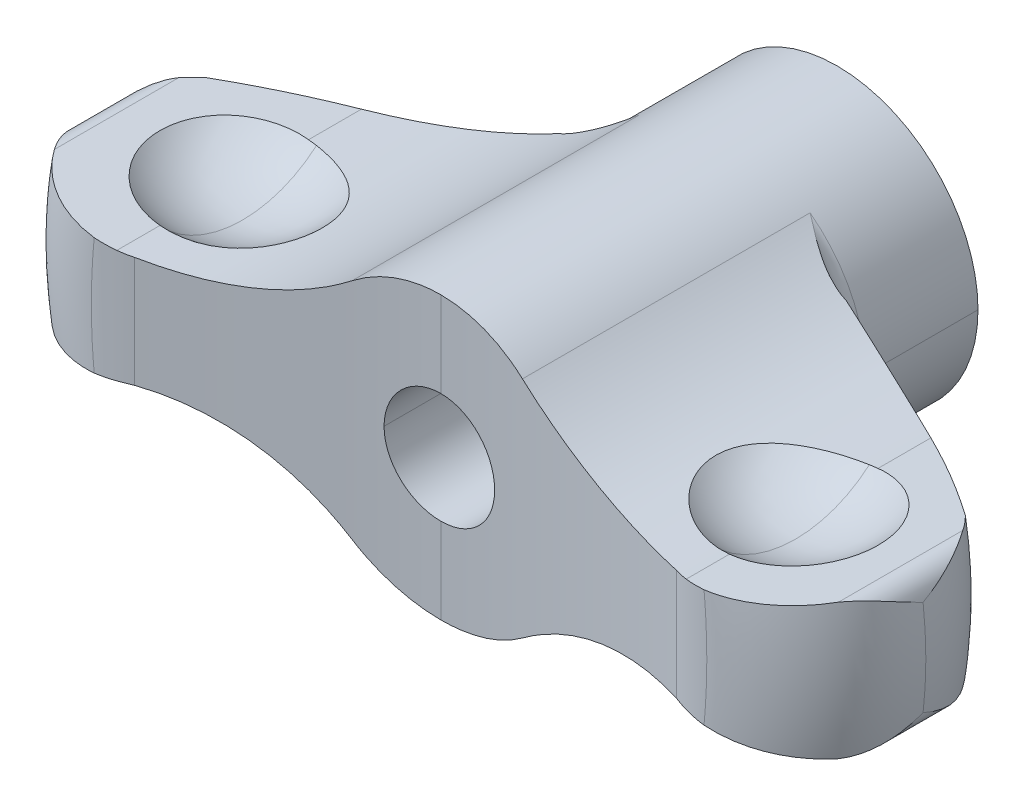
ISO-10303-21;
HEADER;
FILE_DESCRIPTION(('STEP AP214'),'2;1');
FILE_NAME('part.step','',(''),(''),'','','');
FILE_SCHEMA(('AUTOMOTIVE_DESIGN { 1 0 10303 214 1 1 1 1 }'));
ENDSEC;
DATA;
#1=APPLICATION_CONTEXT('core data for automotive mechanical design processes');
#2=APPLICATION_PROTOCOL_DEFINITION('international standard','automotive_design',2000,#1);
#3=PRODUCT_CONTEXT('',#1,'mechanical');
#4=PRODUCT('Part','Part','',(#3));
#5=PRODUCT_RELATED_PRODUCT_CATEGORY('part','',(#4));
#6=PRODUCT_DEFINITION_FORMATION('','',#4);
#7=PRODUCT_DEFINITION_CONTEXT('part definition',#1,'design');
#8=PRODUCT_DEFINITION('design','',#6,#7);
#9=PRODUCT_DEFINITION_SHAPE('','',#8);
#10=(LENGTH_UNIT() NAMED_UNIT(*) SI_UNIT(.MILLI.,.METRE.));
#11=(NAMED_UNIT(*) PLANE_ANGLE_UNIT() SI_UNIT($,.RADIAN.));
#12=(NAMED_UNIT(*) SI_UNIT($,.STERADIAN.) SOLID_ANGLE_UNIT());
#13=UNCERTAINTY_MEASURE_WITH_UNIT(LENGTH_MEASURE(1.E-05),#10,'distance_accuracy_value','');
#14=(GEOMETRIC_REPRESENTATION_CONTEXT(3) GLOBAL_UNCERTAINTY_ASSIGNED_CONTEXT((#13)) GLOBAL_UNIT_ASSIGNED_CONTEXT((#10,
#11,#12)) REPRESENTATION_CONTEXT('',''));
#15=CARTESIAN_POINT('',(0.,0.,0.));
#16=DIRECTION('',(0.,0.,1.));
#17=DIRECTION('',(1.,0.,0.));
#18=AXIS2_PLACEMENT_3D('',#15,#16,#17);
#19=CARTESIAN_POINT('',(13.25,6.75,15.25));
#20=DIRECTION('',(0.,0.,1.));
#21=DIRECTION('',(-1.,0.,0.));
#22=AXIS2_PLACEMENT_3D('',#19,#20,#21);
#23=SPHERICAL_SURFACE('',#22,5.4);
#24=CARTESIAN_POINT('',(13.25,6.75,15.25));
#25=DIRECTION('',(1.,0.,0.));
#26=DIRECTION('',(0.,0.,1.));
#27=AXIS2_PLACEMENT_3D('',#24,#25,#26);
#28=CIRCLE('',#27,5.4);
#29=CARTESIAN_POINT('',(13.25,1.35,15.25));
#30=VERTEX_POINT('',#29);
#31=CARTESIAN_POINT('',(13.25,2.67341046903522,18.7913864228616));
#32=VERTEX_POINT('',#31);
#33=EDGE_CURVE('E395',#30,#32,#28,.F.);
#34=ORIENTED_EDGE('',*,*,#33,.T.);
#35=CARTESIAN_POINT('',(13.6469742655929,2.7092176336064,18.8101248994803));
#36=CARTESIAN_POINT('',(13.5807778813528,2.70226198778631,18.8096097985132));
#37=CARTESIAN_POINT('',(13.5145985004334,2.69580023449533,18.8077907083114));
#38=CARTESIAN_POINT('',(13.3822737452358,2.6838645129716,18.8015445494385));
#39=CARTESIAN_POINT('',(13.3161283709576,2.67839054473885,18.7971174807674));
#40=CARTESIAN_POINT('',(13.25,2.67341046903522,18.7913864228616));
#41=B_SPLINE_CURVE_WITH_KNOTS('',3,(#35,#36,#37,#38,#39,#40),.UNSPECIFIED.,.F.,.F.,(4,2,4),(0.,
0.199556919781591,0.399113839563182),.UNSPECIFIED.);
#42=CARTESIAN_POINT('',(13.6469742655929,2.70921763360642,18.8101248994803));
#43=VERTEX_POINT('',#42);
#44=EDGE_CURVE('E295',#43,#32,#41,.T.);
#45=ORIENTED_EDGE('',*,*,#44,.F.);
#46=CARTESIAN_POINT('',(13.6469742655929,2.70921763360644,18.8101248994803));
#47=CARTESIAN_POINT('',(13.74655729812,2.71968423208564,18.8109101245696));
#48=CARTESIAN_POINT('',(13.8461684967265,2.73015379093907,18.8074517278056));
#49=CARTESIAN_POINT('',(14.0447432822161,2.751024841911,18.7921164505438));
#50=CARTESIAN_POINT('',(14.1437068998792,2.7614263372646,18.7802399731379));
#51=CARTESIAN_POINT('',(14.3402231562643,2.78208102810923,18.7481486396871));
#52=CARTESIAN_POINT('',(14.4377767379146,2.79233432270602,18.7279396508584));
#53=CARTESIAN_POINT('',(14.6308200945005,2.8126239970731,18.6793483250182));
#54=CARTESIAN_POINT('',(14.7263098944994,2.82266037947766,18.650966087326));
#55=CARTESIAN_POINT('',(15.0087595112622,2.8523470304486,18.5537886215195));
#56=CARTESIAN_POINT('',(15.1917827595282,2.87158354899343,18.4729489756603));
#57=CARTESIAN_POINT('',(15.5415956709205,2.90835036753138,18.2815763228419));
#58=CARTESIAN_POINT('',(15.7083885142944,2.92588100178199,18.1710491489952));
#59=CARTESIAN_POINT('',(16.0211856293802,2.95875730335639,17.9233963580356));
#60=CARTESIAN_POINT('',(16.1671894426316,2.97410292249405,17.7862701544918));
#61=CARTESIAN_POINT('',(16.4342444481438,3.00217153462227,17.489298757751));
#62=CARTESIAN_POINT('',(16.5552918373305,3.01489412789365,17.3294501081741));
#63=CARTESIAN_POINT('',(16.7689741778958,3.03735304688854,16.9915931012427));
#64=CARTESIAN_POINT('',(16.8616103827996,3.04708950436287,16.8135855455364));
#65=CARTESIAN_POINT('',(17.0158402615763,3.06329971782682,16.4444707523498));
#66=CARTESIAN_POINT('',(17.0774359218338,3.06977368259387,16.253364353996));
#67=CARTESIAN_POINT('',(17.1678468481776,3.07927625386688,15.8634621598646));
#68=CARTESIAN_POINT('',(17.1966614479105,3.08230479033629,15.6646662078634));
#69=CARTESIAN_POINT('',(17.2206901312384,3.08483030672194,15.2650270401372));
#70=CARTESIAN_POINT('',(17.2159034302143,3.08432720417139,15.0641837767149));
#71=CARTESIAN_POINT('',(17.1728638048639,3.07980355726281,14.6661578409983));
#72=CARTESIAN_POINT('',(17.1346111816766,3.07578304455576,14.4689751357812));
#73=CARTESIAN_POINT('',(17.0257262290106,3.06433877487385,14.0838669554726));
#74=CARTESIAN_POINT('',(16.9550940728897,3.05691503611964,13.8959414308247));
#75=CARTESIAN_POINT('',(16.7834534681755,3.03887488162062,13.5346771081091));
#76=CARTESIAN_POINT('',(16.6824443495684,3.02825839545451,13.3613386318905));
#77=CARTESIAN_POINT('',(16.4529214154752,3.00413456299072,13.0341801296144));
#78=CARTESIAN_POINT('',(16.3244086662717,2.99062732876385,12.8803593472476));
#79=CARTESIAN_POINT('',(16.0435440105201,2.96110726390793,12.5966116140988));
#80=CARTESIAN_POINT('',(15.8911949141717,2.94509472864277,12.4666818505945));
#81=CARTESIAN_POINT('',(15.5669134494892,2.91101137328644,12.2343486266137));
#82=CARTESIAN_POINT('',(15.3949757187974,2.89293998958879,12.1319527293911));
#83=CARTESIAN_POINT('',(15.0363791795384,2.85524997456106,11.9575956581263));
#84=CARTESIAN_POINT('',(14.8497123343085,2.83563049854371,11.8856512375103));
#85=CARTESIAN_POINT('',(14.4671407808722,2.79542060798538,11.7743939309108));
#86=CARTESIAN_POINT('',(14.2712491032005,2.77483156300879,11.7350363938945));
#87=CARTESIAN_POINT('',(14.0028192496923,2.74661844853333,11.7043866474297));
#88=CARTESIAN_POINT('',(13.9317141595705,2.73914500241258,11.6984560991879));
#89=CARTESIAN_POINT('',(13.7894021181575,2.72418740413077,11.6909286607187));
#90=CARTESIAN_POINT('',(13.718195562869,2.71670329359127,11.6893242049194));
#91=CARTESIAN_POINT('',(13.6469742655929,2.70921763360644,11.6898751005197));
#92=B_SPLINE_CURVE_WITH_KNOTS('',3,(#46,#47,#48,#49,#50,#51,#52,#53,#54,#55,#56,#57,#58,#59,#60,
#61,#62,#63,#64,#65,#66,#67,#68,#69,#70,#71,#72,#73,#74,#75,#76,#77,#78,#79,#80,#81,#82,#83,#84,
#85,#86,#87,#88,#89,#90,#91),.UNSPECIFIED.,.F.,.F.,(4,2,2,2,2,2,2,2,2,2,2,2,2,2,2,2,2,2,2,2,2,2,
4),(0.,0.300306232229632,0.600598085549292,0.90067885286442,1.20075597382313,1.80065907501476,
2.40044439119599,3.00024293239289,3.60013280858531,4.19999621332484,4.79982122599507,
5.39965843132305,5.99950964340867,6.59935545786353,7.19919806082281,7.79905389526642,
8.39888647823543,8.99864839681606,9.59857489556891,10.1988310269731,10.7982633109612,
11.013391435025,11.2281430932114),.UNSPECIFIED.);
#93=CARTESIAN_POINT('',(13.6469742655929,2.70921763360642,11.6898751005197));
#94=VERTEX_POINT('',#93);
#95=EDGE_CURVE('E297',#43,#94,#92,.T.);
#96=ORIENTED_EDGE('',*,*,#95,.T.);
#97=CARTESIAN_POINT('',(13.25,2.67341046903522,11.7086135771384));
#98=CARTESIAN_POINT('',(13.3161283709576,2.67839054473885,11.7028825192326));
#99=CARTESIAN_POINT('',(13.3822737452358,2.6838645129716,11.6984554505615));
#100=CARTESIAN_POINT('',(13.5145985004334,2.69580023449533,11.6922092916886));
#101=CARTESIAN_POINT('',(13.5807778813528,2.70226198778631,11.6903902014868));
#102=CARTESIAN_POINT('',(13.6469742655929,2.7092176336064,11.6898751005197));
#103=B_SPLINE_CURVE_WITH_KNOTS('',3,(#97,#98,#99,#100,#101,#102),.UNSPECIFIED.,.F.,.F.,(4,2,4),
(0.,0.199556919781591,0.399113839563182),.UNSPECIFIED.);
#104=CARTESIAN_POINT('',(13.25,2.67341046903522,11.7086135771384));
#105=VERTEX_POINT('',#104);
#106=EDGE_CURVE('E283',#105,#94,#103,.T.);
#107=ORIENTED_EDGE('',*,*,#106,.F.);
#108=CARTESIAN_POINT('',(13.25,6.75,15.25));
#109=DIRECTION('',(1.,0.,0.));
#110=DIRECTION('',(0.,0.,1.));
#111=AXIS2_PLACEMENT_3D('',#108,#109,#110);
#112=CIRCLE('',#111,5.4);
#113=EDGE_CURVE('E304',#105,#30,#112,.F.);
#114=ORIENTED_EDGE('',*,*,#113,.T.);
#115=EDGE_LOOP('',(#34,#45,#96,#107,#114));
#116=FACE_BOUND('',#115,.T.);
#117=ADVANCED_FACE('F15',(#116),#23,.F.);
#118=CARTESIAN_POINT('',(18.7921747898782,2.16666666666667,0.));
#119=DIRECTION('',(0.,0.,-1.));
#120=DIRECTION('',(0.,-1.,0.));
#121=AXIS2_PLACEMENT_3D('',#118,#119,#120);
#122=CYLINDRICAL_SURFACE('',#121,1.08333333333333);
#123=CARTESIAN_POINT('',(18.7921747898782,3.24999999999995,12.7683461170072));
#124=CARTESIAN_POINT('',(18.8135715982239,3.24999640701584,12.7989003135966));
#125=CARTESIAN_POINT('',(18.8347154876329,3.24933763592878,12.8296272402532));
#126=CARTESIAN_POINT('',(18.8772398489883,3.24676485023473,12.8925373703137));
#127=CARTESIAN_POINT('',(18.8986001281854,3.24480529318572,12.9247323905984));
#128=CARTESIAN_POINT('',(18.9414804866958,3.23960687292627,12.9906061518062));
#129=CARTESIAN_POINT('',(18.9629778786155,3.2363238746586,13.0242961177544));
#130=CARTESIAN_POINT('',(19.0060532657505,3.22845012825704,13.0931868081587));
#131=CARTESIAN_POINT('',(19.0276062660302,3.22381652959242,13.1283982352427));
#132=CARTESIAN_POINT('',(19.0707082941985,3.21321405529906,13.2003561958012));
#133=CARTESIAN_POINT('',(19.0922300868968,3.20720366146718,13.2371128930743));
#134=CARTESIAN_POINT('',(19.1351805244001,3.19381975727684,13.3121832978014));
#135=CARTESIAN_POINT('',(19.1565797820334,3.18640604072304,13.3505066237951));
#136=CARTESIAN_POINT('',(19.1991911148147,3.17018797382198,13.4287292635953));
#137=CARTESIAN_POINT('',(19.2203717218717,3.16134471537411,13.4686376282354));
#138=CARTESIAN_POINT('',(19.2624469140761,3.14224046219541,13.5500460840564));
#139=CARTESIAN_POINT('',(19.2833080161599,3.13194183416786,13.5915546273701));
#140=CARTESIAN_POINT('',(19.3246405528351,3.10990052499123,13.6761756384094));
#141=CARTESIAN_POINT('',(19.3450765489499,3.09812146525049,13.719295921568));
#142=CARTESIAN_POINT('',(19.3854504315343,3.07309363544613,13.8071484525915));
#143=CARTESIAN_POINT('',(19.4053509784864,3.05980971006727,13.8518878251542));
#144=CARTESIAN_POINT('',(19.4445408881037,3.03174888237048,13.9429830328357));
#145=CARTESIAN_POINT('',(19.4637910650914,3.01693806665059,13.9893452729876));
#146=CARTESIAN_POINT('',(19.5015621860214,2.98579715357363,14.0836828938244));
#147=CARTESIAN_POINT('',(19.5200421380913,2.96943422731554,14.1316638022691));
#148=CARTESIAN_POINT('',(19.5663126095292,2.92554403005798,14.256700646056));
#149=CARTESIAN_POINT('',(19.593016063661,2.89722239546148,14.3338827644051));
#150=CARTESIAN_POINT('',(19.6452451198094,2.83566369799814,14.4960825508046));
#151=CARTESIAN_POINT('',(19.6704074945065,2.80221611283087,14.5811366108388));
#152=CARTESIAN_POINT('',(19.7184399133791,2.73024644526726,14.7591391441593));
#153=CARTESIAN_POINT('',(19.7409101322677,2.69153722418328,14.8521202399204));
#154=CARTESIAN_POINT('',(19.7756642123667,2.62208726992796,15.0146110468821));
#155=CARTESIAN_POINT('',(19.789085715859,2.59181994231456,15.0840836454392));
#156=CARTESIAN_POINT('',(19.8164605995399,2.52176978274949,15.2429472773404));
#157=CARTESIAN_POINT('',(19.8294805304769,2.48172793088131,15.33238631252));
#158=CARTESIAN_POINT('',(19.8531035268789,2.39168225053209,15.5312015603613));
#159=CARTESIAN_POINT('',(19.8625335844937,2.34143532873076,15.6406084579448));
#160=CARTESIAN_POINT('',(19.8683786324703,2.29074889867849,15.75));
#161=B_SPLINE_CURVE_WITH_KNOTS('',3,(#123,#124,#125,#126,#127,#128,#129,#130,#131,#132,#133,
#134,#135,#136,#137,#138,#139,#140,#141,#142,#143,#144,#145,#146,#147,#148,#149,#150,#151,#152,
#153,#154,#155,#156,#157,#158,#159,#160),.UNSPECIFIED.,.F.,.F.,(4,2,2,2,2,2,2,2,2,2,2,2,2,2,2,2,
2,2,4),(0.,0.111891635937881,0.227923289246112,0.348195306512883,0.472800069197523,
0.601822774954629,0.735342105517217,0.87343079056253,1.01615607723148,1.16358011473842,
1.31576026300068,1.4727493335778,1.63459577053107,1.89380891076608,2.17807275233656,
2.48748871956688,2.71831204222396,3.01475351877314,3.3768163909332),.UNSPECIFIED.);
#162=CARTESIAN_POINT('',(18.7921747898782,3.25,12.7683461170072));
#163=VERTEX_POINT('',#162);
#164=CARTESIAN_POINT('',(19.8683786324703,2.29074889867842,15.75));
#165=VERTEX_POINT('',#164);
#166=EDGE_CURVE('E400',#163,#165,#161,.T.);
#167=ORIENTED_EDGE('',*,*,#166,.F.);
#168=DIRECTION('',(0.,0.,1.));
#169=VECTOR('',#168,1.);
#170=CARTESIAN_POINT('',(18.7921747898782,3.25,0.));
#171=LINE('',#170,#169);
#172=CARTESIAN_POINT('',(18.7921747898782,3.25,18.7316538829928));
#173=VERTEX_POINT('',#172);
#174=EDGE_CURVE('E558',#163,#173,#171,.T.);
#175=ORIENTED_EDGE('',*,*,#174,.T.);
#176=CARTESIAN_POINT('',(19.8683786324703,2.29074889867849,15.75));
#177=CARTESIAN_POINT('',(19.8625340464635,2.34143137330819,15.8593826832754));
#178=CARTESIAN_POINT('',(19.8531050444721,2.39167418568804,15.9687808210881));
#179=CARTESIAN_POINT('',(19.8294841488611,2.48171591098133,16.1675873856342));
#180=CARTESIAN_POINT('',(19.8164646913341,2.52175779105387,16.257026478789));
#181=CARTESIAN_POINT('',(19.7890891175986,2.59181211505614,16.4158989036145));
#182=CARTESIAN_POINT('',(19.7756660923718,2.62208342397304,16.4853802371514));
#183=CARTESIAN_POINT('',(19.7409127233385,2.69153216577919,16.6478675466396));
#184=CARTESIAN_POINT('',(19.7184457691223,2.73023663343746,16.7408364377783));
#185=CARTESIAN_POINT('',(19.6704179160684,2.80220176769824,16.9188270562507));
#186=CARTESIAN_POINT('',(19.6452561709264,2.83564930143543,17.0038813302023));
#187=CARTESIAN_POINT('',(19.593024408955,2.89721302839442,17.1660933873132));
#188=CARTESIAN_POINT('',(19.5663170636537,2.9255393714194,17.2432875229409));
#189=CARTESIAN_POINT('',(19.5200425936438,2.96943406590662,17.3683348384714));
#190=CARTESIAN_POINT('',(19.5015631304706,2.98579699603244,17.4163143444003));
#191=CARTESIAN_POINT('',(19.4637929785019,3.01693784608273,17.5106494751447));
#192=CARTESIAN_POINT('',(19.4445432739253,3.03174859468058,17.5570106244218));
#193=CARTESIAN_POINT('',(19.4053542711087,3.0598093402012,17.6481039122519));
#194=CARTESIAN_POINT('',(19.385454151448,3.07309324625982,17.6928424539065));
#195=CARTESIAN_POINT('',(19.3450810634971,3.09812105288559,17.7806935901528));
#196=CARTESIAN_POINT('',(19.3246454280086,3.10990010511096,17.8238133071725));
#197=CARTESIAN_POINT('',(19.2833135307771,3.13194141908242,17.9084334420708));
#198=CARTESIAN_POINT('',(19.2624527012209,3.14224005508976,17.9499416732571));
#199=CARTESIAN_POINT('',(19.2203779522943,3.16134433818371,18.03134975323));
#200=CARTESIAN_POINT('',(19.1991975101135,3.17018761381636,18.0712580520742));
#201=CARTESIAN_POINT('',(19.1565863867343,3.18640572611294,18.1494807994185));
#202=CARTESIAN_POINT('',(19.1351871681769,3.19381946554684,18.1878042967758));
#203=CARTESIAN_POINT('',(19.0922366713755,3.20720342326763,18.2628752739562));
#204=CARTESIAN_POINT('',(19.0707147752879,3.21321384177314,18.2996323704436));
#205=CARTESIAN_POINT('',(19.0276123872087,3.22381637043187,18.3715913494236));
#206=CARTESIAN_POINT('',(19.0060591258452,3.22844999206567,18.4068033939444));
#207=CARTESIAN_POINT('',(18.9629830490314,3.2363237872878,18.4756955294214));
#208=CARTESIAN_POINT('',(18.9414852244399,3.23960680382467,18.509386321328));
#209=CARTESIAN_POINT('',(18.8986038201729,3.24480526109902,18.5752619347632));
#210=CARTESIAN_POINT('',(18.8772429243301,3.24676482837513,18.6074579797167));
#211=CARTESIAN_POINT('',(18.8347171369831,3.24933763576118,18.6703703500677));
#212=CARTESIAN_POINT('',(18.8135724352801,3.24999640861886,18.7010984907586));
#213=CARTESIAN_POINT('',(18.7921747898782,3.24999999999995,18.7316538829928));
#214=B_SPLINE_CURVE_WITH_KNOTS('',3,(#176,#177,#178,#179,#180,#181,#182,#183,#184,#185,#186,
#187,#188,#189,#190,#191,#192,#193,#194,#195,#196,#197,#198,#199,#200,#201,#202,#203,#204,#205,
#206,#207,#208,#209,#210,#211,#212,#213),.UNSPECIFIED.,.F.,.F.,(4,2,2,2,2,2,2,2,2,2,2,2,2,2,2,2,
2,2,4),(0.,0.362033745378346,0.658475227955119,0.889327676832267,1.19870323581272,
1.4829670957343,1.74222062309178,1.90406282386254,2.06104841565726,2.21322584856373,
2.3606479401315,2.50337205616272,2.6414603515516,2.77498007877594,2.90400397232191,
3.02861071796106,3.14888551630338,3.26492075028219,3.37681676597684),.UNSPECIFIED.);
#215=EDGE_CURVE('E510',#165,#173,#214,.T.);
#216=ORIENTED_EDGE('',*,*,#215,.F.);
#217=EDGE_LOOP('',(#167,#175,#216));
#218=FACE_BOUND('',#217,.T.);
#219=ADVANCED_FACE('F1229',(#218),#122,.T.);
#220=CARTESIAN_POINT('',(-18.7921747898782,2.16666666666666,0.));
#221=DIRECTION('',(0.,0.,-1.));
#222=DIRECTION('',(0.,-1.,0.));
#223=AXIS2_PLACEMENT_3D('',#220,#221,#222);
#224=CYLINDRICAL_SURFACE('',#223,1.08333333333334);
#225=DIRECTION('',(0.,0.,1.));
#226=VECTOR('',#225,1.);
#227=CARTESIAN_POINT('',(-18.7921747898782,3.25,0.));
#228=LINE('',#227,#226);
#229=CARTESIAN_POINT('',(-18.7921747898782,3.25,18.7316538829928));
#230=VERTEX_POINT('',#229);
#231=CARTESIAN_POINT('',(-18.7921747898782,3.25,12.7683461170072));
#232=VERTEX_POINT('',#231);
#233=EDGE_CURVE('E1313',#230,#232,#228,.F.);
#234=ORIENTED_EDGE('',*,*,#233,.T.);
#235=CARTESIAN_POINT('',(-19.868378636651,2.29074886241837,15.75));
#236=CARTESIAN_POINT('',(-19.862534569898,2.34142684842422,15.6406277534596));
#237=CARTESIAN_POINT('',(-19.8531067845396,2.39166508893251,15.5312399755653));
#238=CARTESIAN_POINT('',(-19.8294883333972,2.48170242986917,15.332443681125));
#239=CARTESIAN_POINT('',(-19.816469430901,2.52174438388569,15.2430045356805));
#240=CARTESIAN_POINT('',(-19.7890930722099,2.59180333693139,15.0841217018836));
#241=CARTESIAN_POINT('',(-19.7756682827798,2.62207909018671,15.0146300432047));
#242=CARTESIAN_POINT('',(-19.7409127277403,2.691532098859,14.8521324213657));
#243=CARTESIAN_POINT('',(-19.7184457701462,2.73023661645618,14.7591635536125));
#244=CARTESIAN_POINT('',(-19.6704179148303,2.80220178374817,14.581172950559));
#245=CARTESIAN_POINT('',(-19.6452561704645,2.83564930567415,14.4961186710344));
#246=CARTESIAN_POINT('',(-19.5930244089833,2.89721302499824,14.3339066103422));
#247=CARTESIAN_POINT('',(-19.5663170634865,2.92553937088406,14.2567124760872));
#248=CARTESIAN_POINT('',(-19.5200425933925,2.96943406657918,14.1316651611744));
#249=CARTESIAN_POINT('',(-19.5015631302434,2.98579699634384,14.0836856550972));
#250=CARTESIAN_POINT('',(-19.4637929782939,3.01693784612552,13.9893505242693));
#251=CARTESIAN_POINT('',(-19.4445432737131,3.03174859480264,13.9429893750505));
#252=CARTESIAN_POINT('',(-19.4053542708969,3.0598093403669,13.8518960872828));
#253=CARTESIAN_POINT('',(-19.3854541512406,3.07309324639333,13.8071575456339));
#254=CARTESIAN_POINT('',(-19.3450810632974,3.09812105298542,13.7193064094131));
#255=CARTESIAN_POINT('',(-19.3246454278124,3.10990010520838,13.6761866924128));
#256=CARTESIAN_POINT('',(-19.2833135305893,3.13194141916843,13.5915665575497));
#257=CARTESIAN_POINT('',(-19.262452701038,3.14224005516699,13.5500583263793));
#258=CARTESIAN_POINT('',(-19.2203779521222,3.16134433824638,13.4686502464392));
#259=CARTESIAN_POINT('',(-19.1991975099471,3.17018761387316,13.4287419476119));
#260=CARTESIAN_POINT('',(-19.1565863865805,3.18640572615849,13.3505192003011));
#261=CARTESIAN_POINT('',(-19.1351871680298,3.19381946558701,13.3121957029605));
#262=CARTESIAN_POINT('',(-19.0922366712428,3.20720342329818,13.2371247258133));
#263=CARTESIAN_POINT('',(-19.0707147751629,3.21321384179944,13.2003676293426));
#264=CARTESIAN_POINT('',(-19.0276123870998,3.22381637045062,13.1284086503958));
#265=CARTESIAN_POINT('',(-19.0060591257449,3.22844999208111,13.0931966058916));
#266=CARTESIAN_POINT('',(-18.9629830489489,3.2363237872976,13.0243044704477));
#267=CARTESIAN_POINT('',(-18.9414852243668,3.23960680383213,12.9906136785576));
#268=CARTESIAN_POINT('',(-18.8986038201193,3.24480526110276,12.9247380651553));
#269=CARTESIAN_POINT('',(-18.8772429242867,3.24676482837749,12.8925420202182));
#270=CARTESIAN_POINT('',(-18.8347171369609,3.24933763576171,12.8296296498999));
#271=CARTESIAN_POINT('',(-18.8135724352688,3.24999640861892,12.7989015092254));
#272=CARTESIAN_POINT('',(-18.7921747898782,3.25000000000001,12.7683461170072));
#273=B_SPLINE_CURVE_WITH_KNOTS('',3,(#235,#236,#237,#238,#239,#240,#241,#242,#243,#244,#245,
#246,#247,#248,#249,#250,#251,#252,#253,#254,#255,#256,#257,#258,#259,#260,#261,#262,#263,#264,
#265,#266,#267,#268,#269,#270,#271,#272),.UNSPECIFIED.,.F.,.F.,(4,2,2,2,2,2,2,2,2,2,2,2,2,2,2,2,
2,2,4),(0.,0.361999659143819,0.65844115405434,0.889327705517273,1.19870326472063,
1.48296712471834,1.74222065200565,1.90406285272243,2.0610484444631,2.2132258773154,
2.36064796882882,2.5033720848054,2.64146038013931,2.77498010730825,2.90400400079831,
3.02861074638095,3.14888554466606,3.26492077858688,3.37681679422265),.UNSPECIFIED.);
#274=CARTESIAN_POINT('',(-19.8683786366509,2.29074886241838,15.75));
#275=VERTEX_POINT('',#274);
#276=EDGE_CURVE('E936',#275,#232,#273,.T.);
#277=ORIENTED_EDGE('',*,*,#276,.F.);
#278=CARTESIAN_POINT('',(-18.7921747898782,3.25000000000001,18.7316538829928));
#279=CARTESIAN_POINT('',(-18.813571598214,3.24999640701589,18.7010996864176));
#280=CARTESIAN_POINT('',(-18.8347154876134,3.24933763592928,18.6703727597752));
#281=CARTESIAN_POINT('',(-18.87723984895,3.24676485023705,18.6074626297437));
#282=CARTESIAN_POINT('',(-18.8986001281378,3.24480529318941,18.5752676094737));
#283=CARTESIAN_POINT('',(-18.9414804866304,3.23960687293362,18.5093938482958));
#284=CARTESIAN_POINT('',(-18.9629778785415,3.23632387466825,18.4757038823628));
#285=CARTESIAN_POINT('',(-19.0060532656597,3.22845012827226,18.4068131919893));
#286=CARTESIAN_POINT('',(-19.0276062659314,3.22381652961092,18.3716017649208));
#287=CARTESIAN_POINT('',(-19.070708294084,3.21321405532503,18.2996438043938));
#288=CARTESIAN_POINT('',(-19.0922300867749,3.20720366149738,18.2628871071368));
#289=CARTESIAN_POINT('',(-19.1351805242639,3.19381975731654,18.187816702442));
#290=CARTESIAN_POINT('',(-19.1565797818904,3.18640604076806,18.1494933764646));
#291=CARTESIAN_POINT('',(-19.1991911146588,3.17018797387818,18.0712707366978));
#292=CARTESIAN_POINT('',(-19.2203717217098,3.16134471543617,18.0313623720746));
#293=CARTESIAN_POINT('',(-19.2624469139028,3.14224046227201,17.9499539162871));
#294=CARTESIAN_POINT('',(-19.2833080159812,3.13194183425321,17.9084453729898));
#295=CARTESIAN_POINT('',(-19.3246405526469,3.10990052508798,17.8238243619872));
#296=CARTESIAN_POINT('',(-19.3450765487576,3.09812146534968,17.7807040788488));
#297=CARTESIAN_POINT('',(-19.3854504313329,3.07309363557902,17.6928515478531));
#298=CARTESIAN_POINT('',(-19.40535097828,3.05980971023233,17.6481121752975));
#299=CARTESIAN_POINT('',(-19.4445408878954,3.03174888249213,17.5570169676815));
#300=CARTESIAN_POINT('',(-19.4637910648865,3.01693806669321,17.5106547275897));
#301=CARTESIAN_POINT('',(-19.5015621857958,2.98579715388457,17.4163171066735));
#302=CARTESIAN_POINT('',(-19.5200421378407,2.9694342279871,17.3683361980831));
#303=CARTESIAN_POINT('',(-19.5663126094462,2.92554402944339,17.2432993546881));
#304=CARTESIAN_POINT('',(-19.593016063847,2.89722239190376,17.1661172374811));
#305=CARTESIAN_POINT('',(-19.6452451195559,2.8356637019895,17.0039174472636));
#306=CARTESIAN_POINT('',(-19.6704074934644,2.80221612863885,16.9188633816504));
#307=CARTESIAN_POINT('',(-19.7184399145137,2.73024642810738,16.7408608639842));
#308=CARTESIAN_POINT('',(-19.7409101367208,2.6915371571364,16.6478797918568));
#309=CARTESIAN_POINT('',(-19.7756664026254,2.62208293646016,16.4853786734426));
#310=CARTESIAN_POINT('',(-19.7890896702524,2.59181116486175,16.4158957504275));
#311=CARTESIAN_POINT('',(-19.8164653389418,2.52175637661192,16.2570217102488));
#312=CARTESIAN_POINT('',(-19.8294847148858,2.48171445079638,16.1675826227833));
#313=CARTESIAN_POINT('',(-19.8531052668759,2.39167315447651,15.9687776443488));
#314=CARTESIAN_POINT('',(-19.8625341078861,2.34143080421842,15.8593811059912));
#315=CARTESIAN_POINT('',(-19.868378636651,2.29074886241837,15.75));
#316=B_SPLINE_CURVE_WITH_KNOTS('',3,(#278,#279,#280,#281,#282,#283,#284,#285,#286,#287,#288,
#289,#290,#291,#292,#293,#294,#295,#296,#297,#298,#299,#300,#301,#302,#303,#304,#305,#306,#307,
#308,#309,#310,#311,#312,#313,#314,#315),.UNSPECIFIED.,.F.,.F.,(4,2,2,2,2,2,2,2,2,2,2,2,2,2,2,2,
2,2,4),(0.,0.111891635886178,0.227923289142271,0.348195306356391,0.472800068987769,
0.601822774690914,0.735342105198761,0.87343079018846,1.01615607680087,1.16358011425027,
1.31576026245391,1.47274933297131,1.63459576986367,1.89380891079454,2.17807275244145,
2.48748871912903,2.71834614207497,3.0147876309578,3.37681641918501),.UNSPECIFIED.);
#317=EDGE_CURVE('E908',#230,#275,#316,.T.);
#318=ORIENTED_EDGE('',*,*,#317,.F.);
#319=EDGE_LOOP('',(#234,#277,#318));
#320=FACE_BOUND('',#319,.T.);
#321=ADVANCED_FACE('F1233',(#320),#224,.T.);
#322=CARTESIAN_POINT('',(-13.25,6.75,15.25));
#323=DIRECTION('',(0.,0.,1.));
#324=DIRECTION('',(-1.,0.,0.));
#325=AXIS2_PLACEMENT_3D('',#322,#323,#324);
#326=SPHERICAL_SURFACE('',#325,5.4);
#327=CARTESIAN_POINT('',(-13.6469742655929,2.7092176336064,11.6898751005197));
#328=CARTESIAN_POINT('',(-13.5807778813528,2.70226198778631,11.6903902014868));
#329=CARTESIAN_POINT('',(-13.5145985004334,2.69580023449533,11.6922092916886));
#330=CARTESIAN_POINT('',(-13.3822737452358,2.6838645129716,11.6984554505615));
#331=CARTESIAN_POINT('',(-13.3161283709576,2.67839054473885,11.7028825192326));
#332=CARTESIAN_POINT('',(-13.25,2.67341046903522,11.7086135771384));
#333=B_SPLINE_CURVE_WITH_KNOTS('',3,(#327,#328,#329,#330,#331,#332),.UNSPECIFIED.,.F.,.F.,(4,2,
4),(0.,0.199556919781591,0.399113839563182),.UNSPECIFIED.);
#334=CARTESIAN_POINT('',(-13.6469742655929,2.70921763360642,11.6898751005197));
#335=VERTEX_POINT('',#334);
#336=CARTESIAN_POINT('',(-13.25,2.67341046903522,11.7086135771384));
#337=VERTEX_POINT('',#336);
#338=EDGE_CURVE('E1263',#335,#337,#333,.T.);
#339=ORIENTED_EDGE('',*,*,#338,.F.);
#340=CARTESIAN_POINT('',(-13.6469742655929,2.70921763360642,11.6898751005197));
#341=CARTESIAN_POINT('',(-13.74655729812,2.71968423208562,11.6890898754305));
#342=CARTESIAN_POINT('',(-13.8461684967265,2.73015379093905,11.6925482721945));
#343=CARTESIAN_POINT('',(-14.0447432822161,2.75102484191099,11.7078835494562));
#344=CARTESIAN_POINT('',(-14.1437068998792,2.76142633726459,11.7197600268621));
#345=CARTESIAN_POINT('',(-14.3402231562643,2.78208102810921,11.7518513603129));
#346=CARTESIAN_POINT('',(-14.4377767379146,2.792334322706,11.7720603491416));
#347=CARTESIAN_POINT('',(-14.6308200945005,2.81262399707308,11.8206516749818));
#348=CARTESIAN_POINT('',(-14.7263098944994,2.82266037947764,11.849033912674));
#349=CARTESIAN_POINT('',(-15.0087595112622,2.85234703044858,11.9462113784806));
#350=CARTESIAN_POINT('',(-15.1917827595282,2.87158354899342,12.0270510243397));
#351=CARTESIAN_POINT('',(-15.5415956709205,2.90835036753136,12.2184236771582));
#352=CARTESIAN_POINT('',(-15.7083885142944,2.92588100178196,12.3289508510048));
#353=CARTESIAN_POINT('',(-16.0211856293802,2.95875730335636,12.5766036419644));
#354=CARTESIAN_POINT('',(-16.1671894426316,2.97410292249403,12.7137298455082));
#355=CARTESIAN_POINT('',(-16.4342444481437,3.00217153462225,13.010701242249));
#356=CARTESIAN_POINT('',(-16.5552918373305,3.01489412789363,13.1705498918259));
#357=CARTESIAN_POINT('',(-16.7689741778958,3.03735304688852,13.5084068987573));
#358=CARTESIAN_POINT('',(-16.8616103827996,3.04708950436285,13.6864144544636));
#359=CARTESIAN_POINT('',(-17.0158402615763,3.06329971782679,14.0555292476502));
#360=CARTESIAN_POINT('',(-17.0774359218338,3.06977368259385,14.246635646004));
#361=CARTESIAN_POINT('',(-17.1678468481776,3.07927625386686,14.6365378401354));
#362=CARTESIAN_POINT('',(-17.1966614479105,3.08230479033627,14.8353337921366));
#363=CARTESIAN_POINT('',(-17.2206901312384,3.08483030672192,15.2349729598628));
#364=CARTESIAN_POINT('',(-17.2159034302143,3.08432720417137,15.4358162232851));
#365=CARTESIAN_POINT('',(-17.1728638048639,3.07980355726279,15.8338421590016));
#366=CARTESIAN_POINT('',(-17.1346111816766,3.07578304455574,16.0310248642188));
#367=CARTESIAN_POINT('',(-17.0257262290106,3.06433877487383,16.4161330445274));
#368=CARTESIAN_POINT('',(-16.9550940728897,3.05691503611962,16.6040585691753));
#369=CARTESIAN_POINT('',(-16.7834534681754,3.0388748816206,16.9653228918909));
#370=CARTESIAN_POINT('',(-16.6824443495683,3.02825839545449,17.1386613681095));
#371=CARTESIAN_POINT('',(-16.4529214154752,3.0041345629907,17.4658198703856));
#372=CARTESIAN_POINT('',(-16.3244086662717,2.99062732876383,17.6196406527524));
#373=CARTESIAN_POINT('',(-16.0435440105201,2.96110726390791,17.9033883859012));
#374=CARTESIAN_POINT('',(-15.8911949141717,2.94509472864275,18.0333181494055));
#375=CARTESIAN_POINT('',(-15.5669134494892,2.91101137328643,18.2656513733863));
#376=CARTESIAN_POINT('',(-15.3949757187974,2.89293998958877,18.3680472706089));
#377=CARTESIAN_POINT('',(-15.0363791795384,2.85524997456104,18.5424043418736));
#378=CARTESIAN_POINT('',(-14.8497123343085,2.83563049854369,18.6143487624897));
#379=CARTESIAN_POINT('',(-14.4671407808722,2.79542060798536,18.7256060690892));
#380=CARTESIAN_POINT('',(-14.2712491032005,2.77483156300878,18.7649636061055));
#381=CARTESIAN_POINT('',(-14.0028192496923,2.74661844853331,18.7956133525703));
#382=CARTESIAN_POINT('',(-13.9317141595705,2.73914500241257,18.8015439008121));
#383=CARTESIAN_POINT('',(-13.7894021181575,2.72418740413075,18.8090713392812));
#384=CARTESIAN_POINT('',(-13.718195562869,2.71670329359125,18.8106757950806));
#385=CARTESIAN_POINT('',(-13.6469742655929,2.70921763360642,18.8101248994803));
#386=B_SPLINE_CURVE_WITH_KNOTS('',3,(#340,#341,#342,#343,#344,#345,#346,#347,#348,#349,#350,
#351,#352,#353,#354,#355,#356,#357,#358,#359,#360,#361,#362,#363,#364,#365,#366,#367,#368,#369,
#370,#371,#372,#373,#374,#375,#376,#377,#378,#379,#380,#381,#382,#383,#384,#385),.UNSPECIFIED.,
.F.,.F.,(4,2,2,2,2,2,2,2,2,2,2,2,2,2,2,2,2,2,2,2,2,2,4),(0.,0.30030623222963,0.60059808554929,
0.900678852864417,1.20075597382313,1.80065907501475,2.40044439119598,3.00024293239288,
3.60013280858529,4.19999621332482,4.79982122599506,5.39965843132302,5.99950964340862,
6.5993554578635,7.19919806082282,7.7990538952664,8.39888647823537,8.99864839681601,
9.59857489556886,10.198831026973,10.7982633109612,11.0133914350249,11.2281430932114),.UNSPECIFIED.);
#387=CARTESIAN_POINT('',(-13.6469742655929,2.70921763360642,18.8101248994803));
#388=VERTEX_POINT('',#387);
#389=EDGE_CURVE('E484',#335,#388,#386,.T.);
#390=ORIENTED_EDGE('',*,*,#389,.T.);
#391=CARTESIAN_POINT('',(-13.25,2.67341046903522,18.7913864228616));
#392=CARTESIAN_POINT('',(-13.3161283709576,2.67839054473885,18.7971174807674));
#393=CARTESIAN_POINT('',(-13.3822737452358,2.6838645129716,18.8015445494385));
#394=CARTESIAN_POINT('',(-13.5145985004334,2.69580023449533,18.8077907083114));
#395=CARTESIAN_POINT('',(-13.5807778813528,2.70226198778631,18.8096097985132));
#396=CARTESIAN_POINT('',(-13.6469742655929,2.7092176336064,18.8101248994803));
#397=B_SPLINE_CURVE_WITH_KNOTS('',3,(#391,#392,#393,#394,#395,#396),.UNSPECIFIED.,.F.,.F.,(4,2,
4),(0.,0.199556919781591,0.399113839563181),.UNSPECIFIED.);
#398=CARTESIAN_POINT('',(-13.25,2.67341046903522,18.7913864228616));
#399=VERTEX_POINT('',#398);
#400=EDGE_CURVE('E1266',#399,#388,#397,.T.);
#401=ORIENTED_EDGE('',*,*,#400,.F.);
#402=CARTESIAN_POINT('',(-13.25,6.75,15.25));
#403=DIRECTION('',(1.,0.,0.));
#404=DIRECTION('',(0.,0.,1.));
#405=AXIS2_PLACEMENT_3D('',#402,#403,#404);
#406=CIRCLE('',#405,5.4);
#407=CARTESIAN_POINT('',(-13.25,1.35,15.25));
#408=VERTEX_POINT('',#407);
#409=EDGE_CURVE('E1323',#399,#408,#406,.T.);
#410=ORIENTED_EDGE('',*,*,#409,.T.);
#411=CARTESIAN_POINT('',(-13.25,6.75,15.25));
#412=DIRECTION('',(1.,0.,0.));
#413=DIRECTION('',(0.,0.,1.));
#414=AXIS2_PLACEMENT_3D('',#411,#412,#413);
#415=CIRCLE('',#414,5.4);
#416=EDGE_CURVE('E1319',#408,#337,#415,.T.);
#417=ORIENTED_EDGE('',*,*,#416,.T.);
#418=EDGE_LOOP('',(#339,#390,#401,#410,#417));
#419=FACE_BOUND('',#418,.T.);
#420=ADVANCED_FACE('F1237',(#419),#326,.F.);
#421=CARTESIAN_POINT('',(18.7921747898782,-2.16666666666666,0.));
#422=DIRECTION('',(0.,0.,-1.));
#423=DIRECTION('',(0.,-1.,0.));
#424=AXIS2_PLACEMENT_3D('',#421,#422,#423);
#425=CYLINDRICAL_SURFACE('',#424,1.08333333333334);
#426=CARTESIAN_POINT('',(18.7921747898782,-3.24999999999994,18.7316538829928));
#427=CARTESIAN_POINT('',(18.8135715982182,-3.24999640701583,18.7010996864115));
#428=CARTESIAN_POINT('',(18.8347154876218,-3.24933763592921,18.6703727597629));
#429=CARTESIAN_POINT('',(18.8772398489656,-3.24676485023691,18.6074626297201));
#430=CARTESIAN_POINT('',(18.8986001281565,-3.24480529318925,18.575267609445));
#431=CARTESIAN_POINT('',(18.9414804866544,-3.23960687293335,18.5093938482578));
#432=CARTESIAN_POINT('',(18.9629778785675,-3.23632387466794,18.4757038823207));
#433=CARTESIAN_POINT('',(19.0060532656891,-3.22845012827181,18.4068131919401));
#434=CARTESIAN_POINT('',(19.027606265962,-3.22381652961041,18.3716017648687));
#435=CARTESIAN_POINT('',(19.0707082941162,-3.21321405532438,18.2996438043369));
#436=CARTESIAN_POINT('',(19.0922300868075,-3.20720366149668,18.2628871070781));
#437=CARTESIAN_POINT('',(19.1351805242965,-3.19381975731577,18.1878167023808));
#438=CARTESIAN_POINT('',(19.1565797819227,-3.18640604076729,18.1494933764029));
#439=CARTESIAN_POINT('',(19.1991911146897,-3.17018797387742,18.0712707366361));
#440=CARTESIAN_POINT('',(19.2203717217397,-3.16134471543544,18.0313623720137));
#441=CARTESIAN_POINT('',(19.2624469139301,-3.1422404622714,17.9499539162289));
#442=CARTESIAN_POINT('',(19.283308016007,-3.13194183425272,17.9084453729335));
#443=CARTESIAN_POINT('',(19.3246405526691,-3.10990052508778,17.8238243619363));
#444=CARTESIAN_POINT('',(19.3450765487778,-3.09812146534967,17.7807040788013));
#445=CARTESIAN_POINT('',(19.3854504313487,-3.07309363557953,17.6928515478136));
#446=CARTESIAN_POINT('',(19.4053509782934,-3.05980971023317,17.6481121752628));
#447=CARTESIAN_POINT('',(19.4445408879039,-3.03174888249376,17.5570169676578));
#448=CARTESIAN_POINT('',(19.4637910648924,-3.01693806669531,17.5106547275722));
#449=CARTESIAN_POINT('',(19.5015621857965,-2.98579715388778,17.4163171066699));
#450=CARTESIAN_POINT('',(19.5200421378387,-2.96943422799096,17.3683361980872));
#451=CARTESIAN_POINT('',(19.5663126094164,-2.92554402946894,17.2432993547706));
#452=CARTESIAN_POINT('',(19.5930160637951,-2.89722239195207,17.1661172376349));
#453=CARTESIAN_POINT('',(19.6452451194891,-2.835663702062,17.0039174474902));
#454=CARTESIAN_POINT('',(19.6704074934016,-2.80221612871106,16.9188633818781));
#455=CARTESIAN_POINT('',(19.7184399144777,-2.73024642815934,16.7408608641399));
#456=CARTESIAN_POINT('',(19.7409101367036,-2.69153715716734,16.6478797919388));
#457=CARTESIAN_POINT('',(19.7756664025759,-2.62208293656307,16.4853786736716));
#458=CARTESIAN_POINT('',(19.7890896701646,-2.59181116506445,16.4158957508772));
#459=CARTESIAN_POINT('',(19.8164653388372,-2.52175637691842,16.2570217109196));
#460=CARTESIAN_POINT('',(19.8294847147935,-2.48171445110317,16.1675826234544));
#461=CARTESIAN_POINT('',(19.8531052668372,-2.39167315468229,15.9687776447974));
#462=CARTESIAN_POINT('',(19.8625341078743,-2.34143080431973,15.8593811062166));
#463=CARTESIAN_POINT('',(19.868378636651,-2.29074886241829,15.75));
#464=B_SPLINE_CURVE_WITH_KNOTS('',3,(#426,#427,#428,#429,#430,#431,#432,#433,#434,#435,#436,
#437,#438,#439,#440,#441,#442,#443,#444,#445,#446,#447,#448,#449,#450,#451,#452,#453,#454,#455,
#456,#457,#458,#459,#460,#461,#462,#463),.UNSPECIFIED.,.F.,.F.,(4,2,2,2,2,2,2,2,2,2,2,2,2,2,2,2,
2,2,4),(0.,0.11189163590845,0.227923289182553,0.348195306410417,0.472800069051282,
0.601822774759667,0.73534210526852,0.873430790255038,1.01615607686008,1.16358011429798,
1.31576026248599,1.47274933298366,1.63459576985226,1.89380891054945,2.17807275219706,
2.48748871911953,2.71834614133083,3.01478763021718,3.37681641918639),.UNSPECIFIED.);
#465=CARTESIAN_POINT('',(18.7921747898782,-3.25,18.7316538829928));
#466=VERTEX_POINT('',#465);
#467=CARTESIAN_POINT('',(19.8683786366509,-2.29074886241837,15.75));
#468=VERTEX_POINT('',#467);
#469=EDGE_CURVE('E544',#466,#468,#464,.T.);
#470=ORIENTED_EDGE('',*,*,#469,.F.);
#471=DIRECTION('',(0.,0.,1.));
#472=VECTOR('',#471,1.);
#473=CARTESIAN_POINT('',(18.7921747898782,-3.25,0.));
#474=LINE('',#473,#472);
#475=CARTESIAN_POINT('',(18.7921747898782,-3.25,12.7683461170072));
#476=VERTEX_POINT('',#475);
#477=EDGE_CURVE('E466',#466,#476,#474,.F.);
#478=ORIENTED_EDGE('',*,*,#477,.T.);
#479=CARTESIAN_POINT('',(19.868378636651,-2.29074886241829,15.75));
#480=CARTESIAN_POINT('',(19.8625345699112,-2.34142684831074,15.6406277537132));
#481=CARTESIAN_POINT('',(19.853106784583,-2.39166508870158,15.5312399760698));
#482=CARTESIAN_POINT('',(19.8294883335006,-2.48170242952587,15.3324436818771));
#483=CARTESIAN_POINT('',(19.8164694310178,-2.52174438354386,15.2430045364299));
#484=CARTESIAN_POINT('',(19.7890930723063,-2.59180333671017,15.0841217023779));
#485=CARTESIAN_POINT('',(19.7756682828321,-2.62207909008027,15.0146300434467));
#486=CARTESIAN_POINT('',(19.7409127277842,-2.69153209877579,14.8521324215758));
#487=CARTESIAN_POINT('',(19.7184457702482,-2.73023661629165,14.7591635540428));
#488=CARTESIAN_POINT('',(19.6704179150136,-2.80220178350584,14.5811729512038));
#489=CARTESIAN_POINT('',(19.6452561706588,-2.83564930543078,14.4961186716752));
#490=CARTESIAN_POINT('',(19.5930244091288,-2.8972130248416,14.3339066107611));
#491=CARTESIAN_POINT('',(19.5663170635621,-2.92553937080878,14.2567124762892));
#492=CARTESIAN_POINT('',(19.5200425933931,-2.96943406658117,14.1316651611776));
#493=CARTESIAN_POINT('',(19.5015631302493,-2.98579699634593,14.083685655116));
#494=CARTESIAN_POINT('',(19.4637929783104,-3.01693784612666,13.9893505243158));
#495=CARTESIAN_POINT('',(19.4445432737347,-3.03174859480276,13.9429893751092));
#496=CARTESIAN_POINT('',(19.4053542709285,-3.05980934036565,13.851896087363));
#497=CARTESIAN_POINT('',(19.3854541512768,-3.07309324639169,13.8071575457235));
#498=CARTESIAN_POINT('',(19.3450810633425,-3.09812105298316,13.7193064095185));
#499=CARTESIAN_POINT('',(19.3246454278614,-3.10990010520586,13.6761866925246));
#500=CARTESIAN_POINT('',(19.2833135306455,-3.13194141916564,13.5915665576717));
#501=CARTESIAN_POINT('',(19.2624527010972,-3.14224005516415,13.550058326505));
#502=CARTESIAN_POINT('',(19.2203779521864,-3.16134433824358,13.4686502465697));
#503=CARTESIAN_POINT('',(19.1991975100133,-3.1701876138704,13.4287419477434));
#504=CARTESIAN_POINT('',(19.1565863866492,-3.18640572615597,13.3505192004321));
#505=CARTESIAN_POINT('',(19.1351871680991,-3.19381946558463,13.3121957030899));
#506=CARTESIAN_POINT('',(19.0922366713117,-3.20720342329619,13.2371247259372));
#507=CARTESIAN_POINT('',(19.0707147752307,-3.21321384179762,13.2003676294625));
#508=CARTESIAN_POINT('',(19.0276123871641,-3.22381637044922,13.1284086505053));
#509=CARTESIAN_POINT('',(19.0060591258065,-3.22844999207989,13.0931966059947));
#510=CARTESIAN_POINT('',(18.9629830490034,-3.2363237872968,13.0243044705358));
#511=CARTESIAN_POINT('',(18.9414852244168,-3.23960680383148,12.9906136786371));
#512=CARTESIAN_POINT('',(18.8986038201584,-3.24480526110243,12.9247380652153));
#513=CARTESIAN_POINT('',(18.8772429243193,-3.24676482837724,12.8925420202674));
#514=CARTESIAN_POINT('',(18.8347171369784,-3.24933763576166,12.8296296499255));
#515=CARTESIAN_POINT('',(18.8135724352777,-3.24999640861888,12.798901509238));
#516=CARTESIAN_POINT('',(18.7921747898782,-3.24999999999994,12.7683461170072));
#517=B_SPLINE_CURVE_WITH_KNOTS('',3,(#479,#480,#481,#482,#483,#484,#485,#486,#487,#488,#489,
#490,#491,#492,#493,#494,#495,#496,#497,#498,#499,#500,#501,#502,#503,#504,#505,#506,#507,#508,
#509,#510,#511,#512,#513,#514,#515,#516),.UNSPECIFIED.,.F.,.F.,(4,2,2,2,2,2,2,2,2,2,2,2,2,2,2,2,
2,2,4),(0.,0.361999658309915,0.6584411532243,0.889327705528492,1.19870326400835,
1.48296712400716,1.74222065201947,1.90406285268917,2.06104844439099,2.21322587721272,
2.36064796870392,2.50337208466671,2.64146037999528,2.77498010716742,2.90400400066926,
3.02861074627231,3.14888554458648,3.26492077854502,3.37681679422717),.UNSPECIFIED.);
#518=EDGE_CURVE('E408',#468,#476,#517,.T.);
#519=ORIENTED_EDGE('',*,*,#518,.F.);
#520=EDGE_LOOP('',(#470,#478,#519));
#521=FACE_BOUND('',#520,.T.);
#522=ADVANCED_FACE('F436',(#521),#425,.T.);
#523=CARTESIAN_POINT('',(13.25,-6.75,15.25));
#524=DIRECTION('',(0.,0.,1.));
#525=DIRECTION('',(-1.,0.,0.));
#526=AXIS2_PLACEMENT_3D('',#523,#524,#525);
#527=SPHERICAL_SURFACE('',#526,5.4);
#528=CARTESIAN_POINT('',(13.25,-6.75,15.25));
#529=DIRECTION('',(-1.,0.,0.));
#530=DIRECTION('',(0.,0.,1.));
#531=AXIS2_PLACEMENT_3D('',#528,#529,#530);
#532=CIRCLE('',#531,5.4);
#533=CARTESIAN_POINT('',(13.25,-1.35,15.25));
#534=VERTEX_POINT('',#533);
#535=CARTESIAN_POINT('',(13.25,-2.67341046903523,11.7086135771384));
#536=VERTEX_POINT('',#535);
#537=EDGE_CURVE('E1474',#534,#536,#532,.T.);
#538=ORIENTED_EDGE('',*,*,#537,.T.);
#539=CARTESIAN_POINT('',(13.6469742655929,-2.70921763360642,11.6898751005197));
#540=CARTESIAN_POINT('',(13.5807778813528,-2.70226198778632,11.6903902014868));
#541=CARTESIAN_POINT('',(13.5145985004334,-2.69580023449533,11.6922092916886));
#542=CARTESIAN_POINT('',(13.3822737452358,-2.68386451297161,11.6984554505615));
#543=CARTESIAN_POINT('',(13.3161283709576,-2.67839054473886,11.7028825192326));
#544=CARTESIAN_POINT('',(13.25,-2.67341046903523,11.7086135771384));
#545=B_SPLINE_CURVE_WITH_KNOTS('',3,(#539,#540,#541,#542,#543,#544),.UNSPECIFIED.,.F.,.F.,(4,2,
4),(0.,0.19955691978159,0.399113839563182),.UNSPECIFIED.);
#546=CARTESIAN_POINT('',(13.6469742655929,-2.70921763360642,11.6898751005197));
#547=VERTEX_POINT('',#546);
#548=EDGE_CURVE('E443',#547,#536,#545,.T.);
#549=ORIENTED_EDGE('',*,*,#548,.F.);
#550=CARTESIAN_POINT('',(13.6469742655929,-2.70921763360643,11.6898751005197));
#551=CARTESIAN_POINT('',(13.74655729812,-2.71968423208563,11.6890898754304));
#552=CARTESIAN_POINT('',(13.8461684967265,-2.73015379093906,11.6925482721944));
#553=CARTESIAN_POINT('',(14.0447432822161,-2.751024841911,11.7078835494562));
#554=CARTESIAN_POINT('',(14.1437068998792,-2.7614263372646,11.7197600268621));
#555=CARTESIAN_POINT('',(14.3402231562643,-2.78208102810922,11.7518513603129));
#556=CARTESIAN_POINT('',(14.4377767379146,-2.79233432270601,11.7720603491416));
#557=CARTESIAN_POINT('',(14.6308200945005,-2.81262399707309,11.8206516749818));
#558=CARTESIAN_POINT('',(14.7263098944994,-2.82266037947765,11.849033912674));
#559=CARTESIAN_POINT('',(15.0087595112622,-2.85234703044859,11.9462113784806));
#560=CARTESIAN_POINT('',(15.1917827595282,-2.87158354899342,12.0270510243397));
#561=CARTESIAN_POINT('',(15.5415956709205,-2.90835036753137,12.2184236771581));
#562=CARTESIAN_POINT('',(15.7083885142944,-2.92588100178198,12.3289508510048));
#563=CARTESIAN_POINT('',(16.0211856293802,-2.95875730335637,12.5766036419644));
#564=CARTESIAN_POINT('',(16.1671894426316,-2.97410292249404,12.7137298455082));
#565=CARTESIAN_POINT('',(16.4342444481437,-3.00217153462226,13.010701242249));
#566=CARTESIAN_POINT('',(16.5552918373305,-3.01489412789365,13.1705498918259));
#567=CARTESIAN_POINT('',(16.7689741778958,-3.03735304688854,13.5084068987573));
#568=CARTESIAN_POINT('',(16.8616103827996,-3.04708950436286,13.6864144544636));
#569=CARTESIAN_POINT('',(17.0158402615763,-3.0632997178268,14.0555292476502));
#570=CARTESIAN_POINT('',(17.0774359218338,-3.06977368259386,14.2466356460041));
#571=CARTESIAN_POINT('',(17.1678468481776,-3.07927625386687,14.6365378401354));
#572=CARTESIAN_POINT('',(17.1966614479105,-3.08230479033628,14.8353337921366));
#573=CARTESIAN_POINT('',(17.2206901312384,-3.08483030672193,15.2349729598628));
#574=CARTESIAN_POINT('',(17.2159034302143,-3.08432720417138,15.4358162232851));
#575=CARTESIAN_POINT('',(17.1728638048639,-3.0798035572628,15.8338421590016));
#576=CARTESIAN_POINT('',(17.1346111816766,-3.07578304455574,16.0310248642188));
#577=CARTESIAN_POINT('',(17.0257262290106,-3.06433877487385,16.4161330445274));
#578=CARTESIAN_POINT('',(16.9550940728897,-3.05691503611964,16.6040585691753));
#579=CARTESIAN_POINT('',(16.7834534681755,-3.03887488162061,16.9653228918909));
#580=CARTESIAN_POINT('',(16.6824443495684,-3.0282583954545,17.1386613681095));
#581=CARTESIAN_POINT('',(16.4529214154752,-3.00413456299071,17.4658198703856));
#582=CARTESIAN_POINT('',(16.3244086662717,-2.99062732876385,17.6196406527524));
#583=CARTESIAN_POINT('',(16.0435440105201,-2.96110726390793,17.9033883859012));
#584=CARTESIAN_POINT('',(15.8911949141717,-2.94509472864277,18.0333181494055));
#585=CARTESIAN_POINT('',(15.5669134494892,-2.91101137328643,18.2656513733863));
#586=CARTESIAN_POINT('',(15.3949757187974,-2.89293998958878,18.3680472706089));
#587=CARTESIAN_POINT('',(15.0363791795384,-2.85524997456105,18.5424043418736));
#588=CARTESIAN_POINT('',(14.8497123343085,-2.8356304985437,18.6143487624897));
#589=CARTESIAN_POINT('',(14.4671407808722,-2.79542060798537,18.7256060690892));
#590=CARTESIAN_POINT('',(14.2712491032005,-2.77483156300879,18.7649636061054));
#591=CARTESIAN_POINT('',(14.0028192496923,-2.74661844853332,18.7956133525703));
#592=CARTESIAN_POINT('',(13.9317141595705,-2.73914500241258,18.8015439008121));
#593=CARTESIAN_POINT('',(13.7894021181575,-2.72418740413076,18.8090713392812));
#594=CARTESIAN_POINT('',(13.718195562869,-2.71670329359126,18.8106757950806));
#595=CARTESIAN_POINT('',(13.6469742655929,-2.70921763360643,18.8101248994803));
#596=B_SPLINE_CURVE_WITH_KNOTS('',3,(#550,#551,#552,#553,#554,#555,#556,#557,#558,#559,#560,
#561,#562,#563,#564,#565,#566,#567,#568,#569,#570,#571,#572,#573,#574,#575,#576,#577,#578,#579,
#580,#581,#582,#583,#584,#585,#586,#587,#588,#589,#590,#591,#592,#593,#594,#595),.UNSPECIFIED.,
.F.,.F.,(4,2,2,2,2,2,2,2,2,2,2,2,2,2,2,2,2,2,2,2,2,2,4),(0.,0.300306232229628,0.600598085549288,
0.900678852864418,1.20075597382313,1.80065907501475,2.40044439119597,3.00024293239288,
3.6001328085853,4.19999621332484,4.79982122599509,5.39965843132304,5.99950964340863,
6.59935545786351,7.19919806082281,7.7990538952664,8.39888647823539,8.99864839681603,
9.59857489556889,10.1988310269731,10.7982633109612,11.013391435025,11.2281430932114),.UNSPECIFIED.);
#597=CARTESIAN_POINT('',(13.6469742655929,-2.70921763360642,18.8101248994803));
#598=VERTEX_POINT('',#597);
#599=EDGE_CURVE('E450',#547,#598,#596,.T.);
#600=ORIENTED_EDGE('',*,*,#599,.T.);
#601=CARTESIAN_POINT('',(13.25,-2.67341046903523,18.7913864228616));
#602=CARTESIAN_POINT('',(13.3161283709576,-2.67839054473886,18.7971174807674));
#603=CARTESIAN_POINT('',(13.3822737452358,-2.68386451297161,18.8015445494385));
#604=CARTESIAN_POINT('',(13.5145985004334,-2.69580023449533,18.8077907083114));
#605=CARTESIAN_POINT('',(13.5807778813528,-2.70226198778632,18.8096097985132));
#606=CARTESIAN_POINT('',(13.6469742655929,-2.70921763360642,18.8101248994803));
#607=B_SPLINE_CURVE_WITH_KNOTS('',3,(#601,#602,#603,#604,#605,#606),.UNSPECIFIED.,.F.,.F.,(4,2,
4),(0.,0.199556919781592,0.399113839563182),.UNSPECIFIED.);
#608=CARTESIAN_POINT('',(13.25,-2.67341046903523,18.7913864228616));
#609=VERTEX_POINT('',#608);
#610=EDGE_CURVE('E1258',#609,#598,#607,.T.);
#611=ORIENTED_EDGE('',*,*,#610,.F.);
#612=CARTESIAN_POINT('',(13.25,-6.75,15.25));
#613=DIRECTION('',(-1.,0.,0.));
#614=DIRECTION('',(0.,0.,1.));
#615=AXIS2_PLACEMENT_3D('',#612,#613,#614);
#616=CIRCLE('',#615,5.4);
#617=EDGE_CURVE('E477',#609,#534,#616,.T.);
#618=ORIENTED_EDGE('',*,*,#617,.T.);
#619=EDGE_LOOP('',(#538,#549,#600,#611,#618));
#620=FACE_BOUND('',#619,.T.);
#621=ADVANCED_FACE('F432',(#620),#527,.F.);
#622=CARTESIAN_POINT('',(0.,0.,15.75));
#623=DIRECTION('',(0.,0.,-1.));
#624=DIRECTION('',(0.,-1.,0.));
#625=AXIS2_PLACEMENT_3D('',#622,#623,#624);
#626=TOROIDAL_SURFACE('',#625,14.75,5.25);
#627=CARTESIAN_POINT('',(18.1852949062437,3.18621435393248,12.0376893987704));
#628=CARTESIAN_POINT('',(18.2974428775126,3.1980015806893,12.1502269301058));
#629=CARTESIAN_POINT('',(18.4040901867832,3.20921066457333,12.2673837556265));
#630=CARTESIAN_POINT('',(18.606383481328,3.23047254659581,12.5109359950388));
#631=CARTESIAN_POINT('',(18.7020294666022,3.24052534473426,12.6373314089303));
#632=CARTESIAN_POINT('',(18.7921747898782,3.24999999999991,12.7683461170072));
#633=B_SPLINE_CURVE_WITH_KNOTS('',3,(#627,#628,#629,#630,#631,#632),.UNSPECIFIED.,.F.,.F.,(4,2,
4),(0.,0.476471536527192,0.952943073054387),.UNSPECIFIED.);
#634=CARTESIAN_POINT('',(18.1852949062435,3.18621435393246,12.0376893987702));
#635=VERTEX_POINT('',#634);
#636=EDGE_CURVE('E303',#635,#163,#633,.T.);
#637=ORIENTED_EDGE('',*,*,#636,.T.);
#638=ORIENTED_EDGE('',*,*,#166,.T.);
#639=CARTESIAN_POINT('',(0.,0.,15.75));
#640=DIRECTION('',(0.,0.,-1.));
#641=DIRECTION('',(0.,-1.,0.));
#642=AXIS2_PLACEMENT_3D('',#639,#640,#641);
#643=CIRCLE('',#642,20.);
#644=EDGE_CURVE('E548',#468,#165,#643,.F.);
#645=ORIENTED_EDGE('',*,*,#644,.F.);
#646=ORIENTED_EDGE('',*,*,#518,.T.);
#647=CARTESIAN_POINT('',(18.7921747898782,-3.25,12.7683461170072));
#648=CARTESIAN_POINT('',(18.7020294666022,-3.2405253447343,12.6373314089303));
#649=CARTESIAN_POINT('',(18.606383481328,-3.23047254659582,12.5109359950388));
#650=CARTESIAN_POINT('',(18.4040901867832,-3.20921066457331,12.2673837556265));
#651=CARTESIAN_POINT('',(18.2974428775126,-3.19800158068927,12.1502269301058));
#652=CARTESIAN_POINT('',(18.1852949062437,-3.18621435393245,12.0376893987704));
#653=B_SPLINE_CURVE_WITH_KNOTS('',3,(#647,#648,#649,#650,#651,#652),.UNSPECIFIED.,.F.,.F.,(4,2,
4),(0.,0.476471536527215,0.952943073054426),.UNSPECIFIED.);
#654=CARTESIAN_POINT('',(18.1852949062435,-3.18621435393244,12.0376893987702));
#655=VERTEX_POINT('',#654);
#656=EDGE_CURVE('E459',#476,#655,#653,.T.);
#657=ORIENTED_EDGE('',*,*,#656,.T.);
#658=CARTESIAN_POINT('',(0.,0.,12.0376893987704));
#659=DIRECTION('',(0.,0.,-1.));
#660=DIRECTION('',(0.,-1.,0.));
#661=AXIS2_PLACEMENT_3D('',#658,#659,#660);
#662=CIRCLE('',#661,18.4623106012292);
#663=EDGE_CURVE('E319',#635,#655,#662,.T.);
#664=ORIENTED_EDGE('',*,*,#663,.F.);
#665=EDGE_LOOP('',(#637,#638,#645,#646,#657,#664));
#666=FACE_BOUND('',#665,.T.);
#667=ADVANCED_FACE('F381',(#666),#626,.T.);
#668=CARTESIAN_POINT('',(13.25,6.75,15.25));
#669=DIRECTION('',(0.,0.,1.));
#670=DIRECTION('',(-1.,0.,0.));
#671=AXIS2_PLACEMENT_3D('',#668,#669,#670);
#672=SPHERICAL_SURFACE('',#671,5.4);
#673=CARTESIAN_POINT('',(13.25,2.67341046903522,11.7086135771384));
#674=CARTESIAN_POINT('',(13.1259266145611,2.66404973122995,11.7193756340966));
#675=CARTESIAN_POINT('',(13.002115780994,2.65646079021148,11.7347317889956));
#676=CARTESIAN_POINT('',(12.7557921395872,2.64471976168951,11.7746560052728));
#677=CARTESIAN_POINT('',(12.6332796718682,2.64056855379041,11.7992264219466));
#678=CARTESIAN_POINT('',(12.3898199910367,2.63558927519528,11.8577343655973));
#679=CARTESIAN_POINT('',(12.2688828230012,2.63477689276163,11.8917153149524));
#680=CARTESIAN_POINT('',(12.0300846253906,2.63630195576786,11.9689840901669));
#681=CARTESIAN_POINT('',(11.9122233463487,2.63863914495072,12.0122711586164));
#682=CARTESIAN_POINT('',(11.5640744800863,2.64999557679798,12.1563447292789));
#683=CARTESIAN_POINT('',(11.3395382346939,2.66336480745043,12.2712688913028));
#684=CARTESIAN_POINT('',(10.9149231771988,2.69835375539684,12.538056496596));
#685=CARTESIAN_POINT('',(10.714787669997,2.7199538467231,12.689831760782));
#686=CARTESIAN_POINT('',(10.3864931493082,2.76173363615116,12.9931852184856));
#687=CARTESIAN_POINT('',(10.252061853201,2.7812486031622,13.1380247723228));
#688=CARTESIAN_POINT('',(10.069802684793,2.81002063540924,13.3704435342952));
#689=CARTESIAN_POINT('',(10.0122583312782,2.81953228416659,13.4504844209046));
#690=CARTESIAN_POINT('',(9.90428663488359,2.83801340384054,13.6152718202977));
#691=CARTESIAN_POINT('',(9.85385620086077,2.84698310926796,13.7000162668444));
#692=CARTESIAN_POINT('',(9.76041021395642,2.86407170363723,13.8744057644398));
#693=CARTESIAN_POINT('',(9.71745250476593,2.87218377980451,13.9640825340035));
#694=CARTESIAN_POINT('',(9.64006343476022,2.88711248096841,14.1471045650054));
#695=CARTESIAN_POINT('',(9.60562775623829,2.8939297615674,14.2404479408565));
#696=CARTESIAN_POINT('',(9.54582968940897,2.90594818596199,14.4300595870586));
#697=CARTESIAN_POINT('',(9.52046324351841,2.91115005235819,14.5263265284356));
#698=CARTESIAN_POINT('',(9.47923207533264,2.919683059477,14.7209528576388));
#699=CARTESIAN_POINT('',(9.46336599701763,2.92301446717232,14.8193119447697));
#700=CARTESIAN_POINT('',(9.44277713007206,2.92735296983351,15.0049594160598));
#701=CARTESIAN_POINT('',(9.43692209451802,2.92859589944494,15.0921184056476));
#702=CARTESIAN_POINT('',(9.43282007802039,2.92946582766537,15.2666551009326));
#703=CARTESIAN_POINT('',(9.43457551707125,2.92909231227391,15.3540328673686));
#704=CARTESIAN_POINT('',(9.44567174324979,2.92674352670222,15.5282268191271));
#705=CARTESIAN_POINT('',(9.45500781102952,2.92476925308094,15.6150433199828));
#706=CARTESIAN_POINT('',(9.48112709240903,2.91929809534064,15.7875307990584));
#707=CARTESIAN_POINT('',(9.4979131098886,2.91580063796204,15.8732013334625));
#708=CARTESIAN_POINT('',(9.53770860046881,2.90762253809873,16.0386212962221));
#709=CARTESIAN_POINT('',(9.56037660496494,2.90300753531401,16.1184563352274));
#710=CARTESIAN_POINT('',(9.61196609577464,2.89268134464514,16.2760168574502));
#711=CARTESIAN_POINT('',(9.64088971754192,2.88696978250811,16.3537416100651));
#712=CARTESIAN_POINT('',(9.73656175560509,2.86846834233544,16.5830400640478));
#713=CARTESIAN_POINT('',(9.81224260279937,2.85430492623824,16.7308654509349));
#714=CARTESIAN_POINT('',(9.99057820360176,2.82295568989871,17.0237756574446));
#715=CARTESIAN_POINT('',(10.0947900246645,2.8056252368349,17.1678859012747));
#716=CARTESIAN_POINT('',(10.3232087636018,2.77093805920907,17.4392313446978));
#717=CARTESIAN_POINT('',(10.4474235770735,2.75358132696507,17.5664598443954));
#718=CARTESIAN_POINT('',(10.7310040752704,2.71853408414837,17.8197016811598));
#719=CARTESIAN_POINT('',(10.892856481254,2.70114720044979,17.9429685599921));
#720=CARTESIAN_POINT('',(11.2329297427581,2.67148374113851,18.1652509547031));
#721=CARTESIAN_POINT('',(11.4111654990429,2.65921187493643,18.2642440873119));
#722=CARTESIAN_POINT('',(11.8070460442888,2.64041244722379,18.4506273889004));
#723=CARTESIAN_POINT('',(12.0265999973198,2.63501717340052,18.5340737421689));
#724=CARTESIAN_POINT('',(12.4752120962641,2.63552607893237,18.6684098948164));
#725=CARTESIAN_POINT('',(12.7042587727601,2.64141699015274,18.7193378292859));
#726=CARTESIAN_POINT('',(12.9874819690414,2.65610097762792,18.761965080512));
#727=CARTESIAN_POINT('',(13.0399221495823,2.65912741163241,18.769011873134));
#728=CARTESIAN_POINT('',(13.1448876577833,2.66580224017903,18.7814405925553));
#729=CARTESIAN_POINT('',(13.197412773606,2.66944978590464,18.7868247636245));
#730=CARTESIAN_POINT('',(13.25,2.67341046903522,18.7913864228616));
#731=B_SPLINE_CURVE_WITH_KNOTS('',3,(#673,#674,#675,#676,#677,#678,#679,#680,#681,#682,#683,
#684,#685,#686,#687,#688,#689,#690,#691,#692,#693,#694,#695,#696,#697,#698,#699,#700,#701,#702,
#703,#704,#705,#706,#707,#708,#709,#710,#711,#712,#713,#714,#715,#716,#717,#718,#719,#720,#721,
#722,#723,#724,#725,#726,#727,#728,#729,#730),.UNSPECIFIED.,.F.,.F.,(4,2,2,2,2,2,2,2,2,2,2,2,2,
2,2,2,2,2,2,2,2,2,2,2,2,2,2,2,4),(0.,0.374576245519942,0.749248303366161,1.12567884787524,
1.50207876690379,2.25584206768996,3.0078192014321,3.60085811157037,3.89765808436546,
4.19432869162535,4.49320236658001,4.7919243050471,5.09051242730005,5.3890579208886,
5.65081382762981,5.91265297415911,6.1743292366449,6.43610406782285,6.68517794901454,
6.93433699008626,7.4322652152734,7.96627011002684,8.50048630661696,9.1106822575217,
9.72143878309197,10.4234537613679,11.1246439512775,11.2836227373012,11.4423859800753),.UNSPECIFIED.);
#732=EDGE_CURVE('E291',#105,#32,#731,.T.);
#733=ORIENTED_EDGE('',*,*,#732,.T.);
#734=ORIENTED_EDGE('',*,*,#33,.F.);
#735=ORIENTED_EDGE('',*,*,#113,.F.);
#736=EDGE_LOOP('',(#733,#734,#735));
#737=FACE_BOUND('',#736,.T.);
#738=ADVANCED_FACE('F376',(#737),#672,.F.);
#739=CARTESIAN_POINT('',(18.7921747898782,3.25,0.));
#740=DIRECTION('',(0.104528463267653,-0.994521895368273,0.));
#741=DIRECTION('',(0.994521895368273,0.104528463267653,0.));
#742=AXIS2_PLACEMENT_3D('',#739,#740,#741);
#743=PLANE('',#742);
#744=CARTESIAN_POINT('',(18.7921747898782,3.25,18.7316538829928));
#745=CARTESIAN_POINT('',(18.7085317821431,3.24120876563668,18.8532991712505));
#746=CARTESIAN_POINT('',(18.6197512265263,3.23187755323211,18.9713685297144));
#747=CARTESIAN_POINT('',(18.4326119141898,3.21220841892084,19.1995563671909));
#748=CARTESIAN_POINT('',(18.3342536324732,3.20187054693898,19.3096752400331));
#749=CARTESIAN_POINT('',(18.1287614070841,3.18027244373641,19.5210579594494));
#750=CARTESIAN_POINT('',(18.0216373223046,3.16901324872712,19.622331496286));
#751=CARTESIAN_POINT('',(17.7992918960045,3.14564380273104,19.8154472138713));
#752=CARTESIAN_POINT('',(17.6840707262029,3.13353356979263,19.9072895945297));
#753=CARTESIAN_POINT('',(17.4462889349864,3.10854169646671,20.0809436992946));
#754=CARTESIAN_POINT('',(17.3237245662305,3.0956596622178,20.1627502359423));
#755=CARTESIAN_POINT('',(17.0721388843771,3.0692169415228,20.3157338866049));
#756=CARTESIAN_POINT('',(16.9431150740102,3.05565599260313,20.386906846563));
#757=CARTESIAN_POINT('',(16.6796656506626,3.027966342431,20.5180384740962));
#758=CARTESIAN_POINT('',(16.5452443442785,3.01383809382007,20.5780058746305));
#759=CARTESIAN_POINT('',(16.2718648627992,2.98510475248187,20.6863893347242));
#760=CARTESIAN_POINT('',(16.1329054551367,2.97049953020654,20.7348022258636));
#761=CARTESIAN_POINT('',(15.7690130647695,2.93225289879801,20.8445670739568));
#762=CARTESIAN_POINT('',(15.5413026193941,2.9083195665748,20.8969421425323));
#763=CARTESIAN_POINT('',(15.1963082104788,2.87205919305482,20.9523531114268));
#764=CARTESIAN_POINT('',(15.0807249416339,2.85991090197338,20.9669651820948));
#765=CARTESIAN_POINT('',(14.8488305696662,2.8355378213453,20.9884448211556));
#766=CARTESIAN_POINT('',(14.7325193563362,2.82331302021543,20.9953111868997));
#767=CARTESIAN_POINT('',(14.6160655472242,2.81107323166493,20.9982912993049));
#768=B_SPLINE_CURVE_WITH_KNOTS('',3,(#744,#745,#746,#747,#748,#749,#750,#751,#752,#753,#754,
#755,#756,#757,#758,#759,#760,#761,#762,#763,#764,#765,#766,#767),.UNSPECIFIED.,.F.,.F.,(4,2,2,
2,2,2,2,2,2,2,2,4),(0.,0.443528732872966,0.887035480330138,1.33005009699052,1.77305532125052,
2.21628857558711,2.65969453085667,3.10275346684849,3.54593375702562,4.24815272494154,
4.59934410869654,4.95059001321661),.UNSPECIFIED.);
#769=CARTESIAN_POINT('',(14.6160655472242,2.81107323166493,20.9982912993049));
#770=VERTEX_POINT('',#769);
#771=EDGE_CURVE('E586',#173,#770,#768,.T.);
#772=ORIENTED_EDGE('',*,*,#771,.F.);
#773=ORIENTED_EDGE('',*,*,#174,.F.);
#774=ORIENTED_EDGE('',*,*,#636,.F.);
#775=CARTESIAN_POINT('',(13.6469742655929,2.70921763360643,9.15725009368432));
#776=CARTESIAN_POINT('',(13.8046564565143,2.72579069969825,9.24291682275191));
#777=CARTESIAN_POINT('',(13.9617609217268,2.74230304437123,9.32965873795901));
#778=CARTESIAN_POINT('',(14.2746713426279,2.77519125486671,9.50521184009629));
#779=CARTESIAN_POINT('',(14.4304781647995,2.79156721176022,9.59402146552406));
#780=CARTESIAN_POINT('',(14.7407960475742,2.82418293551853,9.77370506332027));
#781=CARTESIAN_POINT('',(14.8953077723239,2.84042277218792,9.86457787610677));
#782=CARTESIAN_POINT('',(15.2030379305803,2.87276651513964,10.0483843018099));
#783=CARTESIAN_POINT('',(15.3562568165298,2.88887046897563,10.1413171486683));
#784=CARTESIAN_POINT('',(15.6614015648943,2.92094247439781,10.329240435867));
#785=CARTESIAN_POINT('',(15.8133276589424,2.93691055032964,10.424230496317));
#786=CARTESIAN_POINT('',(16.7214362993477,3.03235661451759,11.0006114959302));
#787=CARTESIAN_POINT('',(17.4621478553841,3.11020853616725,11.5067386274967));
#788=CARTESIAN_POINT('',(18.1852949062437,3.18621435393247,12.0376893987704));
#789=B_SPLINE_CURVE_WITH_KNOTS('',3,(#775,#776,#777,#778,#779,#780,#781,#782,#783,#784,#785,
#786,#787,#788),.UNSPECIFIED.,.F.,.F.,(4,2,2,2,2,2,4),(0.,0.540638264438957,1.0808807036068,
1.62082667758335,2.16057512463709,2.70022473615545,5.39995460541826),.UNSPECIFIED.);
#790=CARTESIAN_POINT('',(13.6469742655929,2.70921763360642,9.15725009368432));
#791=VERTEX_POINT('',#790);
#792=EDGE_CURVE('E309',#791,#635,#789,.T.);
#793=ORIENTED_EDGE('',*,*,#792,.F.);
#794=DIRECTION('',(0.,0.,-1.));
#795=VECTOR('',#794,1.);
#796=CARTESIAN_POINT('',(13.6469742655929,2.70921763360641,0.));
#797=LINE('',#796,#795);
#798=EDGE_CURVE('E289',#791,#94,#797,.F.);
#799=ORIENTED_EDGE('',*,*,#798,.T.);
#800=ORIENTED_EDGE('',*,*,#95,.F.);
#801=DIRECTION('',(0.,0.,-1.));
#802=VECTOR('',#801,1.);
#803=CARTESIAN_POINT('',(13.6469742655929,2.70921763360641,0.));
#804=LINE('',#803,#802);
#805=CARTESIAN_POINT('',(13.6469742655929,2.70921763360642,20.8828193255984));
#806=VERTEX_POINT('',#805);
#807=EDGE_CURVE('E317',#43,#806,#804,.F.);
#808=ORIENTED_EDGE('',*,*,#807,.T.);
#809=CARTESIAN_POINT('',(14.75,2.82515030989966,15.7499999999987));
#810=DIRECTION('',(0.104528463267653,-0.994521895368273,0.));
#811=DIRECTION('',(-0.994521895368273,-0.104528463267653,0.));
#812=AXIS2_PLACEMENT_3D('',#809,#810,#811);
#813=ELLIPSE('',#812,5.27891846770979,5.25000000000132);
#814=EDGE_CURVE('E556',#770,#806,#813,.T.);
#815=ORIENTED_EDGE('',*,*,#814,.F.);
#816=EDGE_LOOP('',(#772,#773,#774,#793,#799,#800,#808,#815));
#817=FACE_BOUND('',#816,.T.);
#818=ADVANCED_FACE('F307',(#817),#743,.F.);
#819=CARTESIAN_POINT('',(0.,0.,15.75));
#820=DIRECTION('',(0.,0.,-1.));
#821=DIRECTION('',(0.,-1.,0.));
#822=AXIS2_PLACEMENT_3D('',#819,#820,#821);
#823=TOROIDAL_SURFACE('',#822,14.75,5.25);
#824=CARTESIAN_POINT('',(14.6160655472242,-2.81107323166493,20.9982912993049));
#825=CARTESIAN_POINT('',(14.763590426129,-2.82657872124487,20.9945353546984));
#826=CARTESIAN_POINT('',(14.9109552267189,-2.84206738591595,20.984504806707));
#827=CARTESIAN_POINT('',(15.2043221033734,-2.872901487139,20.9520261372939));
#828=CARTESIAN_POINT('',(15.3503242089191,-2.88824692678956,20.9295782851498));
#829=CARTESIAN_POINT('',(15.6398135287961,-2.91867348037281,20.8724193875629));
#830=CARTESIAN_POINT('',(15.7833026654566,-2.93375479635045,20.8377181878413));
#831=CARTESIAN_POINT('',(16.0668616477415,-2.96355804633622,20.7562924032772));
#832=CARTESIAN_POINT('',(16.2069315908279,-2.97827999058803,20.709568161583));
#833=CARTESIAN_POINT('',(16.4827493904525,-3.00726960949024,20.6043818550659));
#834=CARTESIAN_POINT('',(16.6184943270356,-3.02153697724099,20.5459120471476));
#835=CARTESIAN_POINT('',(16.8846438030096,-3.04951041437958,20.4176394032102));
#836=CARTESIAN_POINT('',(17.015046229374,-3.06321626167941,20.3478321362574));
#837=CARTESIAN_POINT('',(17.2694050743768,-3.08995045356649,20.1974538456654));
#838=CARTESIAN_POINT('',(17.3933674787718,-3.10297942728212,20.1168930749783));
#839=CARTESIAN_POINT('',(17.6340929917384,-3.12828069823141,19.9455350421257));
#840=CARTESIAN_POINT('',(17.7508541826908,-3.14055279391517,19.854735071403));
#841=CARTESIAN_POINT('',(18.0400154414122,-3.17094486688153,19.609485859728));
#842=CARTESIAN_POINT('',(18.2066509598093,-3.18845896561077,19.4480233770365));
#843=CARTESIAN_POINT('',(18.4394519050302,-3.21292733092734,19.190456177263));
#844=CARTESIAN_POINT('',(18.5142060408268,-3.22078430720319,19.1020199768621));
#845=CARTESIAN_POINT('',(18.6577398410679,-3.23587031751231,18.9203492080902));
#846=CARTESIAN_POINT('',(18.7265184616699,-3.24309924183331,18.8271138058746));
#847=CARTESIAN_POINT('',(18.7921747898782,-3.25,18.7316538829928));
#848=B_SPLINE_CURVE_WITH_KNOTS('',3,(#824,#825,#826,#827,#828,#829,#830,#831,#832,#833,#834,
#835,#836,#837,#838,#839,#840,#841,#842,#843,#844,#845,#846,#847),.UNSPECIFIED.,.F.,.F.,(4,2,2,
2,2,2,2,2,2,2,2,4),(0.,0.44502112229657,0.890032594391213,1.33468730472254,1.77932932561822,
2.22426543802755,2.6693758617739,3.11406488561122,3.55887181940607,4.25457096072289,
4.60255247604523,4.95059465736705),.UNSPECIFIED.);
#849=CARTESIAN_POINT('',(14.6160655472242,-2.81107323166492,20.9982912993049));
#850=VERTEX_POINT('',#849);
#851=EDGE_CURVE('E473',#850,#466,#848,.T.);
#852=ORIENTED_EDGE('',*,*,#851,.T.);
#853=ORIENTED_EDGE('',*,*,#469,.T.);
#854=ORIENTED_EDGE('',*,*,#644,.T.);
#855=ORIENTED_EDGE('',*,*,#215,.T.);
#856=ORIENTED_EDGE('',*,*,#771,.T.);
#857=CARTESIAN_POINT('',(14.6160655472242,2.81107323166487,20.9982912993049));
#858=CARTESIAN_POINT('',(14.6272151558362,2.6940674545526,20.9985752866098));
#859=CARTESIAN_POINT('',(14.6376707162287,2.57699544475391,20.9988072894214));
#860=CARTESIAN_POINT('',(14.657179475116,2.34289897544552,20.999189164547));
#861=CARTESIAN_POINT('',(14.666234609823,2.22587467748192,20.9993391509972));
#862=CARTESIAN_POINT('',(14.6829511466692,1.99184211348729,20.9995793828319));
#863=CARTESIAN_POINT('',(14.6906139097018,1.8748339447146,20.9996696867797));
#864=CARTESIAN_POINT('',(14.70455081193,1.64080140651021,20.9998087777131));
#865=CARTESIAN_POINT('',(14.710825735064,1.52377708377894,20.9998575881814));
#866=CARTESIAN_POINT('',(14.7219889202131,1.28967952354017,20.9999287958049));
#867=CARTESIAN_POINT('',(14.7268773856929,1.17260629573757,20.9999511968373));
#868=CARTESIAN_POINT('',(14.735266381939,0.938377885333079,20.9999812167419));
#869=CARTESIAN_POINT('',(14.7387665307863,0.821222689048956,20.9999888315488));
#870=CARTESIAN_POINT('',(14.744374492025,0.586797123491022,20.9999978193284));
#871=CARTESIAN_POINT('',(14.7464813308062,0.469526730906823,20.9999991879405));
#872=CARTESIAN_POINT('',(14.7492948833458,0.234837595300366,20.9999999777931));
#873=CARTESIAN_POINT('',(14.7500000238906,0.117418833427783,20.9999993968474));
#874=CARTESIAN_POINT('',(14.75,0.,21.));
#875=B_SPLINE_CURVE_WITH_KNOTS('',3,(#857,#858,#859,#860,#861,#862,#863,#864,#865,#866,#867,
#868,#869,#870,#871,#872,#873,#874),.UNSPECIFIED.,.F.,.F.,(4,2,2,2,2,2,2,2,4),(0.,
0.352606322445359,0.704720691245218,1.05648903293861,1.4080581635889,1.75957567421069,
2.11118981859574,2.46304940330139,2.81530367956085),.UNSPECIFIED.);
#876=CARTESIAN_POINT('',(14.75,0.,21.));
#877=VERTEX_POINT('',#876);
#878=EDGE_CURVE('E522',#877,#770,#875,.F.);
#879=ORIENTED_EDGE('',*,*,#878,.F.);
#880=CARTESIAN_POINT('',(14.75,0.,21.));
#881=CARTESIAN_POINT('',(14.7500000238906,-0.117418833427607,20.9999993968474));
#882=CARTESIAN_POINT('',(14.7492948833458,-0.234837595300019,20.9999999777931));
#883=CARTESIAN_POINT('',(14.7464813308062,-0.469526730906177,20.9999991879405));
#884=CARTESIAN_POINT('',(14.744374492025,-0.586797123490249,20.9999978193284));
#885=CARTESIAN_POINT('',(14.7387665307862,-0.82122268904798,20.9999888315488));
#886=CARTESIAN_POINT('',(14.735266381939,-0.938377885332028,20.9999812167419));
#887=CARTESIAN_POINT('',(14.7268773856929,-1.17260629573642,20.9999511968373));
#888=CARTESIAN_POINT('',(14.7219889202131,-1.289679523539,20.9999287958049));
#889=CARTESIAN_POINT('',(14.710825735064,-1.52377708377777,20.9998575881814));
#890=CARTESIAN_POINT('',(14.70455081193,-1.64080140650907,20.9998087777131));
#891=CARTESIAN_POINT('',(14.6906139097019,-1.87483394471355,20.9996696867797));
#892=CARTESIAN_POINT('',(14.6829511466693,-1.99184211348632,20.9995793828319));
#893=CARTESIAN_POINT('',(14.666234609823,-2.22587467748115,20.9993391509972));
#894=CARTESIAN_POINT('',(14.657179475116,-2.34289897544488,20.999189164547));
#895=CARTESIAN_POINT('',(14.6376707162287,-2.57699544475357,20.9988072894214));
#896=CARTESIAN_POINT('',(14.6272151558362,-2.69406745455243,20.9985752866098));
#897=CARTESIAN_POINT('',(14.6160655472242,-2.81107323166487,20.9982912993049));
#898=B_SPLINE_CURVE_WITH_KNOTS('',3,(#880,#881,#882,#883,#884,#885,#886,#887,#888,#889,#890,
#891,#892,#893,#894,#895,#896,#897),.UNSPECIFIED.,.F.,.F.,(4,2,2,2,2,2,2,2,4),(0.,
0.352254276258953,0.70411386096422,1.05572800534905,1.40724551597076,1.75881464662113,
2.11058298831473,2.46269735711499,2.81530367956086),.UNSPECIFIED.);
#899=EDGE_CURVE('E533',#850,#877,#898,.F.);
#900=ORIENTED_EDGE('',*,*,#899,.F.);
#901=EDGE_LOOP('',(#852,#853,#854,#855,#856,#879,#900));
#902=FACE_BOUND('',#901,.T.);
#903=ADVANCED_FACE('F491',(#902),#823,.T.);
#904=CARTESIAN_POINT('',(0.,0.,8.14999999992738));
#905=DIRECTION('',(0.,0.,1.));
#906=DIRECTION('',(0.,1.,0.));
#907=AXIS2_PLACEMENT_3D('',#904,#905,#906);
#908=CONICAL_SURFACE('',#907,2.64999999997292,0.785398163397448);
#909=DIRECTION('',(0.707106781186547,0.,-0.707106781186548));
#910=VECTOR('',#909,1.);
#911=CARTESIAN_POINT('',(-498994.5,1.22214367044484E-10,499000.));
#912=LINE('',#911,#910);
#913=CARTESIAN_POINT('',(-2.64999999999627,0.,8.14999999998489));
#914=VERTEX_POINT('',#913);
#915=CARTESIAN_POINT('',(-2.49999999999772,0.,7.99999999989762));
#916=VERTEX_POINT('',#915);
#917=EDGE_CURVE('E599',#914,#916,#912,.T.);
#918=ORIENTED_EDGE('',*,*,#917,.T.);
#919=CARTESIAN_POINT('',(0.,0.,7.99999999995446));
#920=DIRECTION('',(0.,0.,1.));
#921=DIRECTION('',(0.,1.,0.));
#922=AXIS2_PLACEMENT_3D('',#919,#920,#921);
#923=CIRCLE('',#922,2.5);
#924=CARTESIAN_POINT('',(2.49999999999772,0.,7.99999999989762));
#925=VERTEX_POINT('',#924);
#926=EDGE_CURVE('E34',#916,#925,#923,.F.);
#927=ORIENTED_EDGE('',*,*,#926,.T.);
#928=DIRECTION('',(-0.707106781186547,0.,-0.707106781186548));
#929=VECTOR('',#928,1.);
#930=CARTESIAN_POINT('',(498994.5,-1.83321550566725E-10,499000.));
#931=LINE('',#930,#929);
#932=CARTESIAN_POINT('',(2.64999999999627,0.,8.14999999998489));
#933=VERTEX_POINT('',#932);
#934=EDGE_CURVE('E20',#925,#933,#931,.F.);
#935=ORIENTED_EDGE('',*,*,#934,.T.);
#936=CARTESIAN_POINT('',(0.,0.,8.15));
#937=DIRECTION('',(0.,0.,1.));
#938=DIRECTION('',(0.,1.,0.));
#939=AXIS2_PLACEMENT_3D('',#936,#937,#938);
#940=CIRCLE('',#939,2.65);
#941=EDGE_CURVE('E628',#933,#914,#940,.T.);
#942=ORIENTED_EDGE('',*,*,#941,.T.);
#943=EDGE_LOOP('',(#918,#927,#935,#942));
#944=FACE_BOUND('',#943,.T.);
#945=ADVANCED_FACE('F496',(#944),#908,.F.);
#946=CARTESIAN_POINT('',(0.,0.,8.14999999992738));
#947=DIRECTION('',(0.,0.,1.));
#948=DIRECTION('',(0.,1.,0.));
#949=AXIS2_PLACEMENT_3D('',#946,#947,#948);
#950=CONICAL_SURFACE('',#949,2.64999999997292,0.785398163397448);
#951=ORIENTED_EDGE('',*,*,#934,.F.);
#952=CARTESIAN_POINT('',(0.,0.,7.99999999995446));
#953=DIRECTION('',(0.,0.,1.));
#954=DIRECTION('',(0.,1.,0.));
#955=AXIS2_PLACEMENT_3D('',#952,#953,#954);
#956=CIRCLE('',#955,2.5);
#957=EDGE_CURVE('E1220',#925,#916,#956,.F.);
#958=ORIENTED_EDGE('',*,*,#957,.T.);
#959=ORIENTED_EDGE('',*,*,#917,.F.);
#960=CARTESIAN_POINT('',(0.,0.,8.15));
#961=DIRECTION('',(0.,0.,1.));
#962=DIRECTION('',(0.,1.,0.));
#963=AXIS2_PLACEMENT_3D('',#960,#961,#962);
#964=CIRCLE('',#963,2.65);
#965=EDGE_CURVE('E631',#914,#933,#964,.T.);
#966=ORIENTED_EDGE('',*,*,#965,.T.);
#967=EDGE_LOOP('',(#951,#958,#959,#966));
#968=FACE_BOUND('',#967,.T.);
#969=ADVANCED_FACE('F615',(#968),#950,.F.);
#970=CARTESIAN_POINT('',(-13.25,-6.75,15.25));
#971=DIRECTION('',(0.,0.,1.));
#972=DIRECTION('',(-1.,0.,0.));
#973=AXIS2_PLACEMENT_3D('',#970,#971,#972);
#974=SPHERICAL_SURFACE('',#973,5.4);
#975=CARTESIAN_POINT('',(-13.6469742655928,-2.7092176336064,18.8101248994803));
#976=CARTESIAN_POINT('',(-13.5807778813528,-2.70226198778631,18.8096097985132));
#977=CARTESIAN_POINT('',(-13.5145985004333,-2.69580023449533,18.8077907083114));
#978=CARTESIAN_POINT('',(-13.3822737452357,-2.68386451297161,18.8015445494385));
#979=CARTESIAN_POINT('',(-13.3161283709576,-2.67839054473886,18.7971174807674));
#980=CARTESIAN_POINT('',(-13.25,-2.67341046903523,18.7913864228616));
#981=B_SPLINE_CURVE_WITH_KNOTS('',3,(#975,#976,#977,#978,#979,#980),.UNSPECIFIED.,.F.,.F.,(4,2,
4),(0.,0.199556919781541,0.399113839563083),.UNSPECIFIED.);
#982=CARTESIAN_POINT('',(-13.6469742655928,-2.70921763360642,18.8101248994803));
#983=VERTEX_POINT('',#982);
#984=CARTESIAN_POINT('',(-13.25,-2.67341046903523,18.7913864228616));
#985=VERTEX_POINT('',#984);
#986=EDGE_CURVE('E598',#983,#985,#981,.T.);
#987=ORIENTED_EDGE('',*,*,#986,.F.);
#988=CARTESIAN_POINT('',(-13.6469742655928,-2.70921763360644,18.8101248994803));
#989=CARTESIAN_POINT('',(-13.7465572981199,-2.71968423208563,18.8109101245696));
#990=CARTESIAN_POINT('',(-13.8461684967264,-2.73015379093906,18.8074517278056));
#991=CARTESIAN_POINT('',(-14.044743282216,-2.75102484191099,18.7921164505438));
#992=CARTESIAN_POINT('',(-14.1437068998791,-2.76142633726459,18.780239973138));
#993=CARTESIAN_POINT('',(-14.3402231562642,-2.78208102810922,18.7481486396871));
#994=CARTESIAN_POINT('',(-14.4377767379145,-2.79233432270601,18.7279396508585));
#995=CARTESIAN_POINT('',(-14.6308200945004,-2.81262399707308,18.6793483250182));
#996=CARTESIAN_POINT('',(-14.7263098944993,-2.82266037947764,18.6509660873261));
#997=CARTESIAN_POINT('',(-15.0087595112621,-2.85234703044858,18.5537886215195));
#998=CARTESIAN_POINT('',(-15.1917827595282,-2.87158354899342,18.4729489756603));
#999=CARTESIAN_POINT('',(-15.5415956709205,-2.90835036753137,18.2815763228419));
#1000=CARTESIAN_POINT('',(-15.7083885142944,-2.92588100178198,18.1710491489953));
#1001=CARTESIAN_POINT('',(-16.0211856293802,-2.95875730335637,17.9233963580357));
#1002=CARTESIAN_POINT('',(-16.1671894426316,-2.97410292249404,17.7862701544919));
#1003=CARTESIAN_POINT('',(-16.4342444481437,-3.00217153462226,17.4892987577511));
#1004=CARTESIAN_POINT('',(-16.5552918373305,-3.01489412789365,17.3294501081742));
#1005=CARTESIAN_POINT('',(-16.7689741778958,-3.03735304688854,16.9915931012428));
#1006=CARTESIAN_POINT('',(-16.8616103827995,-3.04708950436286,16.8135855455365));
#1007=CARTESIAN_POINT('',(-17.0158402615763,-3.06329971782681,16.4444707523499));
#1008=CARTESIAN_POINT('',(-17.0774359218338,-3.06977368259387,16.2533643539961));
#1009=CARTESIAN_POINT('',(-17.1678468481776,-3.07927625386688,15.8634621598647));
#1010=CARTESIAN_POINT('',(-17.1966614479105,-3.08230479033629,15.6646662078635));
#1011=CARTESIAN_POINT('',(-17.2206901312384,-3.08483030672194,15.2650270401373));
#1012=CARTESIAN_POINT('',(-17.2159034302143,-3.08432720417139,15.064183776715));
#1013=CARTESIAN_POINT('',(-17.1728638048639,-3.07980355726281,14.6661578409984));
#1014=CARTESIAN_POINT('',(-17.1346111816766,-3.07578304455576,14.4689751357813));
#1015=CARTESIAN_POINT('',(-17.0257262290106,-3.06433877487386,14.0838669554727));
#1016=CARTESIAN_POINT('',(-16.9550940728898,-3.05691503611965,13.8959414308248));
#1017=CARTESIAN_POINT('',(-16.7834534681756,-3.03887488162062,13.5346771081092));
#1018=CARTESIAN_POINT('',(-16.6824443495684,-3.02825839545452,13.3613386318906));
#1019=CARTESIAN_POINT('',(-16.4529214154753,-3.00413456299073,13.0341801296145));
#1020=CARTESIAN_POINT('',(-16.3244086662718,-2.99062732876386,12.8803593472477));
#1021=CARTESIAN_POINT('',(-16.0435440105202,-2.96110726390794,12.5966116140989));
#1022=CARTESIAN_POINT('',(-15.8911949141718,-2.94509472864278,12.4666818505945));
#1023=CARTESIAN_POINT('',(-15.5669134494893,-2.91101137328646,12.2343486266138));
#1024=CARTESIAN_POINT('',(-15.3949757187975,-2.8929399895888,12.1319527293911));
#1025=CARTESIAN_POINT('',(-15.0363791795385,-2.85524997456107,11.9575956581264));
#1026=CARTESIAN_POINT('',(-14.8497123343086,-2.83563049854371,11.8856512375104));
#1027=CARTESIAN_POINT('',(-14.4671407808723,-2.79542060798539,11.7743939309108));
#1028=CARTESIAN_POINT('',(-14.2712491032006,-2.77483156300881,11.7350363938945));
#1029=CARTESIAN_POINT('',(-14.0028192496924,-2.74661844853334,11.7043866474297));
#1030=CARTESIAN_POINT('',(-13.9317141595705,-2.73914500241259,11.6984560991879));
#1031=CARTESIAN_POINT('',(-13.7894021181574,-2.72418740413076,11.6909286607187));
#1032=CARTESIAN_POINT('',(-13.7181955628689,-2.71670329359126,11.6893242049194));
#1033=CARTESIAN_POINT('',(-13.6469742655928,-2.70921763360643,11.6898751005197));
#1034=B_SPLINE_CURVE_WITH_KNOTS('',3,(#988,#989,#990,#991,#992,#993,#994,#995,#996,#997,#998,
#999,#1000,#1001,#1002,#1003,#1004,#1005,#1006,#1007,#1008,#1009,#1010,#1011,#1012,#1013,#1014,
#1015,#1016,#1017,#1018,#1019,#1020,#1021,#1022,#1023,#1024,#1025,#1026,#1027,#1028,#1029,#1030,
#1031,#1032,#1033),.UNSPECIFIED.,.F.,.F.,(4,2,2,2,2,2,2,2,2,2,2,2,2,2,2,2,2,2,2,2,2,2,4),(0.,
0.300306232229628,0.600598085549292,0.900678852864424,1.20075597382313,1.80065907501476,
2.40044439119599,3.00024293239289,3.60013280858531,4.19999621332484,4.79982122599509,
5.39965843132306,5.99950964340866,6.59935545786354,7.19919806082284,7.79905389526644,
8.39888647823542,8.99864839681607,9.59857489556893,10.1988310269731,10.7982633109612,
11.0133914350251,11.2281430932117),.UNSPECIFIED.);
#1035=CARTESIAN_POINT('',(-13.6469742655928,-2.70921763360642,11.6898751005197));
#1036=VERTEX_POINT('',#1035);
#1037=EDGE_CURVE('E943',#983,#1036,#1034,.T.);
#1038=ORIENTED_EDGE('',*,*,#1037,.T.);
#1039=CARTESIAN_POINT('',(-13.25,-2.67341046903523,11.7086135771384));
#1040=CARTESIAN_POINT('',(-13.3161283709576,-2.67839054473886,11.7028825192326));
#1041=CARTESIAN_POINT('',(-13.3822737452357,-2.68386451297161,11.6984554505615));
#1042=CARTESIAN_POINT('',(-13.5145985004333,-2.69580023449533,11.6922092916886));
#1043=CARTESIAN_POINT('',(-13.5807778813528,-2.70226198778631,11.6903902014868));
#1044=CARTESIAN_POINT('',(-13.6469742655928,-2.7092176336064,11.6898751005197));
#1045=B_SPLINE_CURVE_WITH_KNOTS('',3,(#1039,#1040,#1041,#1042,#1043,#1044),.UNSPECIFIED.,.F.,
.F.,(4,2,4),(0.,0.19955691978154,0.399113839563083),.UNSPECIFIED.);
#1046=CARTESIAN_POINT('',(-13.25,-2.67341046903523,11.7086135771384));
#1047=VERTEX_POINT('',#1046);
#1048=EDGE_CURVE('E589',#1047,#1036,#1045,.T.);
#1049=ORIENTED_EDGE('',*,*,#1048,.F.);
#1050=CARTESIAN_POINT('',(-13.25,-6.75,15.25));
#1051=DIRECTION('',(-1.,0.,0.));
#1052=DIRECTION('',(0.,0.,1.));
#1053=AXIS2_PLACEMENT_3D('',#1050,#1051,#1052);
#1054=CIRCLE('',#1053,5.4);
#1055=CARTESIAN_POINT('',(-13.25,-1.35,15.25));
#1056=VERTEX_POINT('',#1055);
#1057=EDGE_CURVE('E1344',#1047,#1056,#1054,.F.);
#1058=ORIENTED_EDGE('',*,*,#1057,.T.);
#1059=CARTESIAN_POINT('',(-13.25,-6.75,15.25));
#1060=DIRECTION('',(-1.,0.,0.));
#1061=DIRECTION('',(0.,0.,1.));
#1062=AXIS2_PLACEMENT_3D('',#1059,#1060,#1061);
#1063=CIRCLE('',#1062,5.4);
#1064=EDGE_CURVE('E961',#1056,#985,#1063,.F.);
#1065=ORIENTED_EDGE('',*,*,#1064,.T.);
#1066=EDGE_LOOP('',(#987,#1038,#1049,#1058,#1065));
#1067=FACE_BOUND('',#1066,.T.);
#1068=ADVANCED_FACE('F609',(#1067),#974,.F.);
#1069=CARTESIAN_POINT('',(-18.7921747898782,-2.16666666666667,0.));
#1070=DIRECTION('',(0.,0.,-1.));
#1071=DIRECTION('',(0.,-1.,0.));
#1072=AXIS2_PLACEMENT_3D('',#1069,#1070,#1071);
#1073=CYLINDRICAL_SURFACE('',#1072,1.08333333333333);
#1074=CARTESIAN_POINT('',(-18.7921747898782,-3.24999999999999,12.7683461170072));
#1075=CARTESIAN_POINT('',(-18.813571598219,-3.24999640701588,12.7989003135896));
#1076=CARTESIAN_POINT('',(-18.8347154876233,-3.24933763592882,12.8296272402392));
#1077=CARTESIAN_POINT('',(-18.8772398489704,-3.2467648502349,12.8925373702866));
#1078=CARTESIAN_POINT('',(-18.8986001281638,-3.24480529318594,12.9247323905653));
#1079=CARTESIAN_POINT('',(-18.9414804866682,-3.23960687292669,12.9906061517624));
#1080=CARTESIAN_POINT('',(-18.9629778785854,-3.23632387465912,13.0242961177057));
#1081=CARTESIAN_POINT('',(-19.0060532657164,-3.22845012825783,13.0931868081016));
#1082=CARTESIAN_POINT('',(-19.0276062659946,-3.22381652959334,13.128398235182));
#1083=CARTESIAN_POINT('',(-19.0707082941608,-3.21321405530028,13.2003561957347));
#1084=CARTESIAN_POINT('',(-19.0922300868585,-3.20720366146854,13.2371128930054));
#1085=CARTESIAN_POINT('',(-19.1351805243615,-3.19381975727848,13.3121832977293));
#1086=CARTESIAN_POINT('',(-19.1565797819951,-3.1864060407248,13.3505066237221));
#1087=CARTESIAN_POINT('',(-19.1991911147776,-3.17018797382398,13.4287292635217));
#1088=CARTESIAN_POINT('',(-19.2203717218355,-3.1613447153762,13.4686376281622));
#1089=CARTESIAN_POINT('',(-19.2624469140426,-3.14224046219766,13.5500460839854));
#1090=CARTESIAN_POINT('',(-19.283308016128,-3.13194183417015,13.591554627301));
#1091=CARTESIAN_POINT('',(-19.324640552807,-3.10990052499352,13.6761756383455));
#1092=CARTESIAN_POINT('',(-19.3450765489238,-3.09812146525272,13.7192959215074));
#1093=CARTESIAN_POINT('',(-19.3854504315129,-3.07309363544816,13.8071484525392));
#1094=CARTESIAN_POINT('',(-19.4053509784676,-3.05980971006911,13.8518878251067));
#1095=CARTESIAN_POINT('',(-19.4445408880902,-3.03174888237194,13.9429830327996));
#1096=CARTESIAN_POINT('',(-19.4637910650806,-3.01693806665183,13.989345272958));
#1097=CARTESIAN_POINT('',(-19.5015621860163,-2.9857971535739,14.0836828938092));
#1098=CARTESIAN_POINT('',(-19.5200421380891,-2.96943422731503,14.1316638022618));
#1099=CARTESIAN_POINT('',(-19.5663126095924,-2.9255440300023,14.2567006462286));
#1100=CARTESIAN_POINT('',(-19.5930160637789,-2.89722239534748,14.3338827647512));
#1101=CARTESIAN_POINT('',(-19.6452451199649,-2.83566369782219,14.4960825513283));
#1102=CARTESIAN_POINT('',(-19.6704074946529,-2.80221611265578,14.5811366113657));
#1103=CARTESIAN_POINT('',(-19.7184399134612,-2.7302464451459,14.7591391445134));
#1104=CARTESIAN_POINT('',(-19.7409101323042,-2.69153722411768,14.8521202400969));
#1105=CARTESIAN_POINT('',(-19.7756642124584,-2.62208726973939,15.0146110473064));
#1106=CARTESIAN_POINT('',(-19.7890857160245,-2.59181994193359,15.0840836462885));
#1107=CARTESIAN_POINT('',(-19.8164605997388,-2.52176978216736,15.2429472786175));
#1108=CARTESIAN_POINT('',(-19.8294805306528,-2.48172793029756,15.3323863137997));
#1109=CARTESIAN_POINT('',(-19.8531035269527,-2.39168225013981,15.5312015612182));
#1110=CARTESIAN_POINT('',(-19.8625335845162,-2.34143532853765,15.6406084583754));
#1111=CARTESIAN_POINT('',(-19.8683786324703,-2.29074889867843,15.75));
#1112=B_SPLINE_CURVE_WITH_KNOTS('',3,(#1074,#1075,#1076,#1077,#1078,#1079,#1080,#1081,#1082,
#1083,#1084,#1085,#1086,#1087,#1088,#1089,#1090,#1091,#1092,#1093,#1094,#1095,#1096,#1097,#1098,
#1099,#1100,#1101,#1102,#1103,#1104,#1105,#1106,#1107,#1108,#1109,#1110,#1111),.UNSPECIFIED.,
.F.,.F.,(4,2,2,2,2,2,2,2,2,2,2,2,2,2,2,2,2,2,4),(0.,0.111891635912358,0.227923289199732,
0.34819530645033,0.472800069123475,0.601822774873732,0.735342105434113,0.873430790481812,
1.01615607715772,1.16358011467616,1.31576026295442,1.47274933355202,1.6345957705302,
1.89380891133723,2.17807275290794,2.48748871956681,2.71831204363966,3.01475352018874,
3.37681639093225),.UNSPECIFIED.);
#1113=CARTESIAN_POINT('',(-18.7921747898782,-3.25,12.7683461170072));
#1114=VERTEX_POINT('',#1113);
#1115=CARTESIAN_POINT('',(-19.8683786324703,-2.29074889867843,15.75));
#1116=VERTEX_POINT('',#1115);
#1117=EDGE_CURVE('E928',#1114,#1116,#1112,.T.);
#1118=ORIENTED_EDGE('',*,*,#1117,.F.);
#1119=DIRECTION('',(0.,0.,1.));
#1120=VECTOR('',#1119,1.);
#1121=CARTESIAN_POINT('',(-18.7921747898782,-3.25,0.));
#1122=LINE('',#1121,#1120);
#1123=CARTESIAN_POINT('',(-18.7921747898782,-3.25,18.7316538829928));
#1124=VERTEX_POINT('',#1123);
#1125=EDGE_CURVE('E931',#1114,#1124,#1122,.T.);
#1126=ORIENTED_EDGE('',*,*,#1125,.T.);
#1127=CARTESIAN_POINT('',(-19.8683786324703,-2.29074889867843,15.75));
#1128=CARTESIAN_POINT('',(-19.8625340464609,-2.34143137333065,15.859382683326));
#1129=CARTESIAN_POINT('',(-19.8531050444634,-2.39167418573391,15.9687808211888));
#1130=CARTESIAN_POINT('',(-19.8294841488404,-2.48171591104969,16.1675873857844));
#1131=CARTESIAN_POINT('',(-19.8164646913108,-2.52175779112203,16.2570264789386));
#1132=CARTESIAN_POINT('',(-19.7890891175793,-2.59181211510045,16.4158989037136));
#1133=CARTESIAN_POINT('',(-19.7756660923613,-2.62208342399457,16.4853802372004));
#1134=CARTESIAN_POINT('',(-19.7409127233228,-2.69153216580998,16.6478675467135));
#1135=CARTESIAN_POINT('',(-19.7184457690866,-2.73023663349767,16.7408364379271));
#1136=CARTESIAN_POINT('',(-19.6704179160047,-2.80220176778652,16.9188270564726));
#1137=CARTESIAN_POINT('',(-19.6452561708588,-2.83564930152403,17.0038813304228));
#1138=CARTESIAN_POINT('',(-19.5930244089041,-2.89721302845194,17.1660933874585));
#1139=CARTESIAN_POINT('',(-19.5663170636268,-2.92553937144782,17.2432875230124));
#1140=CARTESIAN_POINT('',(-19.5200425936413,-2.96943406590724,17.3683348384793));
#1141=CARTESIAN_POINT('',(-19.5015631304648,-2.98579699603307,17.4163143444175));
#1142=CARTESIAN_POINT('',(-19.4637929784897,-3.01693784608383,17.5106494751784));
#1143=CARTESIAN_POINT('',(-19.44454327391,-3.03174859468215,17.5570106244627));
#1144=CARTESIAN_POINT('',(-19.4053542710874,-3.05980934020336,17.6481039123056));
#1145=CARTESIAN_POINT('',(-19.3854541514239,-3.07309324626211,17.6928424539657));
#1146=CARTESIAN_POINT('',(-19.3450810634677,-3.09812105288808,17.7806935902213));
#1147=CARTESIAN_POINT('',(-19.3246454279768,-3.10990010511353,17.8238133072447));
#1148=CARTESIAN_POINT('',(-19.2833135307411,-3.13194141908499,17.9084334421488));
#1149=CARTESIAN_POINT('',(-19.262452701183,-3.14224005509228,17.9499416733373));
#1150=CARTESIAN_POINT('',(-19.2203779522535,-3.16134433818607,18.0313497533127));
#1151=CARTESIAN_POINT('',(-19.1991975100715,-3.17018761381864,18.0712580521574));
#1152=CARTESIAN_POINT('',(-19.156586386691,-3.18640572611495,18.149480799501));
#1153=CARTESIAN_POINT('',(-19.1351871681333,-3.19381946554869,18.1878042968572));
#1154=CARTESIAN_POINT('',(-19.0922366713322,-3.20720342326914,18.262875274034));
#1155=CARTESIAN_POINT('',(-19.0707147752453,-3.2132138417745,18.2996323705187));
#1156=CARTESIAN_POINT('',(-19.0276123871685,-3.2238163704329,18.3715913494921));
#1157=CARTESIAN_POINT('',(-19.0060591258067,-3.22844999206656,18.4068033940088));
#1158=CARTESIAN_POINT('',(-18.9629830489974,-3.23632378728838,18.4756955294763));
#1159=CARTESIAN_POINT('',(-18.9414852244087,-3.23960680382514,18.5093863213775));
#1160=CARTESIAN_POINT('',(-18.8986038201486,-3.24480526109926,18.5752619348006));
#1161=CARTESIAN_POINT('',(-18.8772429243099,-3.24676482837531,18.6074579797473));
#1162=CARTESIAN_POINT('',(-18.8347171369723,-3.24933763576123,18.6703703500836));
#1163=CARTESIAN_POINT('',(-18.8135724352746,-3.2499964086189,18.7010984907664));
#1164=CARTESIAN_POINT('',(-18.7921747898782,-3.24999999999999,18.7316538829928));
#1165=B_SPLINE_CURVE_WITH_KNOTS('',3,(#1127,#1128,#1129,#1130,#1131,#1132,#1133,#1134,#1135,
#1136,#1137,#1138,#1139,#1140,#1141,#1142,#1143,#1144,#1145,#1146,#1147,#1148,#1149,#1150,#1151,
#1152,#1153,#1154,#1155,#1156,#1157,#1158,#1159,#1160,#1161,#1162,#1163,#1164),.UNSPECIFIED.,
.F.,.F.,(4,2,2,2,2,2,2,2,2,2,2,2,2,2,2,2,2,2,4),(0.,0.36203374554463,0.658475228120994,
0.889327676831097,1.19870323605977,1.48296709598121,1.74222062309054,1.90406282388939,
2.06104841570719,2.21322584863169,2.36064794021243,2.50337205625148,2.64146035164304,
2.77498007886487,2.9040039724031,3.02861071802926,3.14888551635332,3.26492075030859,
3.37681676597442),.UNSPECIFIED.);
#1166=EDGE_CURVE('E873',#1116,#1124,#1165,.T.);
#1167=ORIENTED_EDGE('',*,*,#1166,.F.);
#1168=EDGE_LOOP('',(#1118,#1126,#1167));
#1169=FACE_BOUND('',#1168,.T.);
#1170=ADVANCED_FACE('F614',(#1169),#1073,.T.);
#1171=CARTESIAN_POINT('',(0.,0.,15.75));
#1172=DIRECTION('',(0.,0.,-1.));
#1173=DIRECTION('',(0.,-1.,0.));
#1174=AXIS2_PLACEMENT_3D('',#1171,#1172,#1173);
#1175=TOROIDAL_SURFACE('',#1174,14.75,5.25);
#1176=CARTESIAN_POINT('',(-14.6160655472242,2.81107323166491,20.9982912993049));
#1177=CARTESIAN_POINT('',(-14.763590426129,2.82657872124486,20.9945353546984));
#1178=CARTESIAN_POINT('',(-14.9109552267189,2.84206738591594,20.984504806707));
#1179=CARTESIAN_POINT('',(-15.2043221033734,2.87290148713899,20.9520261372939));
#1180=CARTESIAN_POINT('',(-15.3503242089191,2.88824692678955,20.9295782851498));
#1181=CARTESIAN_POINT('',(-15.6398135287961,2.9186734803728,20.8724193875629));
#1182=CARTESIAN_POINT('',(-15.7833026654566,2.93375479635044,20.8377181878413));
#1183=CARTESIAN_POINT('',(-16.0668616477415,2.96355804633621,20.7562924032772));
#1184=CARTESIAN_POINT('',(-16.2069315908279,2.978279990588,20.709568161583));
#1185=CARTESIAN_POINT('',(-16.4827493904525,3.00726960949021,20.6043818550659));
#1186=CARTESIAN_POINT('',(-16.6184943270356,3.02153697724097,20.5459120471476));
#1187=CARTESIAN_POINT('',(-16.8846438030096,3.04951041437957,20.4176394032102));
#1188=CARTESIAN_POINT('',(-17.015046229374,3.0632162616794,20.3478321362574));
#1189=CARTESIAN_POINT('',(-17.2694050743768,3.08995045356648,20.1974538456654));
#1190=CARTESIAN_POINT('',(-17.3933674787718,3.10297942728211,20.1168930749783));
#1191=CARTESIAN_POINT('',(-17.6340929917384,3.1282806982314,19.9455350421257));
#1192=CARTESIAN_POINT('',(-17.7508541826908,3.14055279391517,19.854735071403));
#1193=CARTESIAN_POINT('',(-18.0400154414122,3.17094486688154,19.609485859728));
#1194=CARTESIAN_POINT('',(-18.2066509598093,3.18845896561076,19.4480233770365));
#1195=CARTESIAN_POINT('',(-18.4394519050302,3.21292733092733,19.190456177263));
#1196=CARTESIAN_POINT('',(-18.5142060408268,3.22078430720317,19.1020199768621));
#1197=CARTESIAN_POINT('',(-18.6577398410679,3.2358703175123,18.9203492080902));
#1198=CARTESIAN_POINT('',(-18.7265184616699,3.2430992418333,18.8271138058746));
#1199=CARTESIAN_POINT('',(-18.7921747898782,3.25,18.7316538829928));
#1200=B_SPLINE_CURVE_WITH_KNOTS('',3,(#1176,#1177,#1178,#1179,#1180,#1181,#1182,#1183,#1184,
#1185,#1186,#1187,#1188,#1189,#1190,#1191,#1192,#1193,#1194,#1195,#1196,#1197,#1198,#1199),
.UNSPECIFIED.,.F.,.F.,(4,2,2,2,2,2,2,2,2,2,2,4),(0.,0.445021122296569,0.890032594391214,
1.33468730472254,1.77932932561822,2.22426543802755,2.6693758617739,3.11406488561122,
3.55887181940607,4.2545709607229,4.60255247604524,4.95059465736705),.UNSPECIFIED.);
#1201=CARTESIAN_POINT('',(-14.6160655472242,2.81107323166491,20.9982912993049));
#1202=VERTEX_POINT('',#1201);
#1203=EDGE_CURVE('E853',#1202,#230,#1200,.T.);
#1204=ORIENTED_EDGE('',*,*,#1203,.T.);
#1205=ORIENTED_EDGE('',*,*,#317,.T.);
#1206=CARTESIAN_POINT('',(0.,0.,15.75));
#1207=DIRECTION('',(0.,0.,-1.));
#1208=DIRECTION('',(0.,-1.,0.));
#1209=AXIS2_PLACEMENT_3D('',#1206,#1207,#1208);
#1210=CIRCLE('',#1209,20.);
#1211=EDGE_CURVE('E1317',#1116,#275,#1210,.T.);
#1212=ORIENTED_EDGE('',*,*,#1211,.F.);
#1213=ORIENTED_EDGE('',*,*,#1166,.T.);
#1214=CARTESIAN_POINT('',(-18.7921747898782,-3.25,18.7316538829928));
#1215=CARTESIAN_POINT('',(-18.7085317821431,-3.24120876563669,18.8532991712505));
#1216=CARTESIAN_POINT('',(-18.6197512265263,-3.23187755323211,18.9713685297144));
#1217=CARTESIAN_POINT('',(-18.4326119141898,-3.21220841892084,19.1995563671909));
#1218=CARTESIAN_POINT('',(-18.3342536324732,-3.20187054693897,19.3096752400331));
#1219=CARTESIAN_POINT('',(-18.1287614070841,-3.18027244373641,19.5210579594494));
#1220=CARTESIAN_POINT('',(-18.0216373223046,-3.16901324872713,19.622331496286));
#1221=CARTESIAN_POINT('',(-17.7992918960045,-3.14564380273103,19.8154472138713));
#1222=CARTESIAN_POINT('',(-17.6840707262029,-3.13353356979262,19.9072895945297));
#1223=CARTESIAN_POINT('',(-17.4462889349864,-3.1085416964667,20.0809436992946));
#1224=CARTESIAN_POINT('',(-17.3237245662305,-3.09565966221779,20.1627502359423));
#1225=CARTESIAN_POINT('',(-17.0721388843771,-3.0692169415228,20.3157338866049));
#1226=CARTESIAN_POINT('',(-16.9431150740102,-3.05565599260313,20.386906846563));
#1227=CARTESIAN_POINT('',(-16.6796656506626,-3.02796634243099,20.5180384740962));
#1228=CARTESIAN_POINT('',(-16.5452443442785,-3.01383809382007,20.5780058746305));
#1229=CARTESIAN_POINT('',(-16.2718648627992,-2.98510475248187,20.6863893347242));
#1230=CARTESIAN_POINT('',(-16.1329054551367,-2.97049953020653,20.7348022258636));
#1231=CARTESIAN_POINT('',(-15.7690130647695,-2.932252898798,20.8445670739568));
#1232=CARTESIAN_POINT('',(-15.5413026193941,-2.9083195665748,20.8969421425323));
#1233=CARTESIAN_POINT('',(-15.1963082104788,-2.87205919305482,20.9523531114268));
#1234=CARTESIAN_POINT('',(-15.0807249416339,-2.85991090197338,20.9669651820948));
#1235=CARTESIAN_POINT('',(-14.8488305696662,-2.8355378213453,20.9884448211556));
#1236=CARTESIAN_POINT('',(-14.7325193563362,-2.82331302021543,20.9953111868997));
#1237=CARTESIAN_POINT('',(-14.6160655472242,-2.81107323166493,20.9982912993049));
#1238=B_SPLINE_CURVE_WITH_KNOTS('',3,(#1214,#1215,#1216,#1217,#1218,#1219,#1220,#1221,#1222,
#1223,#1224,#1225,#1226,#1227,#1228,#1229,#1230,#1231,#1232,#1233,#1234,#1235,#1236,#1237),
.UNSPECIFIED.,.F.,.F.,(4,2,2,2,2,2,2,2,2,2,2,4),(0.,0.443528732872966,0.887035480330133,
1.33005009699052,1.77305532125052,2.21628857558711,2.65969453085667,3.10275346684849,
3.54593375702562,4.24815272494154,4.59934410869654,4.95059001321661),.UNSPECIFIED.);
#1239=CARTESIAN_POINT('',(-14.6160655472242,-2.81107323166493,20.9982912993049));
#1240=VERTEX_POINT('',#1239);
#1241=EDGE_CURVE('E947',#1124,#1240,#1238,.T.);
#1242=ORIENTED_EDGE('',*,*,#1241,.T.);
#1243=CARTESIAN_POINT('',(-14.6160655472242,-2.81107323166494,20.9982912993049));
#1244=CARTESIAN_POINT('',(-14.6272151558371,-2.69406745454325,20.9985752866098));
#1245=CARTESIAN_POINT('',(-14.6376707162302,-2.57699544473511,20.9988072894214));
#1246=CARTESIAN_POINT('',(-14.6571794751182,-2.34289897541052,20.9991891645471));
#1247=CARTESIAN_POINT('',(-14.6662346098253,-2.22587467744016,20.9993391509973));
#1248=CARTESIAN_POINT('',(-14.6829511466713,-1.99184211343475,20.9995793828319));
#1249=CARTESIAN_POINT('',(-14.6906139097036,-1.87483394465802,20.9996696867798));
#1250=CARTESIAN_POINT('',(-14.7045508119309,-1.64080140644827,20.9998087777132));
#1251=CARTESIAN_POINT('',(-14.7108257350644,-1.52377708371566,20.9998575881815));
#1252=CARTESIAN_POINT('',(-14.7219889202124,-1.28967952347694,20.999928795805));
#1253=CARTESIAN_POINT('',(-14.7268773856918,-1.17260629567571,20.9999511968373));
#1254=CARTESIAN_POINT('',(-14.735266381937,-0.938377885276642,20.9999812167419));
#1255=CARTESIAN_POINT('',(-14.738766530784,-0.821222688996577,20.9999888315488));
#1256=CARTESIAN_POINT('',(-14.7443744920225,-0.586797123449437,20.9999978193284));
#1257=CARTESIAN_POINT('',(-14.7464813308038,-0.469526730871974,20.9999991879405));
#1258=CARTESIAN_POINT('',(-14.7492948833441,-0.234837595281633,20.9999999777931));
#1259=CARTESIAN_POINT('',(-14.7500000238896,-0.117418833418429,20.9999993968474));
#1260=CARTESIAN_POINT('',(-14.75,0.,21.));
#1261=B_SPLINE_CURVE_WITH_KNOTS('',3,(#1243,#1244,#1245,#1246,#1247,#1248,#1249,#1250,#1251,
#1252,#1253,#1254,#1255,#1256,#1257,#1258,#1259,#1260),.UNSPECIFIED.,.F.,.F.,(4,2,2,2,2,2,2,2,
4),(0.,0.352606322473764,0.704720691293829,1.05648903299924,1.40805816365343,1.75957567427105,
2.11118981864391,2.46304940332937,2.81530367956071),.UNSPECIFIED.);
#1262=CARTESIAN_POINT('',(-14.75,0.,21.));
#1263=VERTEX_POINT('',#1262);
#1264=EDGE_CURVE('E886',#1263,#1240,#1261,.F.);
#1265=ORIENTED_EDGE('',*,*,#1264,.F.);
#1266=CARTESIAN_POINT('',(-14.75,0.,21.));
#1267=CARTESIAN_POINT('',(-14.7500000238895,0.117418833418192,20.9999993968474));
#1268=CARTESIAN_POINT('',(-14.7492948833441,0.234837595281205,20.9999999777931));
#1269=CARTESIAN_POINT('',(-14.7464813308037,0.469526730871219,20.9999991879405));
#1270=CARTESIAN_POINT('',(-14.7443744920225,0.586797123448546,20.9999978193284));
#1271=CARTESIAN_POINT('',(-14.738766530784,0.821222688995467,20.9999888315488));
#1272=CARTESIAN_POINT('',(-14.735266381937,0.938377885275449,20.9999812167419));
#1273=CARTESIAN_POINT('',(-14.7268773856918,1.17260629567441,20.9999511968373));
#1274=CARTESIAN_POINT('',(-14.7219889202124,1.28967952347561,20.999928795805));
#1275=CARTESIAN_POINT('',(-14.7108257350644,1.52377708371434,20.9998575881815));
#1276=CARTESIAN_POINT('',(-14.7045508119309,1.64080140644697,20.9998087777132));
#1277=CARTESIAN_POINT('',(-14.6906139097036,1.87483394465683,20.9996696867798));
#1278=CARTESIAN_POINT('',(-14.6829511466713,1.99184211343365,20.9995793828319));
#1279=CARTESIAN_POINT('',(-14.6662346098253,2.22587467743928,20.9993391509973));
#1280=CARTESIAN_POINT('',(-14.6571794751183,2.34289897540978,20.9991891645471));
#1281=CARTESIAN_POINT('',(-14.6376707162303,2.5769954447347,20.9988072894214));
#1282=CARTESIAN_POINT('',(-14.6272151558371,2.69406745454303,20.9985752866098));
#1283=CARTESIAN_POINT('',(-14.6160655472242,2.81107323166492,20.9982912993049));
#1284=B_SPLINE_CURVE_WITH_KNOTS('',3,(#1266,#1267,#1268,#1269,#1270,#1271,#1272,#1273,#1274,
#1275,#1276,#1277,#1278,#1279,#1280,#1281,#1282,#1283),.UNSPECIFIED.,.F.,.F.,(4,2,2,2,2,2,2,2,
4),(0.,0.352254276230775,0.70411386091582,1.05572800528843,1.40724551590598,1.75881464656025,
2.11058298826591,2.46269735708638,2.81530367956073),.UNSPECIFIED.);
#1285=EDGE_CURVE('E898',#1202,#1263,#1284,.F.);
#1286=ORIENTED_EDGE('',*,*,#1285,.F.);
#1287=EDGE_LOOP('',(#1204,#1205,#1212,#1213,#1242,#1265,#1286));
#1288=FACE_BOUND('',#1287,.T.);
#1289=ADVANCED_FACE('F854',(#1288),#1175,.T.);
#1290=CARTESIAN_POINT('',(-13.25,6.75,15.25));
#1291=DIRECTION('',(0.,0.,1.));
#1292=DIRECTION('',(-1.,0.,0.));
#1293=AXIS2_PLACEMENT_3D('',#1290,#1291,#1292);
#1294=SPHERICAL_SURFACE('',#1293,5.4);
#1295=ORIENTED_EDGE('',*,*,#409,.F.);
#1296=CARTESIAN_POINT('',(-13.25,2.67341046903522,18.7913864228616));
#1297=CARTESIAN_POINT('',(-13.1259266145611,2.66404973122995,18.7806243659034));
#1298=CARTESIAN_POINT('',(-13.0021157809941,2.65646079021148,18.7652682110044));
#1299=CARTESIAN_POINT('',(-12.7557921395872,2.64471976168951,18.7253439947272));
#1300=CARTESIAN_POINT('',(-12.6332796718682,2.64056855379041,18.7007735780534));
#1301=CARTESIAN_POINT('',(-12.3898199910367,2.63558927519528,18.6422656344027));
#1302=CARTESIAN_POINT('',(-12.2688828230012,2.63477689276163,18.6082846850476));
#1303=CARTESIAN_POINT('',(-12.0300846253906,2.63630195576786,18.5310159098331));
#1304=CARTESIAN_POINT('',(-11.9122233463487,2.63863914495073,18.4877288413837));
#1305=CARTESIAN_POINT('',(-11.5640744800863,2.64999557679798,18.3436552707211));
#1306=CARTESIAN_POINT('',(-11.3395382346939,2.66336480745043,18.2287311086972));
#1307=CARTESIAN_POINT('',(-10.9149231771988,2.69835375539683,17.961943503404));
#1308=CARTESIAN_POINT('',(-10.714787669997,2.7199538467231,17.810168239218));
#1309=CARTESIAN_POINT('',(-10.3864931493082,2.76173363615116,17.5068147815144));
#1310=CARTESIAN_POINT('',(-10.252061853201,2.7812486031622,17.3619752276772));
#1311=CARTESIAN_POINT('',(-10.069802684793,2.81002063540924,17.1295564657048));
#1312=CARTESIAN_POINT('',(-10.0122583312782,2.81953228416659,17.0495155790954));
#1313=CARTESIAN_POINT('',(-9.9042866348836,2.83801340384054,16.8847281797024));
#1314=CARTESIAN_POINT('',(-9.85385620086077,2.84698310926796,16.7999837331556));
#1315=CARTESIAN_POINT('',(-9.76041021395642,2.86407170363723,16.6255942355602));
#1316=CARTESIAN_POINT('',(-9.71745250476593,2.87218377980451,16.5359174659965));
#1317=CARTESIAN_POINT('',(-9.64006343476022,2.88711248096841,16.3528954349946));
#1318=CARTESIAN_POINT('',(-9.60562775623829,2.8939297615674,16.2595520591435));
#1319=CARTESIAN_POINT('',(-9.54582968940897,2.905948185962,16.0699404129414));
#1320=CARTESIAN_POINT('',(-9.5204632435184,2.91115005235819,15.9736734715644));
#1321=CARTESIAN_POINT('',(-9.47923207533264,2.919683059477,15.7790471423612));
#1322=CARTESIAN_POINT('',(-9.46336599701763,2.92301446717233,15.6806880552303));
#1323=CARTESIAN_POINT('',(-9.44277713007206,2.92735296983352,15.4950405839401));
#1324=CARTESIAN_POINT('',(-9.43692209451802,2.92859589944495,15.4078815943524));
#1325=CARTESIAN_POINT('',(-9.43282007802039,2.92946582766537,15.2333448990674));
#1326=CARTESIAN_POINT('',(-9.43457551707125,2.92909231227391,15.1459671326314));
#1327=CARTESIAN_POINT('',(-9.44567174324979,2.92674352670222,14.9717731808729));
#1328=CARTESIAN_POINT('',(-9.45500781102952,2.92476925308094,14.8849566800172));
#1329=CARTESIAN_POINT('',(-9.48112709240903,2.91929809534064,14.7124692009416));
#1330=CARTESIAN_POINT('',(-9.4979131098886,2.91580063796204,14.6267986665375));
#1331=CARTESIAN_POINT('',(-9.53770860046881,2.90762253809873,14.4613787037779));
#1332=CARTESIAN_POINT('',(-9.56037660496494,2.90300753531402,14.3815436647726));
#1333=CARTESIAN_POINT('',(-9.61196609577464,2.89268134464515,14.2239831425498));
#1334=CARTESIAN_POINT('',(-9.64088971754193,2.88696978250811,14.1462583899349));
#1335=CARTESIAN_POINT('',(-9.73656175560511,2.86846834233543,13.9169599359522));
#1336=CARTESIAN_POINT('',(-9.81224260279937,2.85430492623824,13.7691345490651));
#1337=CARTESIAN_POINT('',(-9.99057820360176,2.82295568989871,13.4762243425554));
#1338=CARTESIAN_POINT('',(-10.0947900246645,2.8056252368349,13.3321140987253));
#1339=CARTESIAN_POINT('',(-10.3232087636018,2.77093805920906,13.0607686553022));
#1340=CARTESIAN_POINT('',(-10.4474235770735,2.75358132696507,12.9335401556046));
#1341=CARTESIAN_POINT('',(-10.7310040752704,2.71853408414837,12.6802983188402));
#1342=CARTESIAN_POINT('',(-10.892856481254,2.70114720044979,12.5570314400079));
#1343=CARTESIAN_POINT('',(-11.2329297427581,2.67148374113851,12.3347490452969));
#1344=CARTESIAN_POINT('',(-11.4111654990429,2.65921187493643,12.2357559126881));
#1345=CARTESIAN_POINT('',(-11.8070460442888,2.64041244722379,12.0493726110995));
#1346=CARTESIAN_POINT('',(-12.0265999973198,2.63501717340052,11.9659262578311));
#1347=CARTESIAN_POINT('',(-12.4752120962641,2.63552607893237,11.8315901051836));
#1348=CARTESIAN_POINT('',(-12.7042587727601,2.64141699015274,11.7806621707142));
#1349=CARTESIAN_POINT('',(-12.9874819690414,2.65610097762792,11.738034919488));
#1350=CARTESIAN_POINT('',(-13.0399221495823,2.65912741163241,11.730988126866));
#1351=CARTESIAN_POINT('',(-13.1448876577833,2.66580224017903,11.7185594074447));
#1352=CARTESIAN_POINT('',(-13.197412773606,2.66944978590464,11.7131752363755));
#1353=CARTESIAN_POINT('',(-13.25,2.67341046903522,11.7086135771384));
#1354=B_SPLINE_CURVE_WITH_KNOTS('',3,(#1296,#1297,#1298,#1299,#1300,#1301,#1302,#1303,#1304,
#1305,#1306,#1307,#1308,#1309,#1310,#1311,#1312,#1313,#1314,#1315,#1316,#1317,#1318,#1319,#1320,
#1321,#1322,#1323,#1324,#1325,#1326,#1327,#1328,#1329,#1330,#1331,#1332,#1333,#1334,#1335,#1336,
#1337,#1338,#1339,#1340,#1341,#1342,#1343,#1344,#1345,#1346,#1347,#1348,#1349,#1350,#1351,#1352,
#1353),.UNSPECIFIED.,.F.,.F.,(4,2,2,2,2,2,2,2,2,2,2,2,2,2,2,2,2,2,2,2,2,2,2,2,2,2,2,2,4),(0.,
0.374576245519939,0.749248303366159,1.12567884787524,1.50207876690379,2.25584206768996,
3.0078192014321,3.60085811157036,3.89765808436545,4.19432869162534,4.49320236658,
4.79192430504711,5.09051242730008,5.38905792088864,5.65081382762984,5.91265297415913,
6.17432923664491,6.43610406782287,6.68517794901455,6.93433699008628,7.43226521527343,
7.96627011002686,8.50048630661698,9.11068225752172,9.72143878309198,10.4234537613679,
11.1246439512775,11.2836227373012,11.4423859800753),.UNSPECIFIED.);
#1355=EDGE_CURVE('E1494',#399,#337,#1354,.T.);
#1356=ORIENTED_EDGE('',*,*,#1355,.T.);
#1357=ORIENTED_EDGE('',*,*,#416,.F.);
#1358=EDGE_LOOP('',(#1295,#1356,#1357));
#1359=FACE_BOUND('',#1358,.T.);
#1360=ADVANCED_FACE('F858',(#1359),#1294,.F.);
#1361=CARTESIAN_POINT('',(0.,0.,15.75));
#1362=DIRECTION('',(0.,0.,-1.));
#1363=DIRECTION('',(0.,-1.,0.));
#1364=AXIS2_PLACEMENT_3D('',#1361,#1362,#1363);
#1365=TOROIDAL_SURFACE('',#1364,14.75,5.25);
#1366=CARTESIAN_POINT('',(-18.1852949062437,-3.18621435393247,12.0376893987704));
#1367=CARTESIAN_POINT('',(-18.2974428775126,-3.1980015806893,12.1502269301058));
#1368=CARTESIAN_POINT('',(-18.4040901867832,-3.20921066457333,12.2673837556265));
#1369=CARTESIAN_POINT('',(-18.6063834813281,-3.23047254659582,12.5109359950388));
#1370=CARTESIAN_POINT('',(-18.7020294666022,-3.24052534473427,12.6373314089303));
#1371=CARTESIAN_POINT('',(-18.7921747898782,-3.24999999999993,12.7683461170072));
#1372=B_SPLINE_CURVE_WITH_KNOTS('',3,(#1366,#1367,#1368,#1369,#1370,#1371),.UNSPECIFIED.,.F.,
.F.,(4,2,4),(0.,0.476471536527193,0.952943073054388),.UNSPECIFIED.);
#1373=CARTESIAN_POINT('',(-18.1852949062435,-3.18621435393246,12.0376893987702));
#1374=VERTEX_POINT('',#1373);
#1375=EDGE_CURVE('E938',#1374,#1114,#1372,.T.);
#1376=ORIENTED_EDGE('',*,*,#1375,.T.);
#1377=ORIENTED_EDGE('',*,*,#1117,.T.);
#1378=ORIENTED_EDGE('',*,*,#1211,.T.);
#1379=ORIENTED_EDGE('',*,*,#276,.T.);
#1380=CARTESIAN_POINT('',(-18.7921747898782,3.25,12.7683461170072));
#1381=CARTESIAN_POINT('',(-18.7020294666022,3.2405253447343,12.6373314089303));
#1382=CARTESIAN_POINT('',(-18.6063834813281,3.23047254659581,12.5109359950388));
#1383=CARTESIAN_POINT('',(-18.4040901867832,3.2092106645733,12.2673837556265));
#1384=CARTESIAN_POINT('',(-18.2974428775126,3.19800158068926,12.1502269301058));
#1385=CARTESIAN_POINT('',(-18.1852949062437,3.18621435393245,12.0376893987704));
#1386=B_SPLINE_CURVE_WITH_KNOTS('',3,(#1380,#1381,#1382,#1383,#1384,#1385),.UNSPECIFIED.,.F.,
.F.,(4,2,4),(0.,0.476471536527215,0.952943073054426),.UNSPECIFIED.);
#1387=CARTESIAN_POINT('',(-18.1852949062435,3.18621435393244,12.0376893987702));
#1388=VERTEX_POINT('',#1387);
#1389=EDGE_CURVE('E1480',#232,#1388,#1386,.T.);
#1390=ORIENTED_EDGE('',*,*,#1389,.T.);
#1391=CARTESIAN_POINT('',(0.,0.,12.0376893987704));
#1392=DIRECTION('',(0.,0.,-1.));
#1393=DIRECTION('',(0.,-1.,0.));
#1394=AXIS2_PLACEMENT_3D('',#1391,#1392,#1393);
#1395=CIRCLE('',#1394,18.4623106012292);
#1396=EDGE_CURVE('E778',#1374,#1388,#1395,.T.);
#1397=ORIENTED_EDGE('',*,*,#1396,.F.);
#1398=EDGE_LOOP('',(#1376,#1377,#1378,#1379,#1390,#1397));
#1399=FACE_BOUND('',#1398,.T.);
#1400=ADVANCED_FACE('F831',(#1399),#1365,.T.);
#1401=CARTESIAN_POINT('',(-13.6469742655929,2.70921763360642,0.));
#1402=DIRECTION('',(-0.104528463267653,-0.994521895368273,0.));
#1403=DIRECTION('',(0.994521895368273,-0.104528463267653,0.));
#1404=AXIS2_PLACEMENT_3D('',#1401,#1402,#1403);
#1405=PLANE('',#1404);
#1406=DIRECTION('',(0.,0.,-1.));
#1407=VECTOR('',#1406,1.);
#1408=CARTESIAN_POINT('',(-13.6469742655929,2.7092176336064,0.));
#1409=LINE('',#1408,#1407);
#1410=CARTESIAN_POINT('',(-13.6469742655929,2.70921763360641,20.8828193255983));
#1411=VERTEX_POINT('',#1410);
#1412=EDGE_CURVE('E955',#1411,#388,#1409,.T.);
#1413=ORIENTED_EDGE('',*,*,#1412,.T.);
#1414=ORIENTED_EDGE('',*,*,#389,.F.);
#1415=DIRECTION('',(0.,0.,-1.));
#1416=VECTOR('',#1415,1.);
#1417=CARTESIAN_POINT('',(-13.6469742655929,2.7092176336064,0.));
#1418=LINE('',#1417,#1416);
#1419=CARTESIAN_POINT('',(-13.6469742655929,2.70921763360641,9.15725009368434));
#1420=VERTEX_POINT('',#1419);
#1421=EDGE_CURVE('E1488',#335,#1420,#1418,.T.);
#1422=ORIENTED_EDGE('',*,*,#1421,.T.);
#1423=CARTESIAN_POINT('',(-18.1852949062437,3.18621435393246,12.0376893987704));
#1424=CARTESIAN_POINT('',(-17.4621478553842,3.11020853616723,11.5067386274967));
#1425=CARTESIAN_POINT('',(-16.7214362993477,3.03235661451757,11.0006114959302));
#1426=CARTESIAN_POINT('',(-15.8133276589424,2.93691055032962,10.424230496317));
#1427=CARTESIAN_POINT('',(-15.6614015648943,2.92094247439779,10.329240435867));
#1428=CARTESIAN_POINT('',(-15.3562568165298,2.88887046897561,10.1413171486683));
#1429=CARTESIAN_POINT('',(-15.2030379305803,2.87276651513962,10.0483843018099));
#1430=CARTESIAN_POINT('',(-14.8953077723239,2.8404227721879,9.86457787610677));
#1431=CARTESIAN_POINT('',(-14.7407960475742,2.82418293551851,9.77370506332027));
#1432=CARTESIAN_POINT('',(-14.4304781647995,2.7915672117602,9.59402146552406));
#1433=CARTESIAN_POINT('',(-14.2746713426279,2.77519125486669,9.50521184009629));
#1434=CARTESIAN_POINT('',(-13.9617609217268,2.74230304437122,9.32965873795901));
#1435=CARTESIAN_POINT('',(-13.8046564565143,2.72579069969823,9.2429168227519));
#1436=CARTESIAN_POINT('',(-13.6469742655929,2.70921763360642,9.15725009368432));
#1437=B_SPLINE_CURVE_WITH_KNOTS('',3,(#1423,#1424,#1425,#1426,#1427,#1428,#1429,#1430,#1431,
#1432,#1433,#1434,#1435,#1436),.UNSPECIFIED.,.F.,.F.,(4,2,2,2,2,2,4),(0.,2.69972986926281,
3.23937948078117,3.77912792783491,4.31907390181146,4.8593163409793,5.39995460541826),.UNSPECIFIED.);
#1438=EDGE_CURVE('E812',#1388,#1420,#1437,.T.);
#1439=ORIENTED_EDGE('',*,*,#1438,.F.);
#1440=ORIENTED_EDGE('',*,*,#1389,.F.);
#1441=ORIENTED_EDGE('',*,*,#233,.F.);
#1442=ORIENTED_EDGE('',*,*,#1203,.F.);
#1443=CARTESIAN_POINT('',(-14.75,2.82515030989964,15.75));
#1444=DIRECTION('',(-0.104528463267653,-0.994521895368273,0.));
#1445=DIRECTION('',(0.994521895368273,-0.104528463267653,0.));
#1446=AXIS2_PLACEMENT_3D('',#1443,#1444,#1445);
#1447=ELLIPSE('',#1446,5.27891846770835,5.24999999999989);
#1448=EDGE_CURVE('E1402',#1411,#1202,#1447,.T.);
#1449=ORIENTED_EDGE('',*,*,#1448,.F.);
#1450=EDGE_LOOP('',(#1413,#1414,#1422,#1439,#1440,#1441,#1442,#1449));
#1451=FACE_BOUND('',#1450,.T.);
#1452=ADVANCED_FACE('F826',(#1451),#1405,.F.);
#1453=CARTESIAN_POINT('',(13.25,-6.75,15.25));
#1454=DIRECTION('',(0.,0.,1.));
#1455=DIRECTION('',(-1.,0.,0.));
#1456=AXIS2_PLACEMENT_3D('',#1453,#1454,#1455);
#1457=SPHERICAL_SURFACE('',#1456,5.4);
#1458=CARTESIAN_POINT('',(13.25,-2.67341046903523,18.7913864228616));
#1459=CARTESIAN_POINT('',(13.1259266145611,-2.66404973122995,18.7806243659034));
#1460=CARTESIAN_POINT('',(13.0021157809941,-2.65646079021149,18.7652682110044));
#1461=CARTESIAN_POINT('',(12.7557921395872,-2.64471976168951,18.7253439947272));
#1462=CARTESIAN_POINT('',(12.6332796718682,-2.64056855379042,18.7007735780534));
#1463=CARTESIAN_POINT('',(12.3898199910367,-2.63558927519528,18.6422656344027));
#1464=CARTESIAN_POINT('',(12.2688828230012,-2.63477689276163,18.6082846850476));
#1465=CARTESIAN_POINT('',(12.0300846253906,-2.63630195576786,18.5310159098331));
#1466=CARTESIAN_POINT('',(11.9122233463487,-2.63863914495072,18.4877288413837));
#1467=CARTESIAN_POINT('',(11.5640744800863,-2.64999557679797,18.3436552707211));
#1468=CARTESIAN_POINT('',(11.3395382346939,-2.66336480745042,18.2287311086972));
#1469=CARTESIAN_POINT('',(10.9149231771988,-2.69835375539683,17.961943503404));
#1470=CARTESIAN_POINT('',(10.714787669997,-2.71995384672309,17.810168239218));
#1471=CARTESIAN_POINT('',(10.3864931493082,-2.76173363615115,17.5068147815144));
#1472=CARTESIAN_POINT('',(10.252061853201,-2.78124860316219,17.3619752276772));
#1473=CARTESIAN_POINT('',(10.069802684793,-2.81002063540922,17.1295564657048));
#1474=CARTESIAN_POINT('',(10.0122583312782,-2.81953228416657,17.0495155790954));
#1475=CARTESIAN_POINT('',(9.90428663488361,-2.83801340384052,16.8847281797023));
#1476=CARTESIAN_POINT('',(9.85385620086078,-2.84698310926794,16.7999837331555));
#1477=CARTESIAN_POINT('',(9.76041021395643,-2.86407170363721,16.6255942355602));
#1478=CARTESIAN_POINT('',(9.71745250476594,-2.87218377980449,16.5359174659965));
#1479=CARTESIAN_POINT('',(9.64006343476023,-2.88711248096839,16.3528954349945));
#1480=CARTESIAN_POINT('',(9.6056277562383,-2.89392976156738,16.2595520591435));
#1481=CARTESIAN_POINT('',(9.54582968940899,-2.90594818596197,16.0699404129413));
#1482=CARTESIAN_POINT('',(9.52046324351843,-2.91115005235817,15.9736734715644));
#1483=CARTESIAN_POINT('',(9.47923207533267,-2.91968305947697,15.7790471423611));
#1484=CARTESIAN_POINT('',(9.46336599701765,-2.92301446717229,15.6806880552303));
#1485=CARTESIAN_POINT('',(9.44277713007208,-2.92735296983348,15.4950405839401));
#1486=CARTESIAN_POINT('',(9.43692209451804,-2.92859589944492,15.4078815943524));
#1487=CARTESIAN_POINT('',(9.43282007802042,-2.92946582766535,15.2333448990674));
#1488=CARTESIAN_POINT('',(9.43457551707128,-2.92909231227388,15.1459671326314));
#1489=CARTESIAN_POINT('',(9.44567174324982,-2.92674352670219,14.9717731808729));
#1490=CARTESIAN_POINT('',(9.45500781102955,-2.92476925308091,14.8849566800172));
#1491=CARTESIAN_POINT('',(9.48112709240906,-2.91929809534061,14.7124692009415));
#1492=CARTESIAN_POINT('',(9.49791310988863,-2.91580063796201,14.6267986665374));
#1493=CARTESIAN_POINT('',(9.53770860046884,-2.9076225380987,14.4613787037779));
#1494=CARTESIAN_POINT('',(9.56037660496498,-2.90300753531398,14.3815436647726));
#1495=CARTESIAN_POINT('',(9.61196609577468,-2.89268134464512,14.2239831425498));
#1496=CARTESIAN_POINT('',(9.64088971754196,-2.88696978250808,14.1462583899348));
#1497=CARTESIAN_POINT('',(9.73656175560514,-2.86846834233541,13.9169599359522));
#1498=CARTESIAN_POINT('',(9.81224260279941,-2.85430492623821,13.7691345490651));
#1499=CARTESIAN_POINT('',(9.9905782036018,-2.82295568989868,13.4762243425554));
#1500=CARTESIAN_POINT('',(10.0947900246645,-2.80562523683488,13.3321140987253));
#1501=CARTESIAN_POINT('',(10.3232087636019,-2.77093805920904,13.0607686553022));
#1502=CARTESIAN_POINT('',(10.4474235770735,-2.75358132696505,12.9335401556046));
#1503=CARTESIAN_POINT('',(10.7310040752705,-2.71853408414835,12.6802983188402));
#1504=CARTESIAN_POINT('',(10.8928564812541,-2.70114720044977,12.5570314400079));
#1505=CARTESIAN_POINT('',(11.2329297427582,-2.6714837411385,12.3347490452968));
#1506=CARTESIAN_POINT('',(11.4111654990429,-2.65921187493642,12.2357559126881));
#1507=CARTESIAN_POINT('',(11.8070460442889,-2.64041244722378,12.0493726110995));
#1508=CARTESIAN_POINT('',(12.0265999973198,-2.63501717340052,11.9659262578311));
#1509=CARTESIAN_POINT('',(12.4752120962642,-2.63552607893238,11.8315901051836));
#1510=CARTESIAN_POINT('',(12.7042587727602,-2.64141699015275,11.7806621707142));
#1511=CARTESIAN_POINT('',(12.9874819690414,-2.65610097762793,11.738034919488));
#1512=CARTESIAN_POINT('',(13.0399221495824,-2.65912741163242,11.730988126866));
#1513=CARTESIAN_POINT('',(13.1448876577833,-2.66580224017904,11.7185594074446));
#1514=CARTESIAN_POINT('',(13.197412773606,-2.66944978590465,11.7131752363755));
#1515=CARTESIAN_POINT('',(13.25,-2.67341046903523,11.7086135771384));
#1516=B_SPLINE_CURVE_WITH_KNOTS('',3,(#1458,#1459,#1460,#1461,#1462,#1463,#1464,#1465,#1466,
#1467,#1468,#1469,#1470,#1471,#1472,#1473,#1474,#1475,#1476,#1477,#1478,#1479,#1480,#1481,#1482,
#1483,#1484,#1485,#1486,#1487,#1488,#1489,#1490,#1491,#1492,#1493,#1494,#1495,#1496,#1497,#1498,
#1499,#1500,#1501,#1502,#1503,#1504,#1505,#1506,#1507,#1508,#1509,#1510,#1511,#1512,#1513,#1514,
#1515),.UNSPECIFIED.,.F.,.F.,(4,2,2,2,2,2,2,2,2,2,2,2,2,2,2,2,2,2,2,2,2,2,2,2,2,2,2,2,4),(0.,
0.374576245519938,0.749248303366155,1.12567884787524,1.50207876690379,2.25584206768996,
3.00781920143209,3.60085811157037,3.89765808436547,4.19432869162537,4.49320236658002,
4.79192430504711,5.09051242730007,5.38905792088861,5.65081382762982,5.91265297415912,
6.17432923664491,6.43610406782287,6.68517794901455,6.93433699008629,7.43226521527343,
7.96627011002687,8.50048630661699,9.11068225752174,9.72143878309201,10.4234537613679,
11.1246439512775,11.2836227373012,11.4423859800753),.UNSPECIFIED.);
#1517=EDGE_CURVE('E1046',#609,#536,#1516,.T.);
#1518=ORIENTED_EDGE('',*,*,#1517,.T.);
#1519=ORIENTED_EDGE('',*,*,#537,.F.);
#1520=ORIENTED_EDGE('',*,*,#617,.F.);
#1521=EDGE_LOOP('',(#1518,#1519,#1520));
#1522=FACE_BOUND('',#1521,.T.);
#1523=ADVANCED_FACE('F830',(#1522),#1457,.F.);
#1524=CARTESIAN_POINT('',(13.6469742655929,-2.70921763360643,0.));
#1525=DIRECTION('',(0.104528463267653,0.994521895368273,0.));
#1526=DIRECTION('',(-0.994521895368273,0.104528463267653,0.));
#1527=AXIS2_PLACEMENT_3D('',#1524,#1525,#1526);
#1528=PLANE('',#1527);
#1529=DIRECTION('',(0.,0.,-1.));
#1530=VECTOR('',#1529,1.);
#1531=CARTESIAN_POINT('',(13.6469742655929,-2.70921763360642,0.));
#1532=LINE('',#1531,#1530);
#1533=CARTESIAN_POINT('',(13.6469742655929,-2.70921763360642,20.8828193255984));
#1534=VERTEX_POINT('',#1533);
#1535=EDGE_CURVE('E749',#1534,#598,#1532,.T.);
#1536=ORIENTED_EDGE('',*,*,#1535,.T.);
#1537=ORIENTED_EDGE('',*,*,#599,.F.);
#1538=DIRECTION('',(0.,0.,-1.));
#1539=VECTOR('',#1538,1.);
#1540=CARTESIAN_POINT('',(13.6469742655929,-2.70921763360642,0.));
#1541=LINE('',#1540,#1539);
#1542=CARTESIAN_POINT('',(13.6469742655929,-2.70921763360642,9.15725009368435));
#1543=VERTEX_POINT('',#1542);
#1544=EDGE_CURVE('E1029',#547,#1543,#1541,.T.);
#1545=ORIENTED_EDGE('',*,*,#1544,.T.);
#1546=CARTESIAN_POINT('',(18.1852949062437,-3.18621435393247,12.0376893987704));
#1547=CARTESIAN_POINT('',(17.4621478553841,-3.11020853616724,11.5067386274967));
#1548=CARTESIAN_POINT('',(16.7214362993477,-3.03235661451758,11.0006114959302));
#1549=CARTESIAN_POINT('',(15.8133276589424,-2.93691055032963,10.424230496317));
#1550=CARTESIAN_POINT('',(15.6614015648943,-2.9209424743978,10.329240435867));
#1551=CARTESIAN_POINT('',(15.3562568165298,-2.88887046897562,10.1413171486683));
#1552=CARTESIAN_POINT('',(15.2030379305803,-2.87276651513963,10.0483843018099));
#1553=CARTESIAN_POINT('',(14.8953077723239,-2.84042277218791,9.86457787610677));
#1554=CARTESIAN_POINT('',(14.7407960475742,-2.82418293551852,9.77370506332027));
#1555=CARTESIAN_POINT('',(14.4304781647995,-2.79156721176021,9.59402146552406));
#1556=CARTESIAN_POINT('',(14.2746713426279,-2.7751912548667,9.50521184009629));
#1557=CARTESIAN_POINT('',(13.9617609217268,-2.74230304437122,9.32965873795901));
#1558=CARTESIAN_POINT('',(13.8046564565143,-2.72579069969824,9.24291682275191));
#1559=CARTESIAN_POINT('',(13.6469742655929,-2.70921763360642,9.15725009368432));
#1560=B_SPLINE_CURVE_WITH_KNOTS('',3,(#1546,#1547,#1548,#1549,#1550,#1551,#1552,#1553,#1554,
#1555,#1556,#1557,#1558,#1559),.UNSPECIFIED.,.F.,.F.,(4,2,2,2,2,2,4),(0.,2.69972986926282,
3.23937948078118,3.77912792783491,4.31907390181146,4.8593163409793,5.39995460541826),.UNSPECIFIED.);
#1561=EDGE_CURVE('E458',#655,#1543,#1560,.T.);
#1562=ORIENTED_EDGE('',*,*,#1561,.F.);
#1563=ORIENTED_EDGE('',*,*,#656,.F.);
#1564=ORIENTED_EDGE('',*,*,#477,.F.);
#1565=ORIENTED_EDGE('',*,*,#851,.F.);
#1566=CARTESIAN_POINT('',(14.75,-2.82515030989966,15.7499999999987));
#1567=DIRECTION('',(0.104528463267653,0.994521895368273,0.));
#1568=DIRECTION('',(0.994521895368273,-0.104528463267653,0.));
#1569=AXIS2_PLACEMENT_3D('',#1566,#1567,#1568);
#1570=ELLIPSE('',#1569,5.27891846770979,5.25000000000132);
#1571=EDGE_CURVE('E1413',#1534,#850,#1570,.T.);
#1572=ORIENTED_EDGE('',*,*,#1571,.F.);
#1573=EDGE_LOOP('',(#1536,#1537,#1545,#1562,#1563,#1564,#1565,#1572));
#1574=FACE_BOUND('',#1573,.T.);
#1575=ADVANCED_FACE('F333',(#1574),#1528,.F.);
#1576=CARTESIAN_POINT('',(0.,5.1625562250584,44.3156333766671));
#1577=DIRECTION('',(-1.,0.,0.));
#1578=DIRECTION('',(0.,-1.,0.));
#1579=AXIS2_PLACEMENT_3D('',#1576,#1577,#1578);
#1580=CIRCLE('',#1579,40.0000000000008);
#1581=TRIMMED_CURVE('',#1580,(PARAMETER_VALUE(-1.44137139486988)),
(PARAMETER_VALUE(1.44137139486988)),.T.,.PARAMETER.);
#1582=CARTESIAN_POINT('',(0.,0.,44.3156333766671));
#1583=DIRECTION('',(0.,0.,-1.));
#1584=AXIS1_PLACEMENT('',#1582,#1583);
#1585=SURFACE_OF_REVOLUTION('',#1581,#1584);
#1586=ORIENTED_EDGE('',*,*,#792,.T.);
#1587=ORIENTED_EDGE('',*,*,#663,.T.);
#1588=ORIENTED_EDGE('',*,*,#1561,.T.);
#1589=CARTESIAN_POINT('',(13.6469742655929,-2.70921763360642,9.15725009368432));
#1590=CARTESIAN_POINT('',(13.4007743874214,-2.68333582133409,9.02349471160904));
#1591=CARTESIAN_POINT('',(13.1522886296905,-2.66407123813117,8.89260352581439));
#1592=CARTESIAN_POINT('',(12.6510381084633,-2.6393137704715,8.63682133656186));
#1593=CARTESIAN_POINT('',(12.3982667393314,-2.63384455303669,8.51194100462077));
#1594=CARTESIAN_POINT('',(11.8894374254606,-2.63730869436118,8.26884292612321));
#1595=CARTESIAN_POINT('',(11.6333776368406,-2.64625051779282,8.15062913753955));
#1596=CARTESIAN_POINT('',(11.1256340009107,-2.67864897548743,7.92449406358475));
#1597=CARTESIAN_POINT('',(10.8740093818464,-2.70172233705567,7.81638512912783));
#1598=CARTESIAN_POINT('',(10.3695379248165,-2.76247725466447,7.60775861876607));
#1599=CARTESIAN_POINT('',(10.1166919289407,-2.80014986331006,7.50723643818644));
#1600=CARTESIAN_POINT('',(9.61073327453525,-2.89045847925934,7.31446670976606));
#1601=CARTESIAN_POINT('',(9.35762088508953,-2.94308502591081,7.22221397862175));
#1602=CARTESIAN_POINT('',(8.74347627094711,-3.08953028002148,7.00904189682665));
#1603=CARTESIAN_POINT('',(8.38264823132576,-3.19133790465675,6.89276528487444));
#1604=CARTESIAN_POINT('',(7.90309383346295,-3.34880260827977,6.75138863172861));
#1605=CARTESIAN_POINT('',(7.78232548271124,-3.39035768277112,6.71691349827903));
#1606=CARTESIAN_POINT('',(7.54138059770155,-3.47712617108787,6.65047848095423));
#1607=CARTESIAN_POINT('',(7.42120414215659,-3.52234005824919,6.61851892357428));
#1608=CARTESIAN_POINT('',(7.1815658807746,-3.61644121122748,6.5572411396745));
#1609=CARTESIAN_POINT('',(7.06210435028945,-3.66532980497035,6.52792387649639));
#1610=CARTESIAN_POINT('',(6.94309753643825,-3.71604919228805,6.49999999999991));
#1611=B_SPLINE_CURVE_WITH_KNOTS('',3,(#1589,#1590,#1591,#1592,#1593,#1594,#1595,#1596,#1597,
#1598,#1599,#1600,#1601,#1602,#1603,#1604,#1605,#1606,#1607,#1608,#1609,#1610),.UNSPECIFIED.,
.F.,.F.,(4,2,2,2,2,2,2,2,2,2,4),(0.,0.844083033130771,1.68961317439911,2.53564013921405,
3.35967927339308,4.18321417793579,5.00622922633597,6.18170449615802,6.5785235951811,
6.97539411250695,7.37240874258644),.UNSPECIFIED.);
#1612=CARTESIAN_POINT('',(6.94309753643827,-3.71604919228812,6.5));
#1613=VERTEX_POINT('',#1612);
#1614=EDGE_CURVE('E1079',#1543,#1613,#1611,.T.);
#1615=ORIENTED_EDGE('',*,*,#1614,.T.);
#1616=CARTESIAN_POINT('',(0.,0.,6.5));
#1617=DIRECTION('',(0.,0.,-1.));
#1618=DIRECTION('',(0.,-1.,0.));
#1619=AXIS2_PLACEMENT_3D('',#1616,#1617,#1618);
#1620=CIRCLE('',#1619,7.875);
#1621=CARTESIAN_POINT('',(6.94309753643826,3.71604919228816,6.5));
#1622=VERTEX_POINT('',#1621);
#1623=EDGE_CURVE('E729',#1613,#1622,#1620,.F.);
#1624=ORIENTED_EDGE('',*,*,#1623,.T.);
#1625=CARTESIAN_POINT('',(6.94309753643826,3.71604919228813,6.49999999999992));
#1626=CARTESIAN_POINT('',(7.14690496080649,3.62918371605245,6.54782880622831));
#1627=CARTESIAN_POINT('',(7.35201754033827,3.54770600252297,6.5997252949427));
#1628=CARTESIAN_POINT('',(7.76398901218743,3.39553526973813,6.71098433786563));
#1629=CARTESIAN_POINT('',(7.97084615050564,3.32483252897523,6.77034007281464));
#1630=CARTESIAN_POINT('',(8.38576897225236,3.19407800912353,6.89592340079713));
#1631=CARTESIAN_POINT('',(8.59383437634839,3.13402386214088,6.96214946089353));
#1632=CARTESIAN_POINT('',(9.00648763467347,3.02549997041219,7.09957921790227));
#1633=CARTESIAN_POINT('',(9.21106300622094,2.97682484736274,7.17065876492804));
#1634=CARTESIAN_POINT('',(9.62032139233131,2.88940146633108,7.31848305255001));
#1635=CARTESIAN_POINT('',(9.82500441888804,2.85065479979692,7.39522869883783));
#1636=CARTESIAN_POINT('',(10.2339230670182,2.78291207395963,7.55397266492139));
#1637=CARTESIAN_POINT('',(10.4381587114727,2.75391550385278,7.63597070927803));
#1638=CARTESIAN_POINT('',(10.8952159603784,2.69957309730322,7.82538146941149));
#1639=CARTESIAN_POINT('',(11.1477954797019,2.67682260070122,7.93413130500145));
#1640=CARTESIAN_POINT('',(11.6508026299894,2.64559079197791,8.15864509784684));
#1641=CARTESIAN_POINT('',(11.9012294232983,2.6371148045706,8.27441165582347));
#1642=CARTESIAN_POINT('',(12.403282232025,2.63392882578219,8.51440498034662));
#1643=CARTESIAN_POINT('',(12.6548570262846,2.63945383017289,8.63874163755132));
#1644=CARTESIAN_POINT('',(13.1540352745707,2.6642065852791,8.89352353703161));
#1645=CARTESIAN_POINT('',(13.4016409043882,2.68342654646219,9.02396526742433));
#1646=CARTESIAN_POINT('',(13.6469742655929,2.70921763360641,9.15725009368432));
#1647=B_SPLINE_CURVE_WITH_KNOTS('',3,(#1625,#1626,#1627,#1628,#1629,#1630,#1631,#1632,#1633,
#1634,#1635,#1636,#1637,#1638,#1639,#1640,#1641,#1642,#1643,#1644,#1645,#1646),.UNSPECIFIED.,
.F.,.F.,(4,2,2,2,2,2,2,2,2,2,4),(0.,0.679800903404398,1.35898479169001,2.03801746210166,
2.70363840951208,3.36936598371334,4.03505867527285,4.8623643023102,5.68997846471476,
6.53157516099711,7.37269354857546),.UNSPECIFIED.);
#1648=EDGE_CURVE('E312',#1622,#791,#1647,.T.);
#1649=ORIENTED_EDGE('',*,*,#1648,.T.);
#1650=EDGE_LOOP('',(#1586,#1587,#1588,#1615,#1624,#1649));
#1651=FACE_BOUND('',#1650,.T.);
#1652=ADVANCED_FACE('F328',(#1651),#1585,.F.);
#1653=CARTESIAN_POINT('',(12.2358400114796,16.1352632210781,0.));
#1654=DIRECTION('',(0.,0.,-1.));
#1655=DIRECTION('',(0.,-1.,0.));
#1656=AXIS2_PLACEMENT_3D('',#1653,#1654,#1655);
#1657=CYLINDRICAL_SURFACE('',#1656,13.5);
#1658=CARTESIAN_POINT('',(13.6469742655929,2.7092176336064,20.8828193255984));
#1659=CARTESIAN_POINT('',(13.5907167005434,2.70330420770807,20.8707303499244));
#1660=CARTESIAN_POINT('',(13.5346204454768,2.69776627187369,20.8577072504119));
#1661=CARTESIAN_POINT('',(13.4228918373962,2.68743633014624,20.829822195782));
#1662=CARTESIAN_POINT('',(13.367258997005,2.68264341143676,20.8149625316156));
#1663=CARTESIAN_POINT('',(13.2564592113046,2.67378390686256,20.783403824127));
#1664=CARTESIAN_POINT('',(13.2012922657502,2.66971732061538,20.7667047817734));
#1665=CARTESIAN_POINT('',(13.0914270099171,2.66228993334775,20.7314625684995));
#1666=CARTESIAN_POINT('',(13.0367293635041,2.65893001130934,20.712917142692));
#1667=CARTESIAN_POINT('',(12.9823361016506,2.65591814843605,20.6934668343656));
#1668=B_SPLINE_CURVE_WITH_KNOTS('',3,(#1658,#1659,#1660,#1661,#1662,#1663,#1664,#1665,#1666,
#1667),.UNSPECIFIED.,.F.,.F.,(4,2,2,2,4),(0.,0.173525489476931,0.346836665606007,
0.520147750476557,0.693673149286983),.UNSPECIFIED.);
#1669=CARTESIAN_POINT('',(12.9823361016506,2.65591814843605,20.6934668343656));
#1670=VERTEX_POINT('',#1669);
#1671=EDGE_CURVE('E370',#806,#1670,#1668,.T.);
#1672=ORIENTED_EDGE('',*,*,#1671,.F.);
#1673=ORIENTED_EDGE('',*,*,#807,.F.);
#1674=ORIENTED_EDGE('',*,*,#44,.T.);
#1675=ORIENTED_EDGE('',*,*,#732,.F.);
#1676=ORIENTED_EDGE('',*,*,#106,.T.);
#1677=ORIENTED_EDGE('',*,*,#798,.F.);
#1678=ORIENTED_EDGE('',*,*,#1648,.F.);
#1679=CARTESIAN_POINT('',(4.07861333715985,5.37842107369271,5.375));
#1680=CARTESIAN_POINT('',(4.17214460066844,5.30748174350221,5.4337915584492));
#1681=CARTESIAN_POINT('',(4.26663442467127,5.23777700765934,5.49256732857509));
#1682=CARTESIAN_POINT('',(4.43838445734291,5.11447990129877,5.59710045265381));
#1683=CARTESIAN_POINT('',(4.51523503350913,5.06049692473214,5.64307156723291));
#1684=CARTESIAN_POINT('',(4.65062372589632,4.96739806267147,5.72208675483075));
#1685=CARTESIAN_POINT('',(4.70880810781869,4.92801721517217,5.75542474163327));
#1686=CARTESIAN_POINT('',(4.84893295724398,4.83486060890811,5.83419473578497));
#1687=CARTESIAN_POINT('',(4.93130781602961,4.78144604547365,5.8792851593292));
#1688=CARTESIAN_POINT('',(5.09232229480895,4.67953844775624,5.96395351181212));
#1689=CARTESIAN_POINT('',(5.17082174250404,4.63096198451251,6.00369657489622));
#1690=CARTESIAN_POINT('',(5.32378832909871,4.5384665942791,6.07758966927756));
#1691=CARTESIAN_POINT('',(5.39811482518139,4.49447210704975,6.11193555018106));
#1692=CARTESIAN_POINT('',(5.5593119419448,4.40126743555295,6.18253162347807));
#1693=CARTESIAN_POINT('',(5.64645922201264,4.35220872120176,6.21835429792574));
#1694=CARTESIAN_POINT('',(5.81925403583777,4.25755283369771,6.28377990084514));
#1695=CARTESIAN_POINT('',(5.90479076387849,4.21189951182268,6.31359103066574));
#1696=CARTESIAN_POINT('',(6.033240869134,4.14508045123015,6.35380760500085));
#1697=CARTESIAN_POINT('',(6.07528819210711,4.12347674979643,6.36626780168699));
#1698=CARTESIAN_POINT('',(6.15884599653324,4.08107508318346,6.38952252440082));
#1699=CARTESIAN_POINT('',(6.20034362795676,4.06027047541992,6.40035089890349));
#1700=CARTESIAN_POINT('',(6.28273871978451,4.01946278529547,6.42031530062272));
#1701=CARTESIAN_POINT('',(6.32362392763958,3.99945289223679,6.42948786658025));
#1702=CARTESIAN_POINT('',(6.40472750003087,3.9602363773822,6.44612312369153));
#1703=CARTESIAN_POINT('',(6.44493431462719,3.94102260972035,6.45362509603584));
#1704=CARTESIAN_POINT('',(6.52461034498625,3.90340624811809,6.46691013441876));
#1705=CARTESIAN_POINT('',(6.56406887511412,3.88499597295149,6.47273529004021));
#1706=CARTESIAN_POINT('',(6.64217471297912,3.84900068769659,6.48266559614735));
#1707=CARTESIAN_POINT('',(6.68081237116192,3.83140722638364,6.48681571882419));
#1708=CARTESIAN_POINT('',(6.75720180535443,3.7970640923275,6.49340390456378));
#1709=CARTESIAN_POINT('',(6.79494513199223,3.78030497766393,6.49588985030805));
#1710=CARTESIAN_POINT('',(6.86946742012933,3.74765822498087,6.49916111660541));
#1711=CARTESIAN_POINT('',(6.90623943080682,3.73175974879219,6.49999740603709));
#1712=CARTESIAN_POINT('',(6.94309753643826,3.71604919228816,6.5));
#1713=B_SPLINE_CURVE_WITH_KNOTS('',3,(#1679,#1680,#1681,#1682,#1683,#1684,#1685,#1686,#1687,
#1688,#1689,#1690,#1691,#1692,#1693,#1694,#1695,#1696,#1697,#1698,#1699,#1700,#1701,#1702,#1703,
#1704,#1705,#1706,#1707,#1708,#1709,#1710,#1711,#1712),.UNSPECIFIED.,.F.,.F.,(4,2,2,2,2,2,2,2,2,
2,2,2,2,2,2,2,4),(0.,0.393873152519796,0.707540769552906,0.940831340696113,1.26489587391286,
1.5663591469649,1.84515413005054,2.16372849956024,2.46787592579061,2.61451868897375,
2.75749618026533,2.8967742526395,3.03231456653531,3.16407625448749,3.29201771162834,
3.41609852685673,3.53628157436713),.UNSPECIFIED.);
#1714=CARTESIAN_POINT('',(4.07861333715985,5.37842107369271,5.375));
#1715=VERTEX_POINT('',#1714);
#1716=EDGE_CURVE('E712',#1622,#1715,#1713,.F.);
#1717=ORIENTED_EDGE('',*,*,#1716,.T.);
#1718=DIRECTION('',(0.,0.,1.));
#1719=VECTOR('',#1718,1.);
#1720=CARTESIAN_POINT('',(4.07861333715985,5.37842107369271,2.6875));
#1721=LINE('',#1720,#1719);
#1722=CARTESIAN_POINT('',(4.07861333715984,5.37842107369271,19.1646172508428));
#1723=VERTEX_POINT('',#1722);
#1724=EDGE_CURVE('E721',#1723,#1715,#1721,.F.);
#1725=ORIENTED_EDGE('',*,*,#1724,.F.);
#1726=CARTESIAN_POINT('',(4.07861333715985,5.37842107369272,19.1646172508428));
#1727=CARTESIAN_POINT('',(4.22689058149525,5.26597781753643,19.1766056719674));
#1728=CARTESIAN_POINT('',(4.37743234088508,5.15664773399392,19.1894361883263));
#1729=CARTESIAN_POINT('',(4.68279335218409,4.94437092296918,19.2168798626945));
#1730=CARTESIAN_POINT('',(4.8376126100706,4.84142420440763,19.231493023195));
#1731=CARTESIAN_POINT('',(5.30803242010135,4.54244354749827,19.2781465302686));
#1732=CARTESIAN_POINT('',(5.62966736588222,4.35621427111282,19.3130066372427));
#1733=CARTESIAN_POINT('',(6.2864258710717,4.01123202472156,19.3908656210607));
#1734=CARTESIAN_POINT('',(6.62155183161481,3.85248397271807,19.4338659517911));
#1735=CARTESIAN_POINT('',(7.30267013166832,3.56344272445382,19.5284655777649));
#1736=CARTESIAN_POINT('',(7.64866175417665,3.43314765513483,19.5800643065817));
#1737=CARTESIAN_POINT('',(8.34904122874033,3.20162810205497,19.6921686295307));
#1738=CARTESIAN_POINT('',(8.70343365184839,3.10041985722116,19.7526791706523));
#1739=CARTESIAN_POINT('',(9.41774363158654,2.92756259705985,19.8826637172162));
#1740=CARTESIAN_POINT('',(9.77766125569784,2.85591394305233,19.9521378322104));
#1741=CARTESIAN_POINT('',(10.4995922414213,2.74240249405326,20.0997619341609));
#1742=CARTESIAN_POINT('',(10.8615998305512,2.70047923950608,20.1778939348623));
#1743=CARTESIAN_POINT('',(11.5857440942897,2.64604186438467,20.3425936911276));
#1744=CARTESIAN_POINT('',(11.9478805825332,2.63351125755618,20.429156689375));
#1745=CARTESIAN_POINT('',(12.4213931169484,2.63606842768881,20.5478852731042));
#1746=CARTESIAN_POINT('',(12.533844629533,2.63808467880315,20.5764936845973));
#1747=CARTESIAN_POINT('',(12.7583635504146,2.64491254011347,20.6344349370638));
#1748=CARTESIAN_POINT('',(12.8704312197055,2.64972153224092,20.6637670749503));
#1749=CARTESIAN_POINT('',(12.9823361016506,2.65591814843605,20.6934668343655));
#1750=B_SPLINE_CURVE_WITH_KNOTS('',3,(#1726,#1727,#1728,#1729,#1730,#1731,#1732,#1733,#1734,
#1735,#1736,#1737,#1738,#1739,#1740,#1741,#1742,#1743,#1744,#1745,#1746,#1747,#1748,#1749),
.UNSPECIFIED.,.F.,.F.,(4,2,2,2,2,2,2,2,2,2,2,4),(0.,0.559341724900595,1.11868423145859,
2.23709721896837,3.35571014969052,4.47424941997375,5.59341195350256,6.71258816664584,
7.82948146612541,8.94574815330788,9.29387645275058,9.64167892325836),.UNSPECIFIED.);
#1751=EDGE_CURVE('E1019',#1723,#1670,#1750,.T.);
#1752=ORIENTED_EDGE('',*,*,#1751,.T.);
#1753=EDGE_LOOP('',(#1672,#1673,#1674,#1675,#1676,#1677,#1678,#1717,#1725,#1752));
#1754=FACE_BOUND('',#1753,.T.);
#1755=ADVANCED_FACE('F286',(#1754),#1657,.F.);
#1756=CARTESIAN_POINT('',(14.75,-42.,15.7499999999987));
#1757=DIRECTION('',(0.,-1.,0.));
#1758=DIRECTION('',(0.,0.,1.));
#1759=AXIS2_PLACEMENT_3D('',#1756,#1757,#1758);
#1760=CYLINDRICAL_SURFACE('',#1759,5.25000000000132);
#1761=ORIENTED_EDGE('',*,*,#878,.T.);
#1762=ORIENTED_EDGE('',*,*,#814,.T.);
#1763=ORIENTED_EDGE('',*,*,#1671,.T.);
#1764=DIRECTION('',(0.,-1.,0.));
#1765=VECTOR('',#1764,1.);
#1766=CARTESIAN_POINT('',(12.9823361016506,-42.,20.6934668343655));
#1767=LINE('',#1766,#1765);
#1768=CARTESIAN_POINT('',(12.9823361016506,-2.65591814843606,20.6934668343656));
#1769=VERTEX_POINT('',#1768);
#1770=EDGE_CURVE('E1015',#1670,#1769,#1767,.T.);
#1771=ORIENTED_EDGE('',*,*,#1770,.T.);
#1772=CARTESIAN_POINT('',(12.9823361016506,-2.65591814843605,20.6934668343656));
#1773=CARTESIAN_POINT('',(13.0367293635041,-2.65893001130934,20.712917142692));
#1774=CARTESIAN_POINT('',(13.0914270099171,-2.66228993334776,20.7314625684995));
#1775=CARTESIAN_POINT('',(13.2012922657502,-2.66971732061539,20.7667047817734));
#1776=CARTESIAN_POINT('',(13.2564592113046,-2.67378390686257,20.783403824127));
#1777=CARTESIAN_POINT('',(13.367258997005,-2.68264341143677,20.8149625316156));
#1778=CARTESIAN_POINT('',(13.4228918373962,-2.68743633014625,20.829822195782));
#1779=CARTESIAN_POINT('',(13.5346204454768,-2.6977662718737,20.8577072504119));
#1780=CARTESIAN_POINT('',(13.5907167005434,-2.70330420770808,20.8707303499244));
#1781=CARTESIAN_POINT('',(13.6469742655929,-2.70921763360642,20.8828193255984));
#1782=B_SPLINE_CURVE_WITH_KNOTS('',3,(#1772,#1773,#1774,#1775,#1776,#1777,#1778,#1779,#1780,
#1781),.UNSPECIFIED.,.F.,.F.,(4,2,2,2,4),(0.,0.173525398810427,0.346836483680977,
0.520147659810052,0.693673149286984),.UNSPECIFIED.);
#1783=EDGE_CURVE('E696',#1769,#1534,#1782,.T.);
#1784=ORIENTED_EDGE('',*,*,#1783,.T.);
#1785=ORIENTED_EDGE('',*,*,#1571,.T.);
#1786=ORIENTED_EDGE('',*,*,#899,.T.);
#1787=EDGE_LOOP('',(#1761,#1762,#1763,#1771,#1784,#1785,#1786));
#1788=FACE_BOUND('',#1787,.T.);
#1789=ADVANCED_FACE('F682',(#1788),#1760,.T.);
#1790=CARTESIAN_POINT('',(0.,0.,15.075));
#1791=DIRECTION('',(0.,0.,1.));
#1792=DIRECTION('',(0.,1.,0.));
#1793=AXIS2_PLACEMENT_3D('',#1790,#1791,#1792);
#1794=CYLINDRICAL_SURFACE('',#1793,2.65);
#1795=ORIENTED_EDGE('',*,*,#941,.F.);
#1796=DIRECTION('',(0.,0.,1.));
#1797=VECTOR('',#1796,1.);
#1798=CARTESIAN_POINT('',(2.65,0.,15.075));
#1799=LINE('',#1798,#1797);
#1800=CARTESIAN_POINT('',(2.65,0.,19.0694277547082));
#1801=VERTEX_POINT('',#1800);
#1802=EDGE_CURVE('E637',#933,#1801,#1799,.T.);
#1803=ORIENTED_EDGE('',*,*,#1802,.T.);
#1804=CARTESIAN_POINT('',(2.65,0.,19.0694277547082));
#1805=CARTESIAN_POINT('',(2.65000720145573,0.074481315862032,19.0694293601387));
#1806=CARTESIAN_POINT('',(2.64685995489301,0.148959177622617,19.0692631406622));
#1807=CARTESIAN_POINT('',(2.6343123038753,0.297381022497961,19.068606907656));
#1808=CARTESIAN_POINT('',(2.62491223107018,0.371325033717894,19.0681169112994));
#1809=CARTESIAN_POINT('',(2.5999248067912,0.518100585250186,19.0668255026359));
#1810=CARTESIAN_POINT('',(2.58434248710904,0.590932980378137,19.0660243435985));
#1811=CARTESIAN_POINT('',(2.54711775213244,0.73500661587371,19.064134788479));
#1812=CARTESIAN_POINT('',(2.52547540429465,0.806247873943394,19.0630463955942));
#1813=CARTESIAN_POINT('',(2.45163581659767,1.01689467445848,19.059392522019));
#1814=CARTESIAN_POINT('',(2.39051518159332,1.1532866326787,19.0564377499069));
#1815=CARTESIAN_POINT('',(2.24631389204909,1.41377708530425,19.0498256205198));
#1816=CARTESIAN_POINT('',(2.16323663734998,1.53787747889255,19.0461683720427));
#1817=CARTESIAN_POINT('',(1.97736874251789,1.77050385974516,19.0385588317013));
#1818=CARTESIAN_POINT('',(1.87456151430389,1.87901660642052,19.0346062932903));
#1819=CARTESIAN_POINT('',(1.65216807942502,2.07726679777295,19.0268532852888));
#1820=CARTESIAN_POINT('',(1.53257860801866,2.16700058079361,19.0230528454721));
#1821=CARTESIAN_POINT('',(1.27993617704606,2.32518826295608,19.0160300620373));
#1822=CARTESIAN_POINT('',(1.1468728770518,2.39362565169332,19.0128081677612));
#1823=CARTESIAN_POINT('',(0.871151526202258,2.50714750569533,19.0073109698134));
#1824=CARTESIAN_POINT('',(0.728499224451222,2.55224582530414,19.0050351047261));
#1825=CARTESIAN_POINT('',(0.487481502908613,2.60662641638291,19.0022571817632));
#1826=CARTESIAN_POINT('',(0.390635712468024,2.62288107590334,19.0014147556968));
#1827=CARTESIAN_POINT('',(0.195873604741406,2.64456676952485,19.0002845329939));
#1828=CARTESIAN_POINT('',(0.0979589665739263,2.65001284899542,18.9999959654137));
#1829=CARTESIAN_POINT('',(0.,2.65,19.));
#1830=B_SPLINE_CURVE_WITH_KNOTS('',3,(#1804,#1805,#1806,#1807,#1808,#1809,#1810,#1811,#1812,
#1813,#1814,#1815,#1816,#1817,#1818,#1819,#1820,#1821,#1822,#1823,#1824,#1825,#1826,#1827,#1828,
#1829),.UNSPECIFIED.,.F.,.F.,(4,2,2,2,2,2,2,2,2,2,2,2,4),(0.,0.223371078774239,
0.446730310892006,0.669908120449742,0.893083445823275,1.3392435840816,1.78533467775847,
2.23180248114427,2.6783572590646,3.12525737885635,3.57189190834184,3.86594053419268,
4.15957956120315),.UNSPECIFIED.);
#1831=CARTESIAN_POINT('',(0.,2.65,19.));
#1832=VERTEX_POINT('',#1831);
#1833=EDGE_CURVE('E1451',#1801,#1832,#1830,.T.);
#1834=ORIENTED_EDGE('',*,*,#1833,.T.);
#1835=CARTESIAN_POINT('',(0.,2.65,19.));
#1836=CARTESIAN_POINT('',(-0.0744813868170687,2.65000720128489,18.9999984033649));
#1837=CARTESIAN_POINT('',(-0.148959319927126,2.64685994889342,19.000164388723));
#1838=CARTESIAN_POINT('',(-0.297381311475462,2.63431227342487,19.0008197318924));
#1839=CARTESIAN_POINT('',(-0.371325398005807,2.62491218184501,19.0013090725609));
#1840=CARTESIAN_POINT('',(-0.518101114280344,2.59992470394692,19.0025988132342));
#1841=CARTESIAN_POINT('',(-0.590933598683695,2.58434234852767,19.0033989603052));
#1842=CARTESIAN_POINT('',(-0.735007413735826,2.54711752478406,19.0052862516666));
#1843=CARTESIAN_POINT('',(-0.806248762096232,2.52547512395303,19.0063733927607));
#1844=CARTESIAN_POINT('',(-1.01689584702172,2.45163534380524,19.0100233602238));
#1845=CARTESIAN_POINT('',(-1.15328799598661,2.39051453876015,19.0129753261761));
#1846=CARTESIAN_POINT('',(-1.41377876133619,2.24631285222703,19.0195826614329));
#1847=CARTESIAN_POINT('',(-1.5378792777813,2.16323537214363,19.0232379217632));
#1848=CARTESIAN_POINT('',(-1.77050550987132,1.97736725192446,19.0308451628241));
#1849=CARTESIAN_POINT('',(-1.87901802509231,1.87456007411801,19.0347973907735));
#1850=CARTESIAN_POINT('',(-2.07726777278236,1.65216683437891,19.0425516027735));
#1851=CARTESIAN_POINT('',(-2.16700134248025,1.53257750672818,19.0463535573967));
#1852=CARTESIAN_POINT('',(-2.32518880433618,1.27993519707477,19.0533805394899));
#1853=CARTESIAN_POINT('',(-2.39362614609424,1.14687184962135,19.0566051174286));
#1854=CARTESIAN_POINT('',(-2.50714789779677,0.871150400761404,19.0621076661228));
#1855=CARTESIAN_POINT('',(-2.55224616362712,0.728498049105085,19.0643861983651));
#1856=CARTESIAN_POINT('',(-2.60662659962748,0.487480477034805,19.0671675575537));
#1857=CARTESIAN_POINT('',(-2.62288118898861,0.390634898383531,19.0680110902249));
#1858=CARTESIAN_POINT('',(-2.64456679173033,0.195873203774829,19.0691428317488));
#1859=CARTESIAN_POINT('',(-2.65001284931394,0.0979587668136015,19.0694318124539));
#1860=CARTESIAN_POINT('',(-2.65,0.,19.0694277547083));
#1861=B_SPLINE_CURVE_WITH_KNOTS('',3,(#1835,#1836,#1837,#1838,#1839,#1840,#1841,#1842,#1843,
#1844,#1845,#1846,#1847,#1848,#1849,#1850,#1851,#1852,#1853,#1854,#1855,#1856,#1857,#1858,#1859,
#1860),.UNSPECIFIED.,.F.,.F.,(4,2,2,2,2,2,2,2,2,2,2,2,4),(0.,0.223371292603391,0.44673074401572,
0.66990880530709,0.893084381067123,1.33924507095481,1.78533668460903,2.23180386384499,
2.67835804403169,3.12525840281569,3.57189314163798,3.86594113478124,4.15957955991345),.UNSPECIFIED.);
#1862=CARTESIAN_POINT('',(-2.65,0.,19.0694277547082));
#1863=VERTEX_POINT('',#1862);
#1864=EDGE_CURVE('E1449',#1832,#1863,#1861,.T.);
#1865=ORIENTED_EDGE('',*,*,#1864,.T.);
#1866=DIRECTION('',(0.,0.,1.));
#1867=VECTOR('',#1866,1.);
#1868=CARTESIAN_POINT('',(-2.65,0.,15.075));
#1869=LINE('',#1868,#1867);
#1870=EDGE_CURVE('E661',#1863,#914,#1869,.F.);
#1871=ORIENTED_EDGE('',*,*,#1870,.T.);
#1872=EDGE_LOOP('',(#1795,#1803,#1834,#1865,#1871));
#1873=FACE_BOUND('',#1872,.T.);
#1874=ADVANCED_FACE('F659',(#1873),#1794,.F.);
#1875=CARTESIAN_POINT('',(0.,0.,15.075));
#1876=DIRECTION('',(0.,0.,1.));
#1877=DIRECTION('',(0.,1.,0.));
#1878=AXIS2_PLACEMENT_3D('',#1875,#1876,#1877);
#1879=CYLINDRICAL_SURFACE('',#1878,2.65);
#1880=CARTESIAN_POINT('',(-2.65,0.,19.0694277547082));
#1881=CARTESIAN_POINT('',(-2.65000720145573,-0.074481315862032,19.0694293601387));
#1882=CARTESIAN_POINT('',(-2.64685995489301,-0.148959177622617,19.0692631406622));
#1883=CARTESIAN_POINT('',(-2.6343123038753,-0.297381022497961,19.068606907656));
#1884=CARTESIAN_POINT('',(-2.62491223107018,-0.371325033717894,19.0681169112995));
#1885=CARTESIAN_POINT('',(-2.5999248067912,-0.518100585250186,19.0668255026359));
#1886=CARTESIAN_POINT('',(-2.58434248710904,-0.590932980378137,19.0660243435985));
#1887=CARTESIAN_POINT('',(-2.54711775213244,-0.73500661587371,19.064134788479));
#1888=CARTESIAN_POINT('',(-2.52547540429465,-0.806247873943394,19.0630463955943));
#1889=CARTESIAN_POINT('',(-2.45163581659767,-1.01689467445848,19.059392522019));
#1890=CARTESIAN_POINT('',(-2.39051518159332,-1.1532866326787,19.0564377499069));
#1891=CARTESIAN_POINT('',(-2.24631389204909,-1.41377708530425,19.0498256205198));
#1892=CARTESIAN_POINT('',(-2.16323663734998,-1.53787747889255,19.0461683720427));
#1893=CARTESIAN_POINT('',(-1.97736874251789,-1.77050385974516,19.0385588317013));
#1894=CARTESIAN_POINT('',(-1.87456151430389,-1.87901660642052,19.0346062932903));
#1895=CARTESIAN_POINT('',(-1.65216807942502,-2.07726679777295,19.0268532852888));
#1896=CARTESIAN_POINT('',(-1.53257860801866,-2.16700058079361,19.0230528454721));
#1897=CARTESIAN_POINT('',(-1.27993617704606,-2.32518826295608,19.0160300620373));
#1898=CARTESIAN_POINT('',(-1.1468728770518,-2.39362565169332,19.0128081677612));
#1899=CARTESIAN_POINT('',(-0.871151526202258,-2.50714750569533,19.0073109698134));
#1900=CARTESIAN_POINT('',(-0.728499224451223,-2.55224582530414,19.0050351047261));
#1901=CARTESIAN_POINT('',(-0.487481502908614,-2.60662641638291,19.0022571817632));
#1902=CARTESIAN_POINT('',(-0.390635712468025,-2.62288107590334,19.0014147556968));
#1903=CARTESIAN_POINT('',(-0.195873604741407,-2.64456676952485,19.0002845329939));
#1904=CARTESIAN_POINT('',(-0.0979589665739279,-2.65001284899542,18.9999959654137));
#1905=CARTESIAN_POINT('',(0.,-2.65,19.));
#1906=B_SPLINE_CURVE_WITH_KNOTS('',3,(#1880,#1881,#1882,#1883,#1884,#1885,#1886,#1887,#1888,
#1889,#1890,#1891,#1892,#1893,#1894,#1895,#1896,#1897,#1898,#1899,#1900,#1901,#1902,#1903,#1904,
#1905),.UNSPECIFIED.,.F.,.F.,(4,2,2,2,2,2,2,2,2,2,2,2,4),(0.,0.223371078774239,
0.446730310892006,0.669908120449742,0.893083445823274,1.3392435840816,1.78533467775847,
2.23180248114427,2.67835725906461,3.12525737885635,3.57189190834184,3.86594053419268,
4.15957956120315),.UNSPECIFIED.);
#1907=CARTESIAN_POINT('',(0.,-2.65,19.));
#1908=VERTEX_POINT('',#1907);
#1909=EDGE_CURVE('E1014',#1863,#1908,#1906,.T.);
#1910=ORIENTED_EDGE('',*,*,#1909,.T.);
#1911=CARTESIAN_POINT('',(0.,-2.65,19.));
#1912=CARTESIAN_POINT('',(0.0744813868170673,-2.65000720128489,18.9999984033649));
#1913=CARTESIAN_POINT('',(0.148959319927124,-2.64685994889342,19.000164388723));
#1914=CARTESIAN_POINT('',(0.297381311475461,-2.63431227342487,19.0008197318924));
#1915=CARTESIAN_POINT('',(0.371325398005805,-2.62491218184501,19.0013090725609));
#1916=CARTESIAN_POINT('',(0.518101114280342,-2.59992470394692,19.0025988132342));
#1917=CARTESIAN_POINT('',(0.590933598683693,-2.58434234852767,19.0033989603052));
#1918=CARTESIAN_POINT('',(0.735007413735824,-2.54711752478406,19.0052862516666));
#1919=CARTESIAN_POINT('',(0.806248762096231,-2.52547512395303,19.0063733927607));
#1920=CARTESIAN_POINT('',(1.01689584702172,-2.45163534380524,19.0100233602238));
#1921=CARTESIAN_POINT('',(1.15328799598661,-2.39051453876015,19.0129753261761));
#1922=CARTESIAN_POINT('',(1.41377876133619,-2.24631285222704,19.0195826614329));
#1923=CARTESIAN_POINT('',(1.5378792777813,-2.16323537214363,19.0232379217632));
#1924=CARTESIAN_POINT('',(1.77050550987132,-1.97736725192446,19.0308451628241));
#1925=CARTESIAN_POINT('',(1.87901802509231,-1.87456007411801,19.0347973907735));
#1926=CARTESIAN_POINT('',(2.07726777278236,-1.65216683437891,19.0425516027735));
#1927=CARTESIAN_POINT('',(2.16700134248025,-1.53257750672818,19.0463535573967));
#1928=CARTESIAN_POINT('',(2.32518880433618,-1.27993519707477,19.05338053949));
#1929=CARTESIAN_POINT('',(2.39362614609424,-1.14687184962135,19.0566051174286));
#1930=CARTESIAN_POINT('',(2.50714789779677,-0.871150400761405,19.0621076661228));
#1931=CARTESIAN_POINT('',(2.55224616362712,-0.728498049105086,19.0643861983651));
#1932=CARTESIAN_POINT('',(2.60662659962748,-0.487480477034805,19.0671675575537));
#1933=CARTESIAN_POINT('',(2.62288118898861,-0.390634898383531,19.0680110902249));
#1934=CARTESIAN_POINT('',(2.64456679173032,-0.195873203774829,19.0691428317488));
#1935=CARTESIAN_POINT('',(2.65001284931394,-0.0979587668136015,19.0694318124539));
#1936=CARTESIAN_POINT('',(2.65,0.,19.0694277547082));
#1937=B_SPLINE_CURVE_WITH_KNOTS('',3,(#1911,#1912,#1913,#1914,#1915,#1916,#1917,#1918,#1919,
#1920,#1921,#1922,#1923,#1924,#1925,#1926,#1927,#1928,#1929,#1930,#1931,#1932,#1933,#1934,#1935,
#1936),.UNSPECIFIED.,.F.,.F.,(4,2,2,2,2,2,2,2,2,2,2,2,4),(0.,0.223371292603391,0.44673074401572,
0.66990880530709,0.893084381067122,1.33924507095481,1.78533668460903,2.23180386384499,
2.6783580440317,3.12525840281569,3.57189314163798,3.86594113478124,4.15957955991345),.UNSPECIFIED.);
#1938=EDGE_CURVE('E664',#1908,#1801,#1937,.T.);
#1939=ORIENTED_EDGE('',*,*,#1938,.T.);
#1940=ORIENTED_EDGE('',*,*,#1802,.F.);
#1941=ORIENTED_EDGE('',*,*,#965,.F.);
#1942=ORIENTED_EDGE('',*,*,#1870,.F.);
#1943=EDGE_LOOP('',(#1910,#1939,#1940,#1941,#1942));
#1944=FACE_BOUND('',#1943,.T.);
#1945=ADVANCED_FACE('F662',(#1944),#1879,.F.);
#1946=CARTESIAN_POINT('',(-14.75,-42.,15.75));
#1947=DIRECTION('',(0.,-1.,0.));
#1948=DIRECTION('',(0.,0.,1.));
#1949=AXIS2_PLACEMENT_3D('',#1946,#1947,#1948);
#1950=CYLINDRICAL_SURFACE('',#1949,5.24999999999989);
#1951=ORIENTED_EDGE('',*,*,#1264,.T.);
#1952=CARTESIAN_POINT('',(-14.75,-2.82515030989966,15.75));
#1953=DIRECTION('',(-0.104528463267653,0.994521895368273,0.));
#1954=DIRECTION('',(-0.994521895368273,-0.104528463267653,0.));
#1955=AXIS2_PLACEMENT_3D('',#1952,#1953,#1954);
#1956=ELLIPSE('',#1955,5.27891846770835,5.24999999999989);
#1957=CARTESIAN_POINT('',(-13.6469742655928,-2.7092176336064,20.8828193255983));
#1958=VERTEX_POINT('',#1957);
#1959=EDGE_CURVE('E951',#1240,#1958,#1956,.T.);
#1960=ORIENTED_EDGE('',*,*,#1959,.T.);
#1961=CARTESIAN_POINT('',(-13.6469742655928,-2.7092176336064,20.8828193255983));
#1962=CARTESIAN_POINT('',(-13.5907167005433,-2.70330420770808,20.8707303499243));
#1963=CARTESIAN_POINT('',(-13.5346204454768,-2.6977662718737,20.8577072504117));
#1964=CARTESIAN_POINT('',(-13.4228918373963,-2.68743633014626,20.8298221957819));
#1965=CARTESIAN_POINT('',(-13.3672589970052,-2.68264341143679,20.8149625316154));
#1966=CARTESIAN_POINT('',(-13.2564592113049,-2.67378390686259,20.7834038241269));
#1967=CARTESIAN_POINT('',(-13.2012922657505,-2.66971732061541,20.7667047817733));
#1968=CARTESIAN_POINT('',(-13.0914270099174,-2.66228993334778,20.7314625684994));
#1969=CARTESIAN_POINT('',(-13.0367293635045,-2.65893001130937,20.712917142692));
#1970=CARTESIAN_POINT('',(-12.982336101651,-2.65591814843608,20.6934668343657));
#1971=B_SPLINE_CURVE_WITH_KNOTS('',3,(#1961,#1962,#1963,#1964,#1965,#1966,#1967,#1968,#1969,
#1970),.UNSPECIFIED.,.F.,.F.,(4,2,2,2,4),(0.,0.173525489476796,0.34683666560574,
0.52014775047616,0.693673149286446),.UNSPECIFIED.);
#1972=CARTESIAN_POINT('',(-12.982336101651,-2.65591814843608,20.6934668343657));
#1973=VERTEX_POINT('',#1972);
#1974=EDGE_CURVE('E669',#1958,#1973,#1971,.T.);
#1975=ORIENTED_EDGE('',*,*,#1974,.T.);
#1976=DIRECTION('',(0.,-1.,0.));
#1977=VECTOR('',#1976,1.);
#1978=CARTESIAN_POINT('',(-12.982336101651,-42.,20.6934668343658));
#1979=LINE('',#1978,#1977);
#1980=CARTESIAN_POINT('',(-12.982336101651,2.65591814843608,20.6934668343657));
#1981=VERTEX_POINT('',#1980);
#1982=EDGE_CURVE('E1008',#1973,#1981,#1979,.F.);
#1983=ORIENTED_EDGE('',*,*,#1982,.T.);
#1984=CARTESIAN_POINT('',(-12.982336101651,2.65591814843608,20.6934668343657));
#1985=CARTESIAN_POINT('',(-13.0367293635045,2.65893001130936,20.712917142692));
#1986=CARTESIAN_POINT('',(-13.0914270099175,2.66228993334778,20.7314625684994));
#1987=CARTESIAN_POINT('',(-13.2012922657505,2.6697173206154,20.7667047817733));
#1988=CARTESIAN_POINT('',(-13.2564592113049,2.67378390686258,20.7834038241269));
#1989=CARTESIAN_POINT('',(-13.3672589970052,2.68264341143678,20.8149625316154));
#1990=CARTESIAN_POINT('',(-13.4228918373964,2.68743633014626,20.8298221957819));
#1991=CARTESIAN_POINT('',(-13.5346204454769,2.6977662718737,20.8577072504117));
#1992=CARTESIAN_POINT('',(-13.5907167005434,2.70330420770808,20.8707303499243));
#1993=CARTESIAN_POINT('',(-13.6469742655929,2.7092176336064,20.8828193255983));
#1994=B_SPLINE_CURVE_WITH_KNOTS('',3,(#1984,#1985,#1986,#1987,#1988,#1989,#1990,#1991,#1992,
#1993),.UNSPECIFIED.,.F.,.F.,(4,2,2,2,4),(0.,0.173525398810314,0.346836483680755,
0.520147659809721,0.693673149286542),.UNSPECIFIED.);
#1995=EDGE_CURVE('E1373',#1981,#1411,#1994,.T.);
#1996=ORIENTED_EDGE('',*,*,#1995,.T.);
#1997=ORIENTED_EDGE('',*,*,#1448,.T.);
#1998=ORIENTED_EDGE('',*,*,#1285,.T.);
#1999=EDGE_LOOP('',(#1951,#1960,#1975,#1983,#1996,#1997,#1998));
#2000=FACE_BOUND('',#1999,.T.);
#2001=ADVANCED_FACE('F968',(#2000),#1950,.T.);
#2002=CARTESIAN_POINT('',(-13.25,-6.75,15.25));
#2003=DIRECTION('',(0.,0.,1.));
#2004=DIRECTION('',(-1.,0.,0.));
#2005=AXIS2_PLACEMENT_3D('',#2002,#2003,#2004);
#2006=SPHERICAL_SURFACE('',#2005,5.4);
#2007=ORIENTED_EDGE('',*,*,#1057,.F.);
#2008=CARTESIAN_POINT('',(-13.25,-2.67341046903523,11.7086135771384));
#2009=CARTESIAN_POINT('',(-13.1259266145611,-2.66404973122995,11.7193756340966));
#2010=CARTESIAN_POINT('',(-13.002115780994,-2.65646079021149,11.7347317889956));
#2011=CARTESIAN_POINT('',(-12.7557921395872,-2.64471976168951,11.7746560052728));
#2012=CARTESIAN_POINT('',(-12.6332796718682,-2.64056855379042,11.7992264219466));
#2013=CARTESIAN_POINT('',(-12.3898199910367,-2.63558927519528,11.8577343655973));
#2014=CARTESIAN_POINT('',(-12.2688828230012,-2.63477689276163,11.8917153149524));
#2015=CARTESIAN_POINT('',(-12.0300846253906,-2.63630195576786,11.9689840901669));
#2016=CARTESIAN_POINT('',(-11.9122233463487,-2.63863914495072,12.0122711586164));
#2017=CARTESIAN_POINT('',(-11.5640744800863,-2.64999557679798,12.1563447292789));
#2018=CARTESIAN_POINT('',(-11.3395382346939,-2.66336480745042,12.2712688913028));
#2019=CARTESIAN_POINT('',(-10.9149231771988,-2.69835375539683,12.538056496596));
#2020=CARTESIAN_POINT('',(-10.714787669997,-2.71995384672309,12.689831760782));
#2021=CARTESIAN_POINT('',(-10.3864931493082,-2.76173363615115,12.9931852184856));
#2022=CARTESIAN_POINT('',(-10.252061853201,-2.78124860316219,13.1380247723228));
#2023=CARTESIAN_POINT('',(-10.069802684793,-2.81002063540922,13.3704435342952));
#2024=CARTESIAN_POINT('',(-10.0122583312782,-2.81953228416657,13.4504844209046));
#2025=CARTESIAN_POINT('',(-9.90428663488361,-2.83801340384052,13.6152718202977));
#2026=CARTESIAN_POINT('',(-9.85385620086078,-2.84698310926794,13.7000162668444));
#2027=CARTESIAN_POINT('',(-9.76041021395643,-2.86407170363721,13.8744057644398));
#2028=CARTESIAN_POINT('',(-9.71745250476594,-2.87218377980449,13.9640825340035));
#2029=CARTESIAN_POINT('',(-9.64006343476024,-2.88711248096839,14.1471045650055));
#2030=CARTESIAN_POINT('',(-9.6056277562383,-2.89392976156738,14.2404479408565));
#2031=CARTESIAN_POINT('',(-9.54582968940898,-2.90594818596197,14.4300595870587));
#2032=CARTESIAN_POINT('',(-9.52046324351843,-2.91115005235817,14.5263265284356));
#2033=CARTESIAN_POINT('',(-9.47923207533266,-2.91968305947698,14.7209528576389));
#2034=CARTESIAN_POINT('',(-9.46336599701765,-2.9230144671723,14.8193119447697));
#2035=CARTESIAN_POINT('',(-9.44277713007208,-2.92735296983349,15.0049594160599));
#2036=CARTESIAN_POINT('',(-9.43692209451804,-2.92859589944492,15.0921184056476));
#2037=CARTESIAN_POINT('',(-9.43282007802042,-2.92946582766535,15.2666551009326));
#2038=CARTESIAN_POINT('',(-9.43457551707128,-2.92909231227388,15.3540328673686));
#2039=CARTESIAN_POINT('',(-9.44567174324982,-2.92674352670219,15.5282268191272));
#2040=CARTESIAN_POINT('',(-9.45500781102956,-2.92476925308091,15.6150433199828));
#2041=CARTESIAN_POINT('',(-9.48112709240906,-2.91929809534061,15.7875307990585));
#2042=CARTESIAN_POINT('',(-9.49791310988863,-2.91580063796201,15.8732013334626));
#2043=CARTESIAN_POINT('',(-9.53770860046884,-2.90762253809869,16.0386212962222));
#2044=CARTESIAN_POINT('',(-9.56037660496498,-2.90300753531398,16.1184563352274));
#2045=CARTESIAN_POINT('',(-9.61196609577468,-2.89268134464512,16.2760168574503));
#2046=CARTESIAN_POINT('',(-9.64088971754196,-2.88696978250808,16.3537416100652));
#2047=CARTESIAN_POINT('',(-9.73656175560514,-2.86846834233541,16.5830400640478));
#2048=CARTESIAN_POINT('',(-9.81224260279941,-2.85430492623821,16.7308654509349));
#2049=CARTESIAN_POINT('',(-9.9905782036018,-2.82295568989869,17.0237756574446));
#2050=CARTESIAN_POINT('',(-10.0947900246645,-2.80562523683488,17.1678859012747));
#2051=CARTESIAN_POINT('',(-10.3232087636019,-2.77093805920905,17.4392313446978));
#2052=CARTESIAN_POINT('',(-10.4474235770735,-2.75358132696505,17.5664598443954));
#2053=CARTESIAN_POINT('',(-10.7310040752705,-2.71853408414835,17.8197016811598));
#2054=CARTESIAN_POINT('',(-10.8928564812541,-2.70114720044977,17.9429685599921));
#2055=CARTESIAN_POINT('',(-11.2329297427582,-2.6714837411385,18.1652509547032));
#2056=CARTESIAN_POINT('',(-11.4111654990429,-2.65921187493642,18.264244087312));
#2057=CARTESIAN_POINT('',(-11.8070460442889,-2.64041244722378,18.4506273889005));
#2058=CARTESIAN_POINT('',(-12.0265999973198,-2.63501717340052,18.5340737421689));
#2059=CARTESIAN_POINT('',(-12.4752120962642,-2.63552607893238,18.6684098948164));
#2060=CARTESIAN_POINT('',(-12.7042587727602,-2.64141699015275,18.7193378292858));
#2061=CARTESIAN_POINT('',(-12.9874819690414,-2.65610097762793,18.761965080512));
#2062=CARTESIAN_POINT('',(-13.0399221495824,-2.65912741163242,18.769011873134));
#2063=CARTESIAN_POINT('',(-13.1448876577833,-2.66580224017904,18.7814405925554));
#2064=CARTESIAN_POINT('',(-13.197412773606,-2.66944978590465,18.7868247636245));
#2065=CARTESIAN_POINT('',(-13.25,-2.67341046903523,18.7913864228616));
#2066=B_SPLINE_CURVE_WITH_KNOTS('',3,(#2008,#2009,#2010,#2011,#2012,#2013,#2014,#2015,#2016,
#2017,#2018,#2019,#2020,#2021,#2022,#2023,#2024,#2025,#2026,#2027,#2028,#2029,#2030,#2031,#2032,
#2033,#2034,#2035,#2036,#2037,#2038,#2039,#2040,#2041,#2042,#2043,#2044,#2045,#2046,#2047,#2048,
#2049,#2050,#2051,#2052,#2053,#2054,#2055,#2056,#2057,#2058,#2059,#2060,#2061,#2062,#2063,#2064,
#2065),.UNSPECIFIED.,.F.,.F.,(4,2,2,2,2,2,2,2,2,2,2,2,2,2,2,2,2,2,2,2,2,2,2,2,2,2,2,2,4),(0.,
0.374576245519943,0.749248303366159,1.12567884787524,1.50207876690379,2.25584206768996,
3.0078192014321,3.60085811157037,3.89765808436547,4.19432869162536,4.49320236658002,
4.79192430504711,5.09051242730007,5.38905792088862,5.65081382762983,5.91265297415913,
6.17432923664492,6.43610406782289,6.68517794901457,6.93433699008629,7.43226521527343,
7.96627011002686,8.50048630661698,9.11068225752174,9.72143878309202,10.4234537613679,
11.1246439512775,11.2836227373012,11.4423859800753),.UNSPECIFIED.);
#2067=EDGE_CURVE('E973',#1047,#985,#2066,.T.);
#2068=ORIENTED_EDGE('',*,*,#2067,.T.);
#2069=ORIENTED_EDGE('',*,*,#1064,.F.);
#2070=EDGE_LOOP('',(#2007,#2068,#2069));
#2071=FACE_BOUND('',#2070,.T.);
#2072=ADVANCED_FACE('F964',(#2071),#2006,.F.);
#2073=CARTESIAN_POINT('',(-18.7921747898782,-3.25,0.));
#2074=DIRECTION('',(-0.104528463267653,0.994521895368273,0.));
#2075=DIRECTION('',(-0.994521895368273,-0.104528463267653,0.));
#2076=AXIS2_PLACEMENT_3D('',#2073,#2074,#2075);
#2077=PLANE('',#2076);
#2078=ORIENTED_EDGE('',*,*,#1241,.F.);
#2079=ORIENTED_EDGE('',*,*,#1125,.F.);
#2080=ORIENTED_EDGE('',*,*,#1375,.F.);
#2081=CARTESIAN_POINT('',(-13.6469742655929,-2.70921763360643,9.15725009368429));
#2082=CARTESIAN_POINT('',(-13.8046564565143,-2.72579069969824,9.24291682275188));
#2083=CARTESIAN_POINT('',(-13.9617609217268,-2.74230304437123,9.32965873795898));
#2084=CARTESIAN_POINT('',(-14.2746713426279,-2.7751912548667,9.50521184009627));
#2085=CARTESIAN_POINT('',(-14.4304781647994,-2.79156721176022,9.59402146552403));
#2086=CARTESIAN_POINT('',(-14.7407960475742,-2.82418293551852,9.77370506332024));
#2087=CARTESIAN_POINT('',(-14.8953077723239,-2.84042277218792,9.86457787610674));
#2088=CARTESIAN_POINT('',(-15.2030379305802,-2.87276651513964,10.0483843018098));
#2089=CARTESIAN_POINT('',(-15.3562568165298,-2.88887046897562,10.1413171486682));
#2090=CARTESIAN_POINT('',(-15.6614015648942,-2.92094247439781,10.329240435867));
#2091=CARTESIAN_POINT('',(-15.8133276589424,-2.93691055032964,10.424230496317));
#2092=CARTESIAN_POINT('',(-16.7214362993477,-3.03235661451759,11.0006114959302));
#2093=CARTESIAN_POINT('',(-17.4621478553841,-3.11020853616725,11.5067386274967));
#2094=CARTESIAN_POINT('',(-18.1852949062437,-3.18621435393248,12.0376893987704));
#2095=B_SPLINE_CURVE_WITH_KNOTS('',3,(#2081,#2082,#2083,#2084,#2085,#2086,#2087,#2088,#2089,
#2090,#2091,#2092,#2093,#2094),.UNSPECIFIED.,.F.,.F.,(4,2,2,2,2,2,4),(0.,0.540638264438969,
1.08088070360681,1.62082667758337,2.16057512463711,2.70022473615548,5.39995460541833),.UNSPECIFIED.);
#2096=CARTESIAN_POINT('',(-13.6469742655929,-2.70921763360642,9.15725009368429));
#2097=VERTEX_POINT('',#2096);
#2098=EDGE_CURVE('E820',#2097,#1374,#2095,.T.);
#2099=ORIENTED_EDGE('',*,*,#2098,.F.);
#2100=DIRECTION('',(0.,0.,-1.));
#2101=VECTOR('',#2100,1.);
#2102=CARTESIAN_POINT('',(-13.6469742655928,-2.7092176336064,0.));
#2103=LINE('',#2102,#2101);
#2104=EDGE_CURVE('E982',#2097,#1036,#2103,.F.);
#2105=ORIENTED_EDGE('',*,*,#2104,.T.);
#2106=ORIENTED_EDGE('',*,*,#1037,.F.);
#2107=DIRECTION('',(0.,0.,-1.));
#2108=VECTOR('',#2107,1.);
#2109=CARTESIAN_POINT('',(-13.6469742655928,-2.7092176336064,0.));
#2110=LINE('',#2109,#2108);
#2111=EDGE_CURVE('E981',#983,#1958,#2110,.F.);
#2112=ORIENTED_EDGE('',*,*,#2111,.T.);
#2113=ORIENTED_EDGE('',*,*,#1959,.F.);
#2114=EDGE_LOOP('',(#2078,#2079,#2080,#2099,#2105,#2106,#2112,#2113));
#2115=FACE_BOUND('',#2114,.T.);
#2116=ADVANCED_FACE('F945',(#2115),#2077,.F.);
#2117=CARTESIAN_POINT('',(-12.2358400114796,16.1352632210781,0.));
#2118=DIRECTION('',(0.,0.,-1.));
#2119=DIRECTION('',(0.,-1.,0.));
#2120=AXIS2_PLACEMENT_3D('',#2117,#2118,#2119);
#2121=CYLINDRICAL_SURFACE('',#2120,13.5);
#2122=DIRECTION('',(0.,0.,1.));
#2123=VECTOR('',#2122,1.);
#2124=CARTESIAN_POINT('',(-4.07861333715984,5.37842107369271,2.6875));
#2125=LINE('',#2124,#2123);
#2126=CARTESIAN_POINT('',(-4.07861333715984,5.37842107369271,5.375));
#2127=VERTEX_POINT('',#2126);
#2128=CARTESIAN_POINT('',(-4.07861333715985,5.37842107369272,19.1646172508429));
#2129=VERTEX_POINT('',#2128);
#2130=EDGE_CURVE('E739',#2127,#2129,#2125,.T.);
#2131=ORIENTED_EDGE('',*,*,#2130,.F.);
#2132=CARTESIAN_POINT('',(-6.94309753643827,3.71604919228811,6.5));
#2133=CARTESIAN_POINT('',(-6.90623798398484,3.73176036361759,6.4999974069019));
#2134=CARTESIAN_POINT('',(-6.869464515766,3.74765942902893,6.49916105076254));
#2135=CARTESIAN_POINT('',(-6.7949395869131,3.78030720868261,6.49588953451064));
#2136=CARTESIAN_POINT('',(-6.75719507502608,3.79706675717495,6.4934034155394));
#2137=CARTESIAN_POINT('',(-6.68080355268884,3.83141062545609,6.48681480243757));
#2138=CARTESIAN_POINT('',(-6.64216498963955,3.84900438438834,6.48266443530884));
#2139=CARTESIAN_POINT('',(-6.56405762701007,3.88500014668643,6.47273359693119));
#2140=CARTESIAN_POINT('',(-6.52459847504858,3.90341059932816,6.46690816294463));
#2141=CARTESIAN_POINT('',(-6.44492148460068,3.94102721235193,6.45362256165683));
#2142=CARTESIAN_POINT('',(-6.40471432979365,3.96024105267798,6.44612031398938));
#2143=CARTESIAN_POINT('',(-6.32361035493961,3.99945762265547,6.42948453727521));
#2144=CARTESIAN_POINT('',(-6.28272508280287,4.01946749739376,6.42031173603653));
#2145=CARTESIAN_POINT('',(-6.20033013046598,4.06027507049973,6.40034692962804));
#2146=CARTESIAN_POINT('',(-6.158832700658,4.08107957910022,6.38951839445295));
#2147=CARTESIAN_POINT('',(-6.07527555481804,4.12348098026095,6.36626345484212));
#2148=CARTESIAN_POINT('',(-6.03322868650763,4.14508451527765,6.3538032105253));
#2149=CARTESIAN_POINT('',(-5.90478063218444,4.21190278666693,6.31358677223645));
#2150=CARTESIAN_POINT('',(-5.8192454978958,4.25755553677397,6.28377595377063));
#2151=CARTESIAN_POINT('',(-5.64645470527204,4.35221020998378,6.21835186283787));
#2152=CARTESIAN_POINT('',(-5.55930983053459,4.40126828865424,6.18253045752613));
#2153=CARTESIAN_POINT('',(-5.39810401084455,4.49447867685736,6.11193102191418));
#2154=CARTESIAN_POINT('',(-5.32376675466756,4.53847975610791,6.07758004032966));
#2155=CARTESIAN_POINT('',(-5.17078998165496,4.63098171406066,6.00368095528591));
#2156=CARTESIAN_POINT('',(-5.09229086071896,4.67955799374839,5.96393731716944));
#2157=CARTESIAN_POINT('',(-4.9312873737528,4.78145908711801,5.879273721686));
#2158=CARTESIAN_POINT('',(-4.84892292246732,4.83486720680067,5.83418897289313));
#2159=CARTESIAN_POINT('',(-4.70880106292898,4.92802194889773,5.755420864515));
#2160=CARTESIAN_POINT('',(-4.65060961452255,4.96740768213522,5.72207883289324));
#2161=CARTESIAN_POINT('',(-4.51521411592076,5.0605115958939,5.64305938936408));
#2162=CARTESIAN_POINT('',(-4.43836369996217,5.1144946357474,5.59708811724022));
#2163=CARTESIAN_POINT('',(-4.2666208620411,5.23778699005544,5.49255886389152));
#2164=CARTESIAN_POINT('',(-4.17213790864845,5.30748676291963,5.43378722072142));
#2165=CARTESIAN_POINT('',(-4.07861333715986,5.3784210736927,5.375));
#2166=B_SPLINE_CURVE_WITH_KNOTS('',3,(#2132,#2133,#2134,#2135,#2136,#2137,#2138,#2139,#2140,
#2141,#2142,#2143,#2144,#2145,#2146,#2147,#2148,#2149,#2150,#2151,#2152,#2153,#2154,#2155,#2156,
#2157,#2158,#2159,#2160,#2161,#2162,#2163,#2164,#2165),.UNSPECIFIED.,.F.,.F.,(4,2,2,2,2,2,2,2,2,
2,2,2,2,2,2,2,4),(0.,0.120187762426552,0.244272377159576,0.372216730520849,0.503980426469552,
0.639521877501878,0.778800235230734,0.921777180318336,1.06841858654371,1.3725609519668,
1.6911272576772,1.96996303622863,2.27142596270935,2.59545005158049,2.82876910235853,
3.14243667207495,3.53628155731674),.UNSPECIFIED.);
#2167=CARTESIAN_POINT('',(-6.94309753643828,3.71604919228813,6.5));
#2168=VERTEX_POINT('',#2167);
#2169=EDGE_CURVE('E1148',#2127,#2168,#2166,.F.);
#2170=ORIENTED_EDGE('',*,*,#2169,.T.);
#2171=CARTESIAN_POINT('',(-13.6469742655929,2.70921763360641,9.15725009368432));
#2172=CARTESIAN_POINT('',(-13.4007743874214,2.68333582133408,9.02349471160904));
#2173=CARTESIAN_POINT('',(-13.1522886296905,2.66407123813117,8.89260352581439));
#2174=CARTESIAN_POINT('',(-12.6510381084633,2.6393137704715,8.63682133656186));
#2175=CARTESIAN_POINT('',(-12.3982667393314,2.63384455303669,8.51194100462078));
#2176=CARTESIAN_POINT('',(-11.8894374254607,2.63730869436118,8.26884292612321));
#2177=CARTESIAN_POINT('',(-11.6333776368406,2.64625051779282,8.15062913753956));
#2178=CARTESIAN_POINT('',(-11.1256340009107,2.67864897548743,7.92449406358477));
#2179=CARTESIAN_POINT('',(-10.8740093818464,2.70172233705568,7.81638512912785));
#2180=CARTESIAN_POINT('',(-10.3695379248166,2.76247725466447,7.60775861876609));
#2181=CARTESIAN_POINT('',(-10.1166919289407,2.80014986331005,7.50723643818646));
#2182=CARTESIAN_POINT('',(-9.61073327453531,2.89045847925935,7.31446670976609));
#2183=CARTESIAN_POINT('',(-9.35762088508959,2.94308502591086,7.22221397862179));
#2184=CARTESIAN_POINT('',(-8.74347627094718,3.08953028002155,7.00904189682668));
#2185=CARTESIAN_POINT('',(-8.38264823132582,3.19133790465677,6.89276528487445));
#2186=CARTESIAN_POINT('',(-7.903093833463,3.34880260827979,6.75138863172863));
#2187=CARTESIAN_POINT('',(-7.78232548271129,3.39035768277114,6.71691349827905));
#2188=CARTESIAN_POINT('',(-7.5413805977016,3.47712617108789,6.65047848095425));
#2189=CARTESIAN_POINT('',(-7.42120414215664,3.5223400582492,6.6185189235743));
#2190=CARTESIAN_POINT('',(-7.18156588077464,3.6164412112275,6.55724113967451));
#2191=CARTESIAN_POINT('',(-7.0621043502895,3.6653298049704,6.5279238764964));
#2192=CARTESIAN_POINT('',(-6.94309753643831,3.71604919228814,6.49999999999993));
#2193=B_SPLINE_CURVE_WITH_KNOTS('',3,(#2171,#2172,#2173,#2174,#2175,#2176,#2177,#2178,#2179,
#2180,#2181,#2182,#2183,#2184,#2185,#2186,#2187,#2188,#2189,#2190,#2191,#2192),.UNSPECIFIED.,
.F.,.F.,(4,2,2,2,2,2,2,2,2,2,4),(0.,0.844083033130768,1.68961317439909,2.53564013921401,
3.35967927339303,4.18321417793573,5.00622922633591,6.18170449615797,6.57852359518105,
6.9753941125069,7.3724087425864),.UNSPECIFIED.);
#2194=EDGE_CURVE('E819',#1420,#2168,#2193,.T.);
#2195=ORIENTED_EDGE('',*,*,#2194,.F.);
#2196=ORIENTED_EDGE('',*,*,#1421,.F.);
#2197=ORIENTED_EDGE('',*,*,#338,.T.);
#2198=ORIENTED_EDGE('',*,*,#1355,.F.);
#2199=ORIENTED_EDGE('',*,*,#400,.T.);
#2200=ORIENTED_EDGE('',*,*,#1412,.F.);
#2201=ORIENTED_EDGE('',*,*,#1995,.F.);
#2202=CARTESIAN_POINT('',(-12.982336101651,2.65591814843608,20.6934668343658));
#2203=CARTESIAN_POINT('',(-12.6180719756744,2.6357037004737,20.5967488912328));
#2204=CARTESIAN_POINT('',(-12.251908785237,2.63027703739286,20.5039629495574));
#2205=CARTESIAN_POINT('',(-11.5182628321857,2.64936416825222,20.3267361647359));
#2206=CARTESIAN_POINT('',(-11.1507797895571,2.67388474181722,20.2422972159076));
#2207=CARTESIAN_POINT('',(-10.416323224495,2.75332906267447,20.0821116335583));
#2208=CARTESIAN_POINT('',(-10.0493526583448,2.80832038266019,20.0063847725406));
#2209=CARTESIAN_POINT('',(-9.31953573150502,2.94878459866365,19.8641003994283));
#2210=CARTESIAN_POINT('',(-8.95668882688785,3.03425342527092,19.7975416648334));
#2211=CARTESIAN_POINT('',(-8.23721649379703,3.235619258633,19.6735166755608));
#2212=CARTESIAN_POINT('',(-7.88060352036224,3.35157108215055,19.6160671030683));
#2213=CARTESIAN_POINT('',(-7.17710296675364,3.61328203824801,19.510232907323));
#2214=CARTESIAN_POINT('',(-6.83021515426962,3.75904045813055,19.4618480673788));
#2215=CARTESIAN_POINT('',(-6.14993153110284,4.079034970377,19.3738881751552));
#2216=CARTESIAN_POINT('',(-5.8164997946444,4.25318797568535,19.3342881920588));
#2217=CARTESIAN_POINT('',(-5.16486131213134,4.62906585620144,19.2631725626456));
#2218=CARTESIAN_POINT('',(-4.84664458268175,4.83077230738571,19.2316515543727));
#2219=CARTESIAN_POINT('',(-4.45970878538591,5.0993796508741,19.1968197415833));
#2220=CARTESIAN_POINT('',(-4.38265939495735,5.15407505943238,19.1900647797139));
#2221=CARTESIAN_POINT('',(-4.2297515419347,5.26505362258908,19.1770070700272));
#2222=CARTESIAN_POINT('',(-4.15389232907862,5.32133570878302,19.1707040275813));
#2223=CARTESIAN_POINT('',(-4.07861333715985,5.37842107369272,19.1646172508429));
#2224=B_SPLINE_CURVE_WITH_KNOTS('',3,(#2202,#2203,#2204,#2205,#2206,#2207,#2208,#2209,#2210,
#2211,#2212,#2213,#2214,#2215,#2216,#2217,#2218,#2219,#2220,#2221,#2222,#2223),.UNSPECIFIED.,
.F.,.F.,(4,2,2,2,2,2,2,2,2,2,4),(0.,1.13202026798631,2.2642968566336,3.39909451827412,
4.53374071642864,5.67044144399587,6.80711499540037,7.94052026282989,9.0731713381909,
9.35734950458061,9.64134068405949),.UNSPECIFIED.);
#2225=EDGE_CURVE('E1005',#1981,#2129,#2224,.T.);
#2226=ORIENTED_EDGE('',*,*,#2225,.T.);
#2227=EDGE_LOOP('',(#2131,#2170,#2195,#2196,#2197,#2198,#2199,#2200,#2201,#2226));
#2228=FACE_BOUND('',#2227,.T.);
#2229=ADVANCED_FACE('F787',(#2228),#2121,.F.);
#2230=CARTESIAN_POINT('',(0.,5.1625562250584,44.3156333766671));
#2231=DIRECTION('',(-1.,0.,0.));
#2232=DIRECTION('',(0.,-1.,0.));
#2233=AXIS2_PLACEMENT_3D('',#2230,#2231,#2232);
#2234=CIRCLE('',#2233,40.0000000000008);
#2235=TRIMMED_CURVE('',#2234,(PARAMETER_VALUE(-1.44137139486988)),
(PARAMETER_VALUE(1.44137139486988)),.T.,.PARAMETER.);
#2236=CARTESIAN_POINT('',(0.,0.,44.3156333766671));
#2237=DIRECTION('',(0.,0.,-1.));
#2238=AXIS1_PLACEMENT('',#2236,#2237);
#2239=SURFACE_OF_REVOLUTION('',#2235,#2238);
#2240=ORIENTED_EDGE('',*,*,#2194,.T.);
#2241=CARTESIAN_POINT('',(0.,0.,6.5));
#2242=DIRECTION('',(0.,0.,-1.));
#2243=DIRECTION('',(0.,-1.,0.));
#2244=AXIS2_PLACEMENT_3D('',#2241,#2242,#2243);
#2245=CIRCLE('',#2244,7.875);
#2246=CARTESIAN_POINT('',(-6.94309753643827,-3.71604919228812,6.5));
#2247=VERTEX_POINT('',#2246);
#2248=EDGE_CURVE('E1160',#2168,#2247,#2245,.F.);
#2249=ORIENTED_EDGE('',*,*,#2248,.T.);
#2250=CARTESIAN_POINT('',(-6.94309753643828,-3.7160491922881,6.49999999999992));
#2251=CARTESIAN_POINT('',(-7.1469049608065,-3.62918371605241,6.54782880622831));
#2252=CARTESIAN_POINT('',(-7.35201754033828,-3.54770600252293,6.5997252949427));
#2253=CARTESIAN_POINT('',(-7.76398901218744,-3.39553526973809,6.71098433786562));
#2254=CARTESIAN_POINT('',(-7.97084615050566,-3.32483252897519,6.77034007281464));
#2255=CARTESIAN_POINT('',(-8.38576897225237,-3.1940780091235,6.89592340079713));
#2256=CARTESIAN_POINT('',(-8.5938343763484,-3.13402386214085,6.96214946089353));
#2257=CARTESIAN_POINT('',(-9.00648763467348,-3.02549997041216,7.09957921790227));
#2258=CARTESIAN_POINT('',(-9.21106300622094,-2.97682484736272,7.17065876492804));
#2259=CARTESIAN_POINT('',(-9.62032139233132,-2.88940146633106,7.31848305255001));
#2260=CARTESIAN_POINT('',(-9.82500441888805,-2.8506547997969,7.39522869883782));
#2261=CARTESIAN_POINT('',(-10.2339230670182,-2.78291207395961,7.55397266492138));
#2262=CARTESIAN_POINT('',(-10.4381587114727,-2.75391550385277,7.63597070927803));
#2263=CARTESIAN_POINT('',(-10.8952159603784,-2.69957309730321,7.82538146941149));
#2264=CARTESIAN_POINT('',(-11.1477954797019,-2.67682260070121,7.93413130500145));
#2265=CARTESIAN_POINT('',(-11.6508026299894,-2.64559079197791,8.15864509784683));
#2266=CARTESIAN_POINT('',(-11.9012294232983,-2.6371148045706,8.27441165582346));
#2267=CARTESIAN_POINT('',(-12.4032822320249,-2.63392882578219,8.51440498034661));
#2268=CARTESIAN_POINT('',(-12.6548570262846,-2.63945383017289,8.63874163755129));
#2269=CARTESIAN_POINT('',(-13.1540352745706,-2.6642065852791,8.89352353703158));
#2270=CARTESIAN_POINT('',(-13.4016409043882,-2.68342654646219,9.0239652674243));
#2271=CARTESIAN_POINT('',(-13.6469742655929,-2.70921763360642,9.15725009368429));
#2272=B_SPLINE_CURVE_WITH_KNOTS('',3,(#2250,#2251,#2252,#2253,#2254,#2255,#2256,#2257,#2258,
#2259,#2260,#2261,#2262,#2263,#2264,#2265,#2266,#2267,#2268,#2269,#2270,#2271),.UNSPECIFIED.,
.F.,.F.,(4,2,2,2,2,2,2,2,2,2,4),(0.,0.679800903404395,1.35898479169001,2.03801746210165,
2.70363840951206,3.36936598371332,4.03505867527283,4.86236430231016,5.68997846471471,
6.53157516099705,7.37269354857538),.UNSPECIFIED.);
#2273=EDGE_CURVE('E989',#2247,#2097,#2272,.T.);
#2274=ORIENTED_EDGE('',*,*,#2273,.T.);
#2275=ORIENTED_EDGE('',*,*,#2098,.T.);
#2276=ORIENTED_EDGE('',*,*,#1396,.T.);
#2277=ORIENTED_EDGE('',*,*,#1438,.T.);
#2278=EDGE_LOOP('',(#2240,#2249,#2274,#2275,#2276,#2277));
#2279=FACE_BOUND('',#2278,.T.);
#2280=ADVANCED_FACE('F781',(#2279),#2239,.F.);
#2281=CARTESIAN_POINT('',(-3.375,0.,0.));
#2282=DIRECTION('',(0.,0.,-1.));
#2283=DIRECTION('',(0.,-1.,0.));
#2284=AXIS2_PLACEMENT_3D('',#2281,#2282,#2283);
#2285=PLANE('',#2284);
#2286=CARTESIAN_POINT('',(0.,0.,0.));
#2287=DIRECTION('',(0.,0.,1.));
#2288=DIRECTION('',(0.,1.,0.));
#2289=AXIS2_PLACEMENT_3D('',#2286,#2287,#2288);
#2290=CIRCLE('',#2289,6.75);
#2291=CARTESIAN_POINT('',(6.75,0.,0.));
#2292=VERTEX_POINT('',#2291);
#2293=CARTESIAN_POINT('',(-6.75,0.,0.));
#2294=VERTEX_POINT('',#2293);
#2295=EDGE_CURVE('E738',#2292,#2294,#2290,.T.);
#2296=ORIENTED_EDGE('',*,*,#2295,.F.);
#2297=CARTESIAN_POINT('',(0.,0.,0.));
#2298=DIRECTION('',(0.,0.,1.));
#2299=DIRECTION('',(0.,1.,0.));
#2300=AXIS2_PLACEMENT_3D('',#2297,#2298,#2299);
#2301=CIRCLE('',#2300,6.75);
#2302=CARTESIAN_POINT('',(-4.07861333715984,-5.37842107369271,0.));
#2303=VERTEX_POINT('',#2302);
#2304=EDGE_CURVE('E765',#2303,#2292,#2301,.T.);
#2305=ORIENTED_EDGE('',*,*,#2304,.F.);
#2306=CARTESIAN_POINT('',(0.,0.,0.));
#2307=DIRECTION('',(0.,0.,1.));
#2308=DIRECTION('',(0.,1.,0.));
#2309=AXIS2_PLACEMENT_3D('',#2306,#2307,#2308);
#2310=CIRCLE('',#2309,6.75);
#2311=EDGE_CURVE('E1182',#2294,#2303,#2310,.T.);
#2312=ORIENTED_EDGE('',*,*,#2311,.F.);
#2313=EDGE_LOOP('',(#2296,#2305,#2312));
#2314=FACE_BOUND('',#2313,.T.);
#2315=CARTESIAN_POINT('',(0.,0.,2.24820162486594E-11));
#2316=DIRECTION('',(0.,0.,-1.));
#2317=DIRECTION('',(0.,-1.,0.));
#2318=AXIS2_PLACEMENT_3D('',#2315,#2316,#2317);
#2319=CIRCLE('',#2318,2.49999999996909);
#2320=CARTESIAN_POINT('',(0.,-2.49999999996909,2.24820162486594E-11));
#2321=VERTEX_POINT('',#2320);
#2322=EDGE_CURVE('E773',#2321,#2321,#2319,.F.);
#2323=ORIENTED_EDGE('',*,*,#2322,.T.);
#2324=EDGE_LOOP('',(#2323));
#2325=FACE_BOUND('',#2324,.T.);
#2326=ADVANCED_FACE('F786',(#2314,#2325),#2285,.T.);
#2327=CARTESIAN_POINT('',(0.,0.,2.6875));
#2328=DIRECTION('',(0.,0.,1.));
#2329=DIRECTION('',(0.,1.,0.));
#2330=AXIS2_PLACEMENT_3D('',#2327,#2328,#2329);
#2331=CYLINDRICAL_SURFACE('',#2330,6.75);
#2332=DIRECTION('',(0.,0.,1.));
#2333=VECTOR('',#2332,1.);
#2334=CARTESIAN_POINT('',(6.75,0.,2.6875));
#2335=LINE('',#2334,#2333);
#2336=CARTESIAN_POINT('',(6.75,0.,5.375));
#2337=VERTEX_POINT('',#2336);
#2338=EDGE_CURVE('E762',#2292,#2337,#2335,.T.);
#2339=ORIENTED_EDGE('',*,*,#2338,.F.);
#2340=ORIENTED_EDGE('',*,*,#2295,.T.);
#2341=DIRECTION('',(0.,0.,1.));
#2342=VECTOR('',#2341,1.);
#2343=CARTESIAN_POINT('',(-6.75,0.,2.6875));
#2344=LINE('',#2343,#2342);
#2345=CARTESIAN_POINT('',(-6.75,0.,5.375));
#2346=VERTEX_POINT('',#2345);
#2347=EDGE_CURVE('E1178',#2346,#2294,#2344,.F.);
#2348=ORIENTED_EDGE('',*,*,#2347,.F.);
#2349=CARTESIAN_POINT('',(0.,0.,5.375));
#2350=DIRECTION('',(0.,0.,-1.));
#2351=DIRECTION('',(0.,-1.,0.));
#2352=AXIS2_PLACEMENT_3D('',#2349,#2350,#2351);
#2353=CIRCLE('',#2352,6.75);
#2354=EDGE_CURVE('E1170',#2346,#2127,#2353,.T.);
#2355=ORIENTED_EDGE('',*,*,#2354,.T.);
#2356=ORIENTED_EDGE('',*,*,#2130,.T.);
#2357=CARTESIAN_POINT('',(-4.07861333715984,5.37842107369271,19.1646172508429));
#2358=CARTESIAN_POINT('',(-3.92601580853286,5.49416641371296,19.152273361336));
#2359=CARTESIAN_POINT('',(-3.76845034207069,5.60339725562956,19.1402359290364));
#2360=CARTESIAN_POINT('',(-3.44455835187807,5.80811033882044,19.1170989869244));
#2361=CARTESIAN_POINT('',(-3.27823166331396,5.90359232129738,19.1059994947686));
#2362=CARTESIAN_POINT('',(-2.9425453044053,6.07772475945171,19.0853437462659));
#2363=CARTESIAN_POINT('',(-2.77338555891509,6.15675691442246,19.0757541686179));
#2364=CARTESIAN_POINT('',(-2.42904989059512,6.3005568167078,19.058032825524));
#2365=CARTESIAN_POINT('',(-2.25387461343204,6.36532608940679,19.0499009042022));
#2366=CARTESIAN_POINT('',(-1.91113395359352,6.47612529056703,19.0358276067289));
#2367=CARTESIAN_POINT('',(-1.74389372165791,6.52314930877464,19.0297727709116));
#2368=CARTESIAN_POINT('',(-1.4062399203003,6.60417555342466,19.0192588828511));
#2369=CARTESIAN_POINT('',(-1.23582642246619,6.6381780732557,19.0147997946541));
#2370=CARTESIAN_POINT('',(-0.888469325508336,6.69364049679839,19.0074942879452));
#2371=CARTESIAN_POINT('',(-0.711470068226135,6.71475813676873,19.0046919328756));
#2372=CARTESIAN_POINT('',(-0.356314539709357,6.74294731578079,19.0009404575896));
#2373=CARTESIAN_POINT('',(-0.178158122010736,6.75001704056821,18.9999915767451));
#2374=CARTESIAN_POINT('',(0.,6.75,19.));
#2375=B_SPLINE_CURVE_WITH_KNOTS('',3,(#2357,#2358,#2359,#2360,#2361,#2362,#2363,#2364,#2365,
#2366,#2367,#2368,#2369,#2370,#2371,#2372,#2373,#2374),.UNSPECIFIED.,.F.,.F.,(4,2,2,2,2,2,2,2,
4),(0.,0.575607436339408,1.15122570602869,1.71145702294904,2.27162839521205,2.79260484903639,
3.31356956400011,3.84783044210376,4.38216031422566),.UNSPECIFIED.);
#2376=CARTESIAN_POINT('',(0.,6.75,19.));
#2377=VERTEX_POINT('',#2376);
#2378=EDGE_CURVE('E999',#2129,#2377,#2375,.T.);
#2379=ORIENTED_EDGE('',*,*,#2378,.T.);
#2380=CARTESIAN_POINT('',(0.,6.75,19.));
#2381=CARTESIAN_POINT('',(0.191404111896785,6.75002295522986,18.9999887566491));
#2382=CARTESIAN_POINT('',(0.382806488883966,6.7418598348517,19.0010854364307));
#2383=CARTESIAN_POINT('',(0.764193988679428,6.70932561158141,19.0054136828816));
#2384=CARTESIAN_POINT('',(0.954179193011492,6.68495544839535,19.0086451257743));
#2385=CARTESIAN_POINT('',(1.32631853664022,6.62103398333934,19.0170485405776));
#2386=CARTESIAN_POINT('',(1.50854648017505,6.58190429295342,19.0221665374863));
#2387=CARTESIAN_POINT('',(1.86907659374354,6.48873694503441,19.0342045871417));
#2388=CARTESIAN_POINT('',(2.04737910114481,6.43470057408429,19.0411244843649));
#2389=CARTESIAN_POINT('',(2.3874572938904,6.31607864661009,19.0560773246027));
#2390=CARTESIAN_POINT('',(2.5495555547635,6.25240267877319,19.064009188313));
#2391=CARTESIAN_POINT('',(2.8682947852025,6.11274583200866,19.081094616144));
#2392=CARTESIAN_POINT('',(3.02493580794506,6.03676507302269,19.0902481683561));
#2393=CARTESIAN_POINT('',(3.3357622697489,5.87086017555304,19.1098081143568));
#2394=CARTESIAN_POINT('',(3.48978215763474,5.78062885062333,19.1202405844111));
#2395=CARTESIAN_POINT('',(3.79017354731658,5.58828688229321,19.1418996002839));
#2396=CARTESIAN_POINT('',(3.93654449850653,5.48617538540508,19.1531262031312));
#2397=CARTESIAN_POINT('',(4.07861333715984,5.37842107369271,19.1646172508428));
#2398=B_SPLINE_CURVE_WITH_KNOTS('',3,(#2380,#2381,#2382,#2383,#2384,#2385,#2386,#2387,#2388,
#2389,#2390,#2391,#2392,#2393,#2394,#2395,#2396,#2397),.UNSPECIFIED.,.F.,.F.,(4,2,2,2,2,2,2,2,
4),(0.,0.574034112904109,1.14803494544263,1.7067482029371,2.26541325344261,2.78790544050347,
3.3103925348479,3.84625689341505,4.3821597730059),.UNSPECIFIED.);
#2399=EDGE_CURVE('E735',#2377,#1723,#2398,.T.);
#2400=ORIENTED_EDGE('',*,*,#2399,.T.);
#2401=ORIENTED_EDGE('',*,*,#1724,.T.);
#2402=CARTESIAN_POINT('',(0.,0.,5.375));
#2403=DIRECTION('',(0.,0.,-1.));
#2404=DIRECTION('',(0.,-1.,0.));
#2405=AXIS2_PLACEMENT_3D('',#2402,#2403,#2404);
#2406=CIRCLE('',#2405,6.75);
#2407=EDGE_CURVE('E728',#1715,#2337,#2406,.T.);
#2408=ORIENTED_EDGE('',*,*,#2407,.T.);
#2409=EDGE_LOOP('',(#2339,#2340,#2348,#2355,#2356,#2379,#2400,#2401,#2408));
#2410=FACE_BOUND('',#2409,.T.);
#2411=ADVANCED_FACE('F732',(#2410),#2331,.T.);
#2412=CARTESIAN_POINT('',(0.,0.,5.375));
#2413=DIRECTION('',(0.,0.,-1.));
#2414=DIRECTION('',(0.,-1.,0.));
#2415=AXIS2_PLACEMENT_3D('',#2412,#2413,#2414);
#2416=TOROIDAL_SURFACE('',#2415,7.875,1.125);
#2417=CARTESIAN_POINT('',(0.,0.,5.375));
#2418=DIRECTION('',(0.,0.,1.));
#2419=DIRECTION('',(0.,1.,0.));
#2420=AXIS2_PLACEMENT_3D('',#2417,#2418,#2419);
#2421=CIRCLE('',#2420,6.75);
#2422=CARTESIAN_POINT('',(4.07861333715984,-5.3784210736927,5.375));
#2423=VERTEX_POINT('',#2422);
#2424=EDGE_CURVE('E743',#2337,#2423,#2421,.F.);
#2425=ORIENTED_EDGE('',*,*,#2424,.F.);
#2426=ORIENTED_EDGE('',*,*,#2407,.F.);
#2427=ORIENTED_EDGE('',*,*,#1716,.F.);
#2428=ORIENTED_EDGE('',*,*,#1623,.F.);
#2429=CARTESIAN_POINT('',(6.94309753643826,-3.71604919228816,6.5));
#2430=CARTESIAN_POINT('',(6.90623798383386,-3.73176036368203,6.49999740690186));
#2431=CARTESIAN_POINT('',(6.86946451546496,-3.74765942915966,6.49916105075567));
#2432=CARTESIAN_POINT('',(6.79493958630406,-3.78030720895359,6.49588953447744));
#2433=CARTESIAN_POINT('',(6.75719507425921,-3.79706675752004,6.49340341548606));
#2434=CARTESIAN_POINT('',(6.68080355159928,-3.83141062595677,6.48681480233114));
#2435=CARTESIAN_POINT('',(6.64216498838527,-3.84900438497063,6.48266443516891));
#2436=CARTESIAN_POINT('',(6.56405762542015,-3.88500014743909,6.47273359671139));
#2437=CARTESIAN_POINT('',(6.52459847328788,-3.9034106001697,6.46690816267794));
#2438=CARTESIAN_POINT('',(6.44492148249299,-3.94102721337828,6.45362256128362));
#2439=CARTESIAN_POINT('',(6.40471432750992,-3.96024105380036,6.44612031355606));
#2440=CARTESIAN_POINT('',(6.32361035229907,-3.99945762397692,6.42948453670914));
#2441=CARTESIAN_POINT('',(6.28272507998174,-4.01946749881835,6.42031173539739));
#2442=CARTESIAN_POINT('',(6.20033012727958,-4.06027507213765,6.40034692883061));
#2443=CARTESIAN_POINT('',(6.1588326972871,-4.08107958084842,6.38951839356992));
#2444=CARTESIAN_POINT('',(6.0752755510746,-4.12348098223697,6.36626345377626));
#2445=CARTESIAN_POINT('',(6.03322868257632,-4.14508451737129,6.35380320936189));
#2446=CARTESIAN_POINT('',(5.90478062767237,-4.21190278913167,6.31358677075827));
#2447=CARTESIAN_POINT('',(5.81924549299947,-4.2575555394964,6.28377595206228));
#2448=CARTESIAN_POINT('',(5.64645469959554,-4.35221021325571,6.21835186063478));
#2449=CARTESIAN_POINT('',(5.55930982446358,-4.40126829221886,6.18253045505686));
#2450=CARTESIAN_POINT('',(5.39810400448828,-4.49447868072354,6.11193101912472));
#2451=CARTESIAN_POINT('',(5.32376674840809,-4.53847975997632,6.07758003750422));
#2452=CARTESIAN_POINT('',(5.17078997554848,-4.63098171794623,6.0036809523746));
#2453=CARTESIAN_POINT('',(5.09229085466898,-4.67955799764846,5.96393731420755));
#2454=CARTESIAN_POINT('',(4.93128736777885,-4.7814590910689,5.87927371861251));
#2455=CARTESIAN_POINT('',(4.84892291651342,-4.83486721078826,5.83418896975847));
#2456=CARTESIAN_POINT('',(4.70880105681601,-4.92802195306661,5.75542086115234));
#2457=CARTESIAN_POINT('',(4.65060960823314,-4.96740768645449,5.72207882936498));
#2458=CARTESIAN_POINT('',(4.5152141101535,-5.06051159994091,5.64305938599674));
#2459=CARTESIAN_POINT('',(4.4383636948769,-5.11449463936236,5.59708811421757));
#2460=CARTESIAN_POINT('',(4.26662085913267,-5.23778699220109,5.49255886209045));
#2461=CARTESIAN_POINT('',(4.17213790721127,-5.30748676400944,5.43378721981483));
#2462=CARTESIAN_POINT('',(4.07861333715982,-5.37842107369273,5.375));
#2463=B_SPLINE_CURVE_WITH_KNOTS('',3,(#2429,#2430,#2431,#2432,#2433,#2434,#2435,#2436,#2437,
#2438,#2439,#2440,#2441,#2442,#2443,#2444,#2445,#2446,#2447,#2448,#2449,#2450,#2451,#2452,#2453,
#2454,#2455,#2456,#2457,#2458,#2459,#2460,#2461,#2462),.UNSPECIFIED.,.F.,.F.,(4,2,2,2,2,2,2,2,2,
2,2,2,2,2,2,2,4),(0.,0.120187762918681,0.244272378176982,0.372216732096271,0.503980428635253,
0.639521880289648,0.778800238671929,0.921777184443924,1.0684185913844,1.37256095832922,
1.69112726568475,1.96996304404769,2.27142597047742,2.59545005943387,2.82876911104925,
3.14243667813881,3.5362815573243),.UNSPECIFIED.);
#2464=EDGE_CURVE('E1025',#1613,#2423,#2463,.T.);
#2465=ORIENTED_EDGE('',*,*,#2464,.T.);
#2466=EDGE_LOOP('',(#2425,#2426,#2427,#2428,#2465));
#2467=FACE_BOUND('',#2466,.T.);
#2468=ADVANCED_FACE('F741',(#2467),#2416,.F.);
#2469=CARTESIAN_POINT('',(12.2358400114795,-16.1352632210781,0.));
#2470=DIRECTION('',(0.,0.,-1.));
#2471=DIRECTION('',(0.,-1.,0.));
#2472=AXIS2_PLACEMENT_3D('',#2469,#2470,#2471);
#2473=CYLINDRICAL_SURFACE('',#2472,13.5);
#2474=DIRECTION('',(0.,0.,1.));
#2475=VECTOR('',#2474,1.);
#2476=CARTESIAN_POINT('',(4.07861333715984,-5.37842107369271,2.6875));
#2477=LINE('',#2476,#2475);
#2478=CARTESIAN_POINT('',(4.07861333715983,-5.37842107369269,19.1646172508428));
#2479=VERTEX_POINT('',#2478);
#2480=EDGE_CURVE('E1209',#2423,#2479,#2477,.T.);
#2481=ORIENTED_EDGE('',*,*,#2480,.F.);
#2482=ORIENTED_EDGE('',*,*,#2464,.F.);
#2483=ORIENTED_EDGE('',*,*,#1614,.F.);
#2484=ORIENTED_EDGE('',*,*,#1544,.F.);
#2485=ORIENTED_EDGE('',*,*,#548,.T.);
#2486=ORIENTED_EDGE('',*,*,#1517,.F.);
#2487=ORIENTED_EDGE('',*,*,#610,.T.);
#2488=ORIENTED_EDGE('',*,*,#1535,.F.);
#2489=ORIENTED_EDGE('',*,*,#1783,.F.);
#2490=CARTESIAN_POINT('',(12.9823361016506,-2.65591814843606,20.6934668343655));
#2491=CARTESIAN_POINT('',(12.618071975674,-2.63570370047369,20.5967488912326));
#2492=CARTESIAN_POINT('',(12.2519087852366,-2.63027703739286,20.5039629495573));
#2493=CARTESIAN_POINT('',(11.5182628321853,-2.64936416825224,20.3267361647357));
#2494=CARTESIAN_POINT('',(11.1507797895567,-2.67388474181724,20.2422972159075));
#2495=CARTESIAN_POINT('',(10.4163232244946,-2.75332906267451,20.0821116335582));
#2496=CARTESIAN_POINT('',(10.0493526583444,-2.80832038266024,20.0063847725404));
#2497=CARTESIAN_POINT('',(9.31953573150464,-2.94878459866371,19.8641003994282));
#2498=CARTESIAN_POINT('',(8.95668882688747,-3.03425342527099,19.7975416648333));
#2499=CARTESIAN_POINT('',(8.23721649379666,-3.23561925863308,19.6735166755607));
#2500=CARTESIAN_POINT('',(7.88060352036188,-3.35157108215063,19.6160671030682));
#2501=CARTESIAN_POINT('',(7.17710296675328,-3.61328203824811,19.5102329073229));
#2502=CARTESIAN_POINT('',(6.83021515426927,-3.75904045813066,19.4618480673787));
#2503=CARTESIAN_POINT('',(6.1499315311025,-4.07903497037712,19.3738881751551));
#2504=CARTESIAN_POINT('',(5.81649979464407,-4.25318797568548,19.3342881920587));
#2505=CARTESIAN_POINT('',(5.16486131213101,-4.62906585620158,19.2631725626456));
#2506=CARTESIAN_POINT('',(4.8466445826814,-4.83077230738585,19.2316515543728));
#2507=CARTESIAN_POINT('',(4.45970878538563,-5.09937965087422,19.1968197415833));
#2508=CARTESIAN_POINT('',(4.38265939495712,-5.15407505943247,19.1900647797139));
#2509=CARTESIAN_POINT('',(4.22975154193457,-5.2650536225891,19.1770070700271));
#2510=CARTESIAN_POINT('',(4.15389232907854,-5.32133570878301,19.1707040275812));
#2511=CARTESIAN_POINT('',(4.07861333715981,-5.37842107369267,19.1646172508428));
#2512=B_SPLINE_CURVE_WITH_KNOTS('',3,(#2490,#2491,#2492,#2493,#2494,#2495,#2496,#2497,#2498,
#2499,#2500,#2501,#2502,#2503,#2504,#2505,#2506,#2507,#2508,#2509,#2510,#2511),.UNSPECIFIED.,
.F.,.F.,(4,2,2,2,2,2,2,2,2,2,4),(0.,1.13202026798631,2.26429685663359,3.39909451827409,
4.53374071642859,5.67044144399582,6.80711499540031,7.94052026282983,9.07317133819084,
9.35734950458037,9.64134068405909),.UNSPECIFIED.);
#2513=EDGE_CURVE('E1018',#1769,#2479,#2512,.T.);
#2514=ORIENTED_EDGE('',*,*,#2513,.T.);
#2515=EDGE_LOOP('',(#2481,#2482,#2483,#2484,#2485,#2486,#2487,#2488,#2489,#2514));
#2516=FACE_BOUND('',#2515,.T.);
#2517=ADVANCED_FACE('F1031',(#2516),#2473,.F.);
#2518=CARTESIAN_POINT('',(1.16530544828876E-13,-42.,69.6088684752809));
#2519=DIRECTION('',(0.,-1.,0.));
#2520=DIRECTION('',(0.,0.,1.));
#2521=AXIS2_PLACEMENT_3D('',#2518,#2519,#2520);
#2522=CYLINDRICAL_SURFACE('',#2521,50.6088684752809);
#2523=ORIENTED_EDGE('',*,*,#1833,.F.);
#2524=ORIENTED_EDGE('',*,*,#1938,.F.);
#2525=DIRECTION('',(0.,-1.,0.));
#2526=VECTOR('',#2525,1.);
#2527=CARTESIAN_POINT('',(0.,-42.,19.));
#2528=LINE('',#2527,#2526);
#2529=CARTESIAN_POINT('',(0.,-6.75,19.));
#2530=VERTEX_POINT('',#2529);
#2531=EDGE_CURVE('E1011',#1908,#2530,#2528,.T.);
#2532=ORIENTED_EDGE('',*,*,#2531,.T.);
#2533=CARTESIAN_POINT('',(4.07861333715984,-5.37842107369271,19.1646172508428));
#2534=CARTESIAN_POINT('',(3.92601580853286,-5.49416641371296,19.152273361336));
#2535=CARTESIAN_POINT('',(3.76845034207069,-5.60339725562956,19.1402359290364));
#2536=CARTESIAN_POINT('',(3.44455835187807,-5.80811033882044,19.1170989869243));
#2537=CARTESIAN_POINT('',(3.27823166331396,-5.90359232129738,19.1059994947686));
#2538=CARTESIAN_POINT('',(2.9425453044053,-6.07772475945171,19.0853437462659));
#2539=CARTESIAN_POINT('',(2.77338555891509,-6.15675691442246,19.0757541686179));
#2540=CARTESIAN_POINT('',(2.42904989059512,-6.3005568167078,19.058032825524));
#2541=CARTESIAN_POINT('',(2.25387461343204,-6.36532608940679,19.0499009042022));
#2542=CARTESIAN_POINT('',(1.91113395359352,-6.47612529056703,19.0358276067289));
#2543=CARTESIAN_POINT('',(1.74389372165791,-6.52314930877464,19.0297727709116));
#2544=CARTESIAN_POINT('',(1.4062399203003,-6.60417555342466,19.0192588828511));
#2545=CARTESIAN_POINT('',(1.23582642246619,-6.6381780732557,19.0147997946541));
#2546=CARTESIAN_POINT('',(0.888469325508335,-6.69364049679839,19.0074942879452));
#2547=CARTESIAN_POINT('',(0.711470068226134,-6.71475813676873,19.0046919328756));
#2548=CARTESIAN_POINT('',(0.356314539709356,-6.74294731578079,19.0009404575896));
#2549=CARTESIAN_POINT('',(0.178158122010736,-6.75001704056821,18.9999915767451));
#2550=CARTESIAN_POINT('',(0.,-6.75,19.));
#2551=B_SPLINE_CURVE_WITH_KNOTS('',3,(#2533,#2534,#2535,#2536,#2537,#2538,#2539,#2540,#2541,
#2542,#2543,#2544,#2545,#2546,#2547,#2548,#2549,#2550),.UNSPECIFIED.,.F.,.F.,(4,2,2,2,2,2,2,2,
4),(0.,0.575607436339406,1.15122570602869,1.71145702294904,2.27162839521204,2.79260484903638,
3.31356956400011,3.84783044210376,4.38216031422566),.UNSPECIFIED.);
#2552=EDGE_CURVE('E1117',#2479,#2530,#2551,.T.);
#2553=ORIENTED_EDGE('',*,*,#2552,.F.);
#2554=ORIENTED_EDGE('',*,*,#2513,.F.);
#2555=ORIENTED_EDGE('',*,*,#1770,.F.);
#2556=ORIENTED_EDGE('',*,*,#1751,.F.);
#2557=ORIENTED_EDGE('',*,*,#2399,.F.);
#2558=DIRECTION('',(0.,-1.,0.));
#2559=VECTOR('',#2558,1.);
#2560=CARTESIAN_POINT('',(0.,-42.,19.));
#2561=LINE('',#2560,#2559);
#2562=EDGE_CURVE('E992',#2377,#1832,#2561,.T.);
#2563=ORIENTED_EDGE('',*,*,#2562,.T.);
#2564=EDGE_LOOP('',(#2523,#2524,#2532,#2553,#2554,#2555,#2556,#2557,#2563));
#2565=FACE_BOUND('',#2564,.T.);
#2566=ADVANCED_FACE('F1040',(#2565),#2522,.F.);
#2567=CARTESIAN_POINT('',(1.16530544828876E-13,-42.,69.6088684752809));
#2568=DIRECTION('',(0.,-1.,0.));
#2569=DIRECTION('',(0.,0.,1.));
#2570=AXIS2_PLACEMENT_3D('',#2567,#2568,#2569);
#2571=CYLINDRICAL_SURFACE('',#2570,50.6088684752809);
#2572=ORIENTED_EDGE('',*,*,#2378,.F.);
#2573=ORIENTED_EDGE('',*,*,#2225,.F.);
#2574=ORIENTED_EDGE('',*,*,#1982,.F.);
#2575=CARTESIAN_POINT('',(-12.982336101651,-2.65591814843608,20.6934668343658));
#2576=CARTESIAN_POINT('',(-12.6180719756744,-2.6357037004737,20.5967488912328));
#2577=CARTESIAN_POINT('',(-12.251908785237,-2.63027703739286,20.5039629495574));
#2578=CARTESIAN_POINT('',(-11.5182628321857,-2.64936416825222,20.3267361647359));
#2579=CARTESIAN_POINT('',(-11.1507797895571,-2.67388474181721,20.2422972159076));
#2580=CARTESIAN_POINT('',(-10.416323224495,-2.75332906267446,20.0821116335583));
#2581=CARTESIAN_POINT('',(-10.0493526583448,-2.80832038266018,20.0063847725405));
#2582=CARTESIAN_POINT('',(-9.31953573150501,-2.94878459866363,19.8641003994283));
#2583=CARTESIAN_POINT('',(-8.95668882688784,-3.0342534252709,19.7975416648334));
#2584=CARTESIAN_POINT('',(-8.23721649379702,-3.23561925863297,19.6735166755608));
#2585=CARTESIAN_POINT('',(-7.88060352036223,-3.35157108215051,19.6160671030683));
#2586=CARTESIAN_POINT('',(-7.17710296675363,-3.61328203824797,19.510232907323));
#2587=CARTESIAN_POINT('',(-6.83021515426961,-3.75904045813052,19.4618480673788));
#2588=CARTESIAN_POINT('',(-6.14993153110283,-4.07903497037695,19.3738881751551));
#2589=CARTESIAN_POINT('',(-5.8164997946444,-4.2531879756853,19.3342881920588));
#2590=CARTESIAN_POINT('',(-5.16486131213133,-4.62906585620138,19.2631725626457));
#2591=CARTESIAN_POINT('',(-4.84664458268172,-4.83077230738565,19.2316515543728));
#2592=CARTESIAN_POINT('',(-4.45970878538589,-5.09937965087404,19.1968197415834));
#2593=CARTESIAN_POINT('',(-4.38265939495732,-5.15407505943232,19.1900647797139));
#2594=CARTESIAN_POINT('',(-4.22975154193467,-5.26505362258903,19.1770070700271));
#2595=CARTESIAN_POINT('',(-4.15389232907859,-5.32133570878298,19.1707040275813));
#2596=CARTESIAN_POINT('',(-4.07861333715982,-5.37842107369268,19.1646172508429));
#2597=B_SPLINE_CURVE_WITH_KNOTS('',3,(#2575,#2576,#2577,#2578,#2579,#2580,#2581,#2582,#2583,
#2584,#2585,#2586,#2587,#2588,#2589,#2590,#2591,#2592,#2593,#2594,#2595,#2596),.UNSPECIFIED.,
.F.,.F.,(4,2,2,2,2,2,2,2,2,2,4),(0.,1.13202026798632,2.26429685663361,3.39909451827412,
4.53374071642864,5.67044144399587,6.80711499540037,7.94052026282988,9.0731713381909,
9.35734950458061,9.64134068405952),.UNSPECIFIED.);
#2598=CARTESIAN_POINT('',(-4.07861333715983,-5.37842107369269,19.1646172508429));
#2599=VERTEX_POINT('',#2598);
#2600=EDGE_CURVE('E983',#1973,#2599,#2597,.T.);
#2601=ORIENTED_EDGE('',*,*,#2600,.T.);
#2602=CARTESIAN_POINT('',(0.,-6.75,19.));
#2603=CARTESIAN_POINT('',(-0.191404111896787,-6.75002295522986,18.9999887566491));
#2604=CARTESIAN_POINT('',(-0.382806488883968,-6.7418598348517,19.0010854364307));
#2605=CARTESIAN_POINT('',(-0.764193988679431,-6.70932561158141,19.0054136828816));
#2606=CARTESIAN_POINT('',(-0.954179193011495,-6.68495544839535,19.0086451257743));
#2607=CARTESIAN_POINT('',(-1.32631853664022,-6.62103398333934,19.0170485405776));
#2608=CARTESIAN_POINT('',(-1.50854648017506,-6.58190429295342,19.0221665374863));
#2609=CARTESIAN_POINT('',(-1.86907659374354,-6.48873694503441,19.0342045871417));
#2610=CARTESIAN_POINT('',(-2.04737910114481,-6.43470057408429,19.0411244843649));
#2611=CARTESIAN_POINT('',(-2.3874572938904,-6.31607864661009,19.0560773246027));
#2612=CARTESIAN_POINT('',(-2.5495555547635,-6.25240267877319,19.064009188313));
#2613=CARTESIAN_POINT('',(-2.8682947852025,-6.11274583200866,19.081094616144));
#2614=CARTESIAN_POINT('',(-3.02493580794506,-6.03676507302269,19.0902481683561));
#2615=CARTESIAN_POINT('',(-3.3357622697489,-5.87086017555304,19.1098081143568));
#2616=CARTESIAN_POINT('',(-3.48978215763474,-5.78062885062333,19.1202405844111));
#2617=CARTESIAN_POINT('',(-3.79017354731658,-5.58828688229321,19.1418996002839));
#2618=CARTESIAN_POINT('',(-3.93654449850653,-5.48617538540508,19.1531262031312));
#2619=CARTESIAN_POINT('',(-4.07861333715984,-5.37842107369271,19.1646172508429));
#2620=B_SPLINE_CURVE_WITH_KNOTS('',3,(#2602,#2603,#2604,#2605,#2606,#2607,#2608,#2609,#2610,
#2611,#2612,#2613,#2614,#2615,#2616,#2617,#2618,#2619),.UNSPECIFIED.,.F.,.F.,(4,2,2,2,2,2,2,2,
4),(0.,0.57403411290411,1.14803494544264,1.70674820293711,2.26541325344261,2.78790544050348,
3.31039253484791,3.84625689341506,4.3821597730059),.UNSPECIFIED.);
#2621=EDGE_CURVE('E1107',#2530,#2599,#2620,.T.);
#2622=ORIENTED_EDGE('',*,*,#2621,.F.);
#2623=ORIENTED_EDGE('',*,*,#2531,.F.);
#2624=ORIENTED_EDGE('',*,*,#1909,.F.);
#2625=ORIENTED_EDGE('',*,*,#1864,.F.);
#2626=ORIENTED_EDGE('',*,*,#2562,.F.);
#2627=EDGE_LOOP('',(#2572,#2573,#2574,#2601,#2622,#2623,#2624,#2625,#2626));
#2628=FACE_BOUND('',#2627,.T.);
#2629=ADVANCED_FACE('F1093',(#2628),#2571,.F.);
#2630=CARTESIAN_POINT('',(-12.2358400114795,-16.1352632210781,0.));
#2631=DIRECTION('',(0.,0.,-1.));
#2632=DIRECTION('',(0.,-1.,0.));
#2633=AXIS2_PLACEMENT_3D('',#2630,#2631,#2632);
#2634=CYLINDRICAL_SURFACE('',#2633,13.5);
#2635=ORIENTED_EDGE('',*,*,#1974,.F.);
#2636=ORIENTED_EDGE('',*,*,#2111,.F.);
#2637=ORIENTED_EDGE('',*,*,#986,.T.);
#2638=ORIENTED_EDGE('',*,*,#2067,.F.);
#2639=ORIENTED_EDGE('',*,*,#1048,.T.);
#2640=ORIENTED_EDGE('',*,*,#2104,.F.);
#2641=ORIENTED_EDGE('',*,*,#2273,.F.);
#2642=CARTESIAN_POINT('',(-4.07861333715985,-5.3784210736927,5.375));
#2643=CARTESIAN_POINT('',(-4.172144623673,-5.30748172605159,5.43379157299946));
#2644=CARTESIAN_POINT('',(-4.26663447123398,-5.23777697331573,5.49256735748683));
#2645=CARTESIAN_POINT('',(-4.4383845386,-5.11447984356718,5.59710050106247));
#2646=CARTESIAN_POINT('',(-4.5152351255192,-5.06049686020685,5.64307162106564));
#2647=CARTESIAN_POINT('',(-4.65062382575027,-4.9673979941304,5.72208681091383));
#2648=CARTESIAN_POINT('',(-4.70880820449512,-4.92801714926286,5.75542479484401));
#2649=CARTESIAN_POINT('',(-4.84893305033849,-4.83486054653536,5.83419478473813));
#2650=CARTESIAN_POINT('',(-4.93130790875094,-4.78144598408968,5.87928520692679));
#2651=CARTESIAN_POINT('',(-5.09232238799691,-4.67953838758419,5.96395355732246));
#2652=CARTESIAN_POINT('',(-5.17082183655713,-4.63096192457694,6.0036966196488));
#2653=CARTESIAN_POINT('',(-5.32378842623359,-4.53846653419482,6.07758971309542));
#2654=CARTESIAN_POINT('',(-5.39811492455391,-4.49447204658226,6.11193559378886));
#2655=CARTESIAN_POINT('',(-5.55931203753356,-4.40126737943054,6.18253166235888));
#2656=CARTESIAN_POINT('',(-5.64645931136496,-4.35220866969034,6.21835433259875));
#2657=CARTESIAN_POINT('',(-5.81925411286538,-4.25755279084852,6.28377992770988));
#2658=CARTESIAN_POINT('',(-5.90479083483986,-4.21189947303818,6.3135910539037));
#2659=CARTESIAN_POINT('',(-6.03324093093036,-4.14508041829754,6.35380762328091));
#2660=CARTESIAN_POINT('',(-6.07528825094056,-4.12347671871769,6.36626781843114));
#2661=CARTESIAN_POINT('',(-6.15884604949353,-4.08107505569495,6.38952253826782));
#2662=CARTESIAN_POINT('',(-6.20034367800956,-4.06027044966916,6.40035091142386));
#2663=CARTESIAN_POINT('',(-6.28273876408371,-4.01946276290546,6.42031531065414));
#2664=CARTESIAN_POINT('',(-6.32362396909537,-3.99945287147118,6.42948787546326));
#2665=CARTESIAN_POINT('',(-6.40472753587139,-3.96023635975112,6.44612313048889));
#2666=CARTESIAN_POINT('',(-6.44493434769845,-3.94102259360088,6.45362510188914));
#2667=CARTESIAN_POINT('',(-6.52461037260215,-3.90340623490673,6.46691013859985));
#2668=CARTESIAN_POINT('',(-6.56406890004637,-3.88499596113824,6.4727352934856));
#2669=CARTESIAN_POINT('',(-6.64217473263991,-3.84900067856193,6.48266559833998));
#2670=CARTESIAN_POINT('',(-6.68081238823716,-3.83140721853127,6.48681572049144));
#2671=CARTESIAN_POINT('',(-6.75720181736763,-3.79706408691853,6.49340390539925));
#2672=CARTESIAN_POINT('',(-6.79494514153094,-3.78030497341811,6.49588985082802));
#2673=CARTESIAN_POINT('',(-6.86946742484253,-3.74765822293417,6.49916111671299));
#2674=CARTESIAN_POINT('',(-6.90623943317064,-3.73175974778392,6.49999740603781));
#2675=CARTESIAN_POINT('',(-6.94309753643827,-3.71604919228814,6.5));
#2676=B_SPLINE_CURVE_WITH_KNOTS('',3,(#2642,#2643,#2644,#2645,#2646,#2647,#2648,#2649,#2650,
#2651,#2652,#2653,#2654,#2655,#2656,#2657,#2658,#2659,#2660,#2661,#2662,#2663,#2664,#2665,#2666,
#2667,#2668,#2669,#2670,#2671,#2672,#2673,#2674,#2675),.UNSPECIFIED.,.F.,.F.,(4,2,2,2,2,2,2,2,2,
2,2,2,2,2,2,2,4),(0.,0.393873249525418,0.707540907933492,0.940831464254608,1.26489599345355,
1.56635926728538,1.8451542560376,2.16372859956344,2.46787600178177,2.61451875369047,
2.75749623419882,2.89677429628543,3.0323146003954,3.16407627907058,3.29201772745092,
3.41609853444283,3.53628157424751),.UNSPECIFIED.);
#2677=CARTESIAN_POINT('',(-4.07861333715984,-5.3784210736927,5.375));
#2678=VERTEX_POINT('',#2677);
#2679=EDGE_CURVE('E43',#2247,#2678,#2676,.F.);
#2680=ORIENTED_EDGE('',*,*,#2679,.T.);
#2681=DIRECTION('',(0.,0.,1.));
#2682=VECTOR('',#2681,1.);
#2683=CARTESIAN_POINT('',(-4.07861333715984,-5.37842107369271,2.6875));
#2684=LINE('',#2683,#2682);
#2685=EDGE_CURVE('E27',#2599,#2678,#2684,.F.);
#2686=ORIENTED_EDGE('',*,*,#2685,.F.);
#2687=ORIENTED_EDGE('',*,*,#2600,.F.);
#2688=EDGE_LOOP('',(#2635,#2636,#2637,#2638,#2639,#2640,#2641,#2680,#2686,#2687));
#2689=FACE_BOUND('',#2688,.T.);
#2690=ADVANCED_FACE('F605',(#2689),#2634,.F.);
#2691=CARTESIAN_POINT('',(0.,0.,5.375));
#2692=DIRECTION('',(0.,0.,-1.));
#2693=DIRECTION('',(0.,-1.,0.));
#2694=AXIS2_PLACEMENT_3D('',#2691,#2692,#2693);
#2695=TOROIDAL_SURFACE('',#2694,7.875,1.125);
#2696=ORIENTED_EDGE('',*,*,#2248,.F.);
#2697=ORIENTED_EDGE('',*,*,#2169,.F.);
#2698=ORIENTED_EDGE('',*,*,#2354,.F.);
#2699=CARTESIAN_POINT('',(0.,0.,5.375));
#2700=DIRECTION('',(0.,0.,1.));
#2701=DIRECTION('',(0.,1.,0.));
#2702=AXIS2_PLACEMENT_3D('',#2699,#2700,#2701);
#2703=CIRCLE('',#2702,6.75);
#2704=EDGE_CURVE('E9',#2678,#2346,#2703,.F.);
#2705=ORIENTED_EDGE('',*,*,#2704,.F.);
#2706=ORIENTED_EDGE('',*,*,#2679,.F.);
#2707=EDGE_LOOP('',(#2696,#2697,#2698,#2705,#2706));
#2708=FACE_BOUND('',#2707,.T.);
#2709=ADVANCED_FACE('F1130',(#2708),#2695,.F.);
#2710=CARTESIAN_POINT('',(0.,0.,2.6875));
#2711=DIRECTION('',(0.,0.,1.));
#2712=DIRECTION('',(0.,1.,0.));
#2713=AXIS2_PLACEMENT_3D('',#2710,#2711,#2712);
#2714=CYLINDRICAL_SURFACE('',#2713,6.75);
#2715=ORIENTED_EDGE('',*,*,#2685,.T.);
#2716=ORIENTED_EDGE('',*,*,#2704,.T.);
#2717=ORIENTED_EDGE('',*,*,#2347,.T.);
#2718=ORIENTED_EDGE('',*,*,#2311,.T.);
#2719=ORIENTED_EDGE('',*,*,#2304,.T.);
#2720=ORIENTED_EDGE('',*,*,#2338,.T.);
#2721=ORIENTED_EDGE('',*,*,#2424,.T.);
#2722=ORIENTED_EDGE('',*,*,#2480,.T.);
#2723=ORIENTED_EDGE('',*,*,#2552,.T.);
#2724=ORIENTED_EDGE('',*,*,#2621,.T.);
#2725=EDGE_LOOP('',(#2715,#2716,#2717,#2718,#2719,#2720,#2721,#2722,#2723,#2724));
#2726=FACE_BOUND('',#2725,.T.);
#2727=ADVANCED_FACE('F1125',(#2726),#2714,.T.);
#2728=CARTESIAN_POINT('',(0.,0.,10.));
#2729=DIRECTION('',(0.,0.,-1.));
#2730=DIRECTION('',(0.,-1.,0.));
#2731=AXIS2_PLACEMENT_3D('',#2728,#2729,#2730);
#2732=CYLINDRICAL_SURFACE('',#2731,2.5);
#2733=ORIENTED_EDGE('',*,*,#2322,.F.);
#2734=EDGE_LOOP('',(#2733));
#2735=FACE_BOUND('',#2734,.T.);
#2736=ORIENTED_EDGE('',*,*,#957,.F.);
#2737=ORIENTED_EDGE('',*,*,#926,.F.);
#2738=EDGE_LOOP('',(#2736,#2737));
#2739=FACE_BOUND('',#2738,.T.);
#2740=ADVANCED_FACE('F1129',(#2735,#2739),#2732,.F.);
#2741=CLOSED_SHELL('',(#117,#219,#321,#420,#522,#621,#667,#738,#818,#903,#945,#969,#1068,#1170,
#1289,#1360,#1400,#1452,#1523,#1575,#1652,#1755,#1789,#1874,#1945,#2001,#2072,#2116,#2229,#2280,
#2326,#2411,#2468,#2517,#2566,#2629,#2690,#2709,#2727,#2740));
#2742=MANIFOLD_SOLID_BREP('B1',#2741);
#2743=ADVANCED_BREP_SHAPE_REPRESENTATION('',(#18,#2742),#14);
#2744=SHAPE_DEFINITION_REPRESENTATION(#9,#2743);
ENDSEC;
END-ISO-10303-21;
